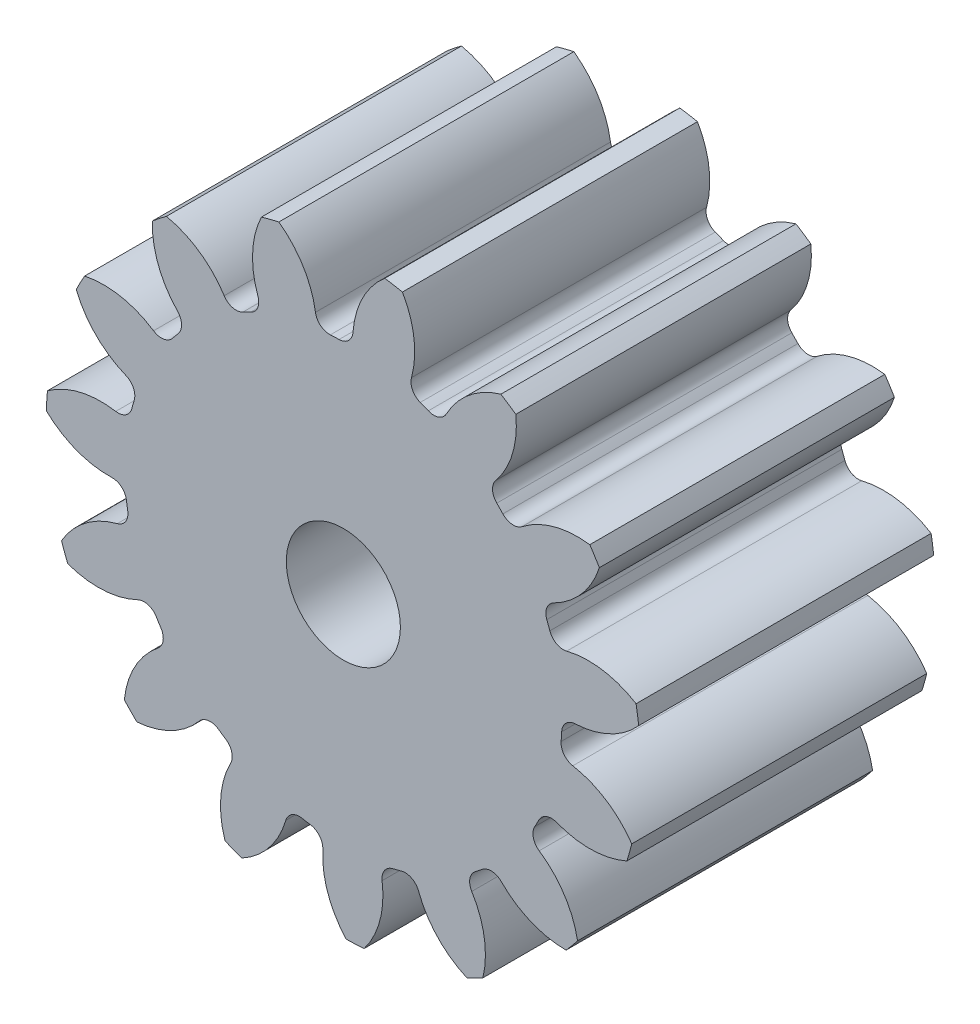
ISO-10303-21;
HEADER;
FILE_DESCRIPTION(('STEP AP214'),'2;1');
FILE_NAME('part.step','',(''),(''),'','','');
FILE_SCHEMA(('AUTOMOTIVE_DESIGN { 1 0 10303 214 1 1 1 1 }'));
ENDSEC;
DATA;
#1=APPLICATION_CONTEXT('core data for automotive mechanical design processes');
#2=APPLICATION_PROTOCOL_DEFINITION('international standard','automotive_design',2000,#1);
#3=PRODUCT_CONTEXT('',#1,'mechanical');
#4=PRODUCT('Part','Part','',(#3));
#5=PRODUCT_RELATED_PRODUCT_CATEGORY('part','',(#4));
#6=PRODUCT_DEFINITION_FORMATION('','',#4);
#7=PRODUCT_DEFINITION_CONTEXT('part definition',#1,'design');
#8=PRODUCT_DEFINITION('design','',#6,#7);
#9=PRODUCT_DEFINITION_SHAPE('','',#8);
#10=(LENGTH_UNIT() NAMED_UNIT(*) SI_UNIT(.MILLI.,.METRE.));
#11=(NAMED_UNIT(*) PLANE_ANGLE_UNIT() SI_UNIT($,.RADIAN.));
#12=(NAMED_UNIT(*) SI_UNIT($,.STERADIAN.) SOLID_ANGLE_UNIT());
#13=UNCERTAINTY_MEASURE_WITH_UNIT(LENGTH_MEASURE(1.E-05),#10,'distance_accuracy_value','');
#14=(GEOMETRIC_REPRESENTATION_CONTEXT(3) GLOBAL_UNCERTAINTY_ASSIGNED_CONTEXT((#13)) GLOBAL_UNIT_ASSIGNED_CONTEXT((#10,
#11,#12)) REPRESENTATION_CONTEXT('',''));
#15=CARTESIAN_POINT('',(0.,0.,0.));
#16=DIRECTION('',(0.,0.,1.));
#17=DIRECTION('',(1.,0.,0.));
#18=AXIS2_PLACEMENT_3D('',#15,#16,#17);
#19=CARTESIAN_POINT('',(0.,0.,95.25));
#20=DIRECTION('',(0.,0.,-1.));
#21=DIRECTION('',(-1.,0.,0.));
#22=AXIS2_PLACEMENT_3D('',#19,#20,#21);
#23=CYLINDRICAL_SURFACE('',#22,95.9555555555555);
#24=DIRECTION('',(0.,0.,-1.));
#25=VECTOR('',#24,1.);
#26=CARTESIAN_POINT('',(94.4995133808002,16.6526458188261,47.625));
#27=LINE('',#26,#25);
#28=CARTESIAN_POINT('',(94.4995133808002,16.6526458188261,95.25));
#29=VERTEX_POINT('',#28);
#30=CARTESIAN_POINT('',(94.4995133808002,16.6526458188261,0.));
#31=VERTEX_POINT('',#30);
#32=EDGE_CURVE('E636',#29,#31,#27,.T.);
#33=ORIENTED_EDGE('',*,*,#32,.F.);
#34=CARTESIAN_POINT('',(0.,0.,95.25));
#35=DIRECTION('',(0.,0.,1.));
#36=DIRECTION('',(1.,0.,0.));
#37=AXIS2_PLACEMENT_3D('',#34,#35,#36);
#38=CIRCLE('',#37,95.9555555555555);
#39=CARTESIAN_POINT('',(95.3319060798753,10.9222857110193,95.25));
#40=VERTEX_POINT('',#39);
#41=EDGE_CURVE('E1167',#40,#29,#38,.T.);
#42=ORIENTED_EDGE('',*,*,#41,.F.);
#43=DIRECTION('',(0.,0.,-1.));
#44=VECTOR('',#43,1.);
#45=CARTESIAN_POINT('',(95.3319060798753,10.9222857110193,47.625));
#46=LINE('',#45,#44);
#47=CARTESIAN_POINT('',(95.3319060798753,10.9222857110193,0.));
#48=VERTEX_POINT('',#47);
#49=EDGE_CURVE('E1161',#48,#40,#46,.F.);
#50=ORIENTED_EDGE('',*,*,#49,.F.);
#51=CARTESIAN_POINT('',(0.,0.,0.));
#52=DIRECTION('',(0.,0.,1.));
#53=DIRECTION('',(1.,0.,0.));
#54=AXIS2_PLACEMENT_3D('',#51,#52,#53);
#55=CIRCLE('',#54,95.9555555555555);
#56=EDGE_CURVE('E1172',#48,#31,#55,.T.);
#57=ORIENTED_EDGE('',*,*,#56,.T.);
#58=EDGE_LOOP('',(#33,#42,#50,#57));
#59=FACE_BOUND('',#58,.T.);
#60=ADVANCED_FACE('F33',(#59),#23,.T.);
#61=DIRECTION('',(0.,0.,-1.));
#62=VECTOR('',#61,1.);
#63=CARTESIAN_POINT('',(82.647535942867,48.7529839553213,47.625));
#64=LINE('',#63,#62);
#65=CARTESIAN_POINT('',(82.647535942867,48.7529839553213,0.));
#66=VERTEX_POINT('',#65);
#67=CARTESIAN_POINT('',(82.647535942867,48.7529839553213,95.25));
#68=VERTEX_POINT('',#67);
#69=EDGE_CURVE('E607',#66,#68,#64,.F.);
#70=ORIENTED_EDGE('',*,*,#69,.F.);
#71=CARTESIAN_POINT('',(79.5563599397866,53.649363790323,0.));
#72=VERTEX_POINT('',#71);
#73=EDGE_CURVE('E1175',#66,#72,#55,.T.);
#74=ORIENTED_EDGE('',*,*,#73,.T.);
#75=DIRECTION('',(0.,0.,-1.));
#76=VECTOR('',#75,1.);
#77=CARTESIAN_POINT('',(79.5563599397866,53.649363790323,47.625));
#78=LINE('',#77,#76);
#79=CARTESIAN_POINT('',(79.5563599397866,53.649363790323,95.25));
#80=VERTEX_POINT('',#79);
#81=EDGE_CURVE('E669',#80,#72,#78,.T.);
#82=ORIENTED_EDGE('',*,*,#81,.F.);
#83=EDGE_CURVE('E1170',#68,#80,#38,.T.);
#84=ORIENTED_EDGE('',*,*,#83,.F.);
#85=EDGE_LOOP('',(#70,#74,#82,#84));
#86=FACE_BOUND('',#85,.T.);
#87=ADVANCED_FACE('F1346',(#86),#23,.T.);
#88=CARTESIAN_POINT('',(0.,0.,95.25));
#89=DIRECTION('',(0.,0.,1.));
#90=DIRECTION('',(1.,0.,0.));
#91=AXIS2_PLACEMENT_3D('',#88,#89,#90);
#92=PLANE('',#91);
#93=CARTESIAN_POINT('',(0.,0.,95.2500000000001));
#94=DIRECTION('',(0.,0.,1.));
#95=DIRECTION('',(1.,0.,0.));
#96=AXIS2_PLACEMENT_3D('',#93,#94,#95);
#97=CIRCLE('',#96,18.415);
#98=CARTESIAN_POINT('',(18.415,0.,95.2499999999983));
#99=VERTEX_POINT('',#98);
#100=EDGE_CURVE('E624',#99,#99,#97,.T.);
#101=ORIENTED_EDGE('',*,*,#100,.F.);
#102=EDGE_LOOP('',(#101));
#103=FACE_BOUND('',#102,.T.);
#104=ORIENTED_EDGE('',*,*,#41,.T.);
#105=CARTESIAN_POINT('',(79.1291389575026,-8.27496865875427,95.25));
#106=DIRECTION('',(0.,0.,-1.));
#107=DIRECTION('',(0.913545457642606,0.406736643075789,0.));
#108=AXIS2_PLACEMENT_3D('',#105,#106,#107);
#109=CIRCLE('',#108,29.2853952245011);
#110=CARTESIAN_POINT('',(72.105950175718,20.1558103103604,95.25));
#111=VERTEX_POINT('',#110);
#112=EDGE_CURVE('E616',#111,#29,#109,.T.);
#113=ORIENTED_EDGE('',*,*,#112,.F.);
#114=CARTESIAN_POINT('',(71.0040839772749,24.616307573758,95.25));
#115=DIRECTION('',(0.,0.,1.));
#116=DIRECTION('',(-0.913545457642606,-0.406736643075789,0.));
#117=AXIS2_PLACEMENT_3D('',#114,#115,#116);
#118=CIRCLE('',#117,4.59457777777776);
#119=CARTESIAN_POINT('',(66.6629900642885,23.1112997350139,95.25));
#120=VERTEX_POINT('',#119);
#121=EDGE_CURVE('E614',#120,#111,#118,.T.);
#122=ORIENTED_EDGE('',*,*,#121,.F.);
#123=CARTESIAN_POINT('',(0.,0.,95.25));
#124=DIRECTION('',(0.,0.,-1.));
#125=DIRECTION('',(0.913545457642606,0.406736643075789,0.));
#126=AXIS2_PLACEMENT_3D('',#123,#124,#125);
#127=CIRCLE('',#126,70.5555555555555);
#128=CARTESIAN_POINT('',(65.6870634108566,25.754535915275,95.25));
#129=VERTEX_POINT('',#128);
#130=EDGE_CURVE('E599',#129,#120,#127,.T.);
#131=ORIENTED_EDGE('',*,*,#130,.F.);
#132=CARTESIAN_POINT('',(69.9646049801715,27.4316712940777,95.25));
#133=DIRECTION('',(0.,0.,1.));
#134=DIRECTION('',(-0.913545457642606,-0.406736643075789,0.));
#135=AXIS2_PLACEMENT_3D('',#132,#133,#134);
#136=CIRCLE('',#135,4.59457777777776);
#137=CARTESIAN_POINT('',(67.9034615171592,31.5379874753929,95.25));
#138=VERTEX_POINT('',#137);
#139=EDGE_CURVE('E591',#138,#129,#136,.T.);
#140=ORIENTED_EDGE('',*,*,#139,.F.);
#141=CARTESIAN_POINT('',(54.7659320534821,57.7112504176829,95.25));
#142=DIRECTION('',(0.,0.,-1.));
#143=DIRECTION('',(-0.913545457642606,-0.406736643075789,0.));
#144=AXIS2_PLACEMENT_3D('',#141,#142,#143);
#145=CIRCLE('',#144,29.2853952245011);
#146=EDGE_CURVE('E621',#68,#138,#145,.T.);
#147=ORIENTED_EDGE('',*,*,#146,.F.);
#148=ORIENTED_EDGE('',*,*,#83,.T.);
#149=CARTESIAN_POINT('',(75.6537984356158,24.6251603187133,95.25));
#150=DIRECTION('',(0.,0.,-1.));
#151=DIRECTION('',(0.669130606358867,0.743144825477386,0.));
#152=AXIS2_PLACEMENT_3D('',#149,#150,#151);
#153=CIRCLE('',#152,29.2853952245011);
#154=CARTESIAN_POINT('',(57.6739566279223,47.7413810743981,95.25));
#155=VERTEX_POINT('',#154);
#156=EDGE_CURVE('E645',#155,#80,#153,.T.);
#157=ORIENTED_EDGE('',*,*,#156,.F.);
#158=CARTESIAN_POINT('',(54.8531040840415,51.3680787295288,95.25));
#159=DIRECTION('',(0.,0.,1.));
#160=DIRECTION('',(-0.669130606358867,-0.743144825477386,0.));
#161=AXIS2_PLACEMENT_3D('',#158,#159,#160);
#162=CIRCLE('',#161,4.59457777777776);
#163=CARTESIAN_POINT('',(51.4994592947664,48.2275036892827,95.25));
#164=VERTEX_POINT('',#163);
#165=EDGE_CURVE('E643',#164,#155,#162,.T.);
#166=ORIENTED_EDGE('',*,*,#165,.F.);
#167=CARTESIAN_POINT('',(0.,0.,95.25));
#168=DIRECTION('',(0.,0.,-1.));
#169=DIRECTION('',(0.669130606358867,0.743144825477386,0.));
#170=AXIS2_PLACEMENT_3D('',#167,#168,#169);
#171=CIRCLE('',#170,70.5555555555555);
#172=CARTESIAN_POINT('',(49.5328049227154,50.2452749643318,95.25));
#173=VERTEX_POINT('',#172);
#174=EDGE_CURVE('E640',#173,#164,#171,.T.);
#175=ORIENTED_EDGE('',*,*,#174,.F.);
#176=CARTESIAN_POINT('',(52.7583811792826,53.517247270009,95.25));
#177=DIRECTION('',(0.,0.,1.));
#178=DIRECTION('',(-0.669130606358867,-0.743144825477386,0.));
#179=AXIS2_PLACEMENT_3D('',#176,#177,#178);
#180=CIRCLE('',#179,4.59457777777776);
#181=CARTESIAN_POINT('',(49.205243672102,56.4302111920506,95.25));
#182=VERTEX_POINT('',#181);
#183=EDGE_CURVE('E638',#182,#173,#180,.T.);
#184=ORIENTED_EDGE('',*,*,#183,.F.);
#185=CARTESIAN_POINT('',(26.5578881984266,74.9971620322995,95.25));
#186=DIRECTION('',(0.,0.,-1.));
#187=DIRECTION('',(-0.669130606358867,-0.743144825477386,0.));
#188=AXIS2_PLACEMENT_3D('',#185,#186,#187);
#189=CIRCLE('',#188,29.2853952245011);
#190=CARTESIAN_POINT('',(55.6726560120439,78.1538483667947,95.25));
#191=VERTEX_POINT('',#190);
#192=EDGE_CURVE('E648',#191,#182,#189,.T.);
#193=ORIENTED_EDGE('',*,*,#192,.F.);
#194=CARTESIAN_POINT('',(50.8571891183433,81.3696193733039,95.25));
#195=VERTEX_POINT('',#194);
#196=EDGE_CURVE('E1213',#191,#195,#38,.T.);
#197=ORIENTED_EDGE('',*,*,#196,.T.);
#198=CARTESIAN_POINT('',(59.0972288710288,53.2673753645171,95.25));
#199=DIRECTION('',(0.,0.,-1.));
#200=DIRECTION('',(0.309016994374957,0.95105651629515,0.));
#201=AXIS2_PLACEMENT_3D('',#198,#199,#200);
#202=CIRCLE('',#201,29.2853952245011);
#203=CARTESIAN_POINT('',(33.2696120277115,67.0720333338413,95.25));
#204=VERTEX_POINT('',#203);
#205=EDGE_CURVE('E680',#204,#195,#202,.T.);
#206=ORIENTED_EDGE('',*,*,#205,.F.);
#207=CARTESIAN_POINT('',(29.2175241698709,69.2378424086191,95.25));
#208=DIRECTION('',(0.,0.,1.));
#209=DIRECTION('',(-0.309016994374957,-0.95105651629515,0.));
#210=AXIS2_PLACEMENT_3D('',#207,#208,#209);
#211=CIRCLE('',#210,4.59457777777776);
#212=CARTESIAN_POINT('',(27.4312041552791,65.0047341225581,95.25));
#213=VERTEX_POINT('',#212);
#214=EDGE_CURVE('E678',#213,#204,#211,.T.);
#215=ORIENTED_EDGE('',*,*,#214,.F.);
#216=CARTESIAN_POINT('',(0.,0.,95.25));
#217=DIRECTION('',(0.,0.,-1.));
#218=DIRECTION('',(0.309016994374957,0.95105651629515,0.));
#219=AXIS2_PLACEMENT_3D('',#216,#217,#218);
#220=CIRCLE('',#219,70.5555555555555);
#221=CARTESIAN_POINT('',(24.8138744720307,66.0481495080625,95.25));
#222=VERTEX_POINT('',#221);
#223=EDGE_CURVE('E675',#222,#213,#220,.T.);
#224=ORIENTED_EDGE('',*,*,#223,.F.);
#225=CARTESIAN_POINT('',(26.4297539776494,70.3492050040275,95.25));
#226=DIRECTION('',(0.,0.,1.));
#227=DIRECTION('',(-0.309016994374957,-0.95105651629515,0.));
#228=AXIS2_PLACEMENT_3D('',#225,#226,#227);
#229=CIRCLE('',#228,4.59457777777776);
#230=CARTESIAN_POINT('',(21.9989921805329,71.565138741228,95.25));
#231=VERTEX_POINT('',#230);
#232=EDGE_CURVE('E673',#231,#222,#229,.T.);
#233=ORIENTED_EDGE('',*,*,#232,.F.);
#234=CARTESIAN_POINT('',(-6.24225579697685,79.3153830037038,95.25));
#235=DIRECTION('',(0.,0.,-1.));
#236=DIRECTION('',(-0.309016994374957,-0.95105651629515,0.));
#237=AXIS2_PLACEMENT_3D('',#234,#235,#236);
#238=CIRCLE('',#237,29.2853952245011);
#239=CARTESIAN_POINT('',(19.0714680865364,94.0412023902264,95.25));
#240=VERTEX_POINT('',#239);
#241=EDGE_CURVE('E683',#240,#231,#238,.T.);
#242=ORIENTED_EDGE('',*,*,#241,.F.);
#243=CARTESIAN_POINT('',(13.36434827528,95.0203285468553,95.25));
#244=VERTEX_POINT('',#243);
#245=EDGE_CURVE('E1328',#240,#244,#38,.T.);
#246=ORIENTED_EDGE('',*,*,#245,.T.);
#247=CARTESIAN_POINT('',(32.3222115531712,72.6991772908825,95.25));
#248=DIRECTION('',(0.,0.,-1.));
#249=DIRECTION('',(-0.104528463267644,0.994521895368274,0.));
#250=AXIS2_PLACEMENT_3D('',#247,#248,#249);
#251=CIRCLE('',#250,29.2853952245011);
#252=CARTESIAN_POINT('',(3.11264926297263,74.8053216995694,95.25));
#253=VERTEX_POINT('',#252);
#254=EDGE_CURVE('E718',#253,#244,#251,.T.);
#255=ORIENTED_EDGE('',*,*,#254,.F.);
#256=CARTESIAN_POINT('',(-1.47003110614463,75.1357541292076,95.25));
#257=DIRECTION('',(0.,0.,1.));
#258=DIRECTION('',(0.104528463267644,-0.994521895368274,0.));
#259=AXIS2_PLACEMENT_3D('',#256,#257,#258);
#260=CIRCLE('',#259,4.59457777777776);
#261=CARTESIAN_POINT('',(-1.38015538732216,70.5420554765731,95.25));
#262=VERTEX_POINT('',#261);
#263=EDGE_CURVE('E716',#262,#253,#260,.T.);
#264=ORIENTED_EDGE('',*,*,#263,.F.);
#265=CARTESIAN_POINT('',(0.,0.,95.25));
#266=DIRECTION('',(0.,0.,-1.));
#267=DIRECTION('',(-0.104528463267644,0.994521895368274,0.));
#268=AXIS2_PLACEMENT_3D('',#265,#266,#267);
#269=CIRCLE('',#268,70.5555555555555);
#270=CARTESIAN_POINT('',(-4.19560030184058,70.430698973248,95.25));
#271=VERTEX_POINT('',#270);
#272=EDGE_CURVE('E713',#271,#262,#269,.T.);
#273=ORIENTED_EDGE('',*,*,#272,.F.);
#274=CARTESIAN_POINT('',(-4.46881779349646,75.0171460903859,95.25));
#275=DIRECTION('',(0.,0.,1.));
#276=DIRECTION('',(0.104528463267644,-0.994521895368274,0.));
#277=AXIS2_PLACEMENT_3D('',#274,#275,#276);
#278=CIRCLE('',#277,4.59457777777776);
#279=CARTESIAN_POINT('',(-9.01108491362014,74.3258036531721,95.25));
#280=VERTEX_POINT('',#279);
#281=EDGE_CURVE('E711',#280,#271,#278,.T.);
#282=ORIENTED_EDGE('',*,*,#281,.F.);
#283=CARTESIAN_POINT('',(-37.9630570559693,69.9192536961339,95.25));
#284=DIRECTION('',(0.,0.,-1.));
#285=DIRECTION('',(0.104528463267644,-0.994521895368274,0.));
#286=AXIS2_PLACEMENT_3D('',#283,#284,#285);
#287=CIRCLE('',#286,29.2853952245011);
#288=CARTESIAN_POINT('',(-20.8273499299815,93.6679781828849,95.25));
#289=VERTEX_POINT('',#288);
#290=EDGE_CURVE('E721',#289,#280,#287,.T.);
#291=ORIENTED_EDGE('',*,*,#290,.F.);
#292=CARTESIAN_POINT('',(-26.4393097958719,92.2411596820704,95.25));
#293=VERTEX_POINT('',#292);
#294=EDGE_CURVE('E1324',#289,#293,#38,.T.);
#295=ORIENTED_EDGE('',*,*,#294,.T.);
#296=CARTESIAN_POINT('',(-0.0416097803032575,79.5606310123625,95.25));
#297=DIRECTION('',(0.,0.,-1.));
#298=DIRECTION('',(-0.499999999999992,0.866025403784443,0.));
#299=AXIS2_PLACEMENT_3D('',#296,#297,#298);
#300=CIRCLE('',#299,29.2853952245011);
#301=CARTESIAN_POINT('',(-27.582518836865,69.604090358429,95.25));
#302=VERTEX_POINT('',#301);
#303=EDGE_CURVE('E756',#302,#293,#300,.T.);
#304=ORIENTED_EDGE('',*,*,#303,.F.);
#305=CARTESIAN_POINT('',(-31.9034046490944,68.0420113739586,95.25));
#306=DIRECTION('',(0.,0.,1.));
#307=DIRECTION('',(0.499999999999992,-0.866025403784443,0.));
#308=AXIS2_PLACEMENT_3D('',#305,#306,#307);
#309=CIRCLE('',#308,4.59457777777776);
#310=CARTESIAN_POINT('',(-29.9528735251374,63.8820145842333,95.25));
#311=VERTEX_POINT('',#310);
#312=EDGE_CURVE('E754',#311,#302,#309,.T.);
#313=ORIENTED_EDGE('',*,*,#312,.F.);
#314=CARTESIAN_POINT('',(0.,0.,95.25));
#315=DIRECTION('',(0.,0.,-1.));
#316=DIRECTION('',(-0.499999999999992,0.866025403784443,0.));
#317=AXIS2_PLACEMENT_3D('',#314,#315,#316);
#318=CIRCLE('',#317,70.5555555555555);
#319=CARTESIAN_POINT('',(-32.4796176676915,62.6351407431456,95.25));
#320=VERTEX_POINT('',#319);
#321=EDGE_CURVE('E751',#320,#311,#318,.T.);
#322=ORIENTED_EDGE('',*,*,#321,.F.);
#323=CARTESIAN_POINT('',(-34.5946903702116,66.7139411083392,95.25));
#324=DIRECTION('',(0.,0.,1.));
#325=DIRECTION('',(0.499999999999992,-0.866025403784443,0.));
#326=AXIS2_PLACEMENT_3D('',#323,#324,#325);
#327=CIRCLE('',#326,4.59457777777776);
#328=CARTESIAN_POINT('',(-38.4630635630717,64.2348618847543,95.25));
#329=VERTEX_POINT('',#328);
#330=EDGE_CURVE('E749',#329,#320,#327,.T.);
#331=ORIENTED_EDGE('',*,*,#330,.F.);
#332=CARTESIAN_POINT('',(-63.1197008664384,48.4334502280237,95.25));
#333=DIRECTION('',(0.,0.,-1.));
#334=DIRECTION('',(0.499999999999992,-0.866025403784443,0.));
#335=AXIS2_PLACEMENT_3D('',#332,#333,#334);
#336=CIRCLE('',#335,29.2853952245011);
#337=CARTESIAN_POINT('',(-57.1249299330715,77.098709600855,95.25));
#338=VERTEX_POINT('',#337);
#339=EDGE_CURVE('E759',#338,#329,#336,.T.);
#340=ORIENTED_EDGE('',*,*,#339,.F.);
#341=CARTESIAN_POINT('',(-61.6713710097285,73.5126563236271,95.25));
#342=VERTEX_POINT('',#341);
#343=EDGE_CURVE('E1320',#338,#342,#38,.T.);
#344=ORIENTED_EDGE('',*,*,#343,.T.);
#345=CARTESIAN_POINT('',(-32.3982364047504,72.6653288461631,95.25));
#346=DIRECTION('',(0.,0.,-1.));
#347=DIRECTION('',(-0.809016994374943,0.58778525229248,0.));
#348=AXIS2_PLACEMENT_3D('',#345,#346,#347);
#349=CIRCLE('',#348,29.2853952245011);
#350=CARTESIAN_POINT('',(-53.5084188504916,52.3676794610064,95.25));
#351=VERTEX_POINT('',#350);
#352=EDGE_CURVE('E794',#351,#342,#349,.T.);
#353=ORIENTED_EDGE('',*,*,#352,.F.);
#354=CARTESIAN_POINT('',(-56.8203896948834,49.1831867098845,95.25));
#355=DIRECTION('',(0.,0.,1.));
#356=DIRECTION('',(0.809016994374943,-0.58778525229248,0.));
#357=AXIS2_PLACEMENT_3D('',#354,#355,#356);
#358=CIRCLE('',#357,4.59457777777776);
#359=CARTESIAN_POINT('',(-53.346467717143,46.1761930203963,95.25));
#360=VERTEX_POINT('',#359);
#361=EDGE_CURVE('E792',#360,#351,#358,.T.);
#362=ORIENTED_EDGE('',*,*,#361,.F.);
#363=CARTESIAN_POINT('',(0.,0.,95.25));
#364=DIRECTION('',(0.,0.,-1.));
#365=DIRECTION('',(-0.809016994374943,0.58778525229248,0.));
#366=AXIS2_PLACEMENT_3D('',#363,#364,#365);
#367=CIRCLE('',#366,70.5555555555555);
#368=CARTESIAN_POINT('',(-55.1476140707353,44.0093976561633,95.25));
#369=VERTEX_POINT('',#368);
#370=EDGE_CURVE('E789',#369,#360,#367,.T.);
#371=ORIENTED_EDGE('',*,*,#370,.F.);
#372=CARTESIAN_POINT('',(-58.7388266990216,46.8752896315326,95.25));
#373=DIRECTION('',(0.,0.,1.));
#374=DIRECTION('',(0.809016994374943,-0.58778525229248,0.));
#375=AXIS2_PLACEMENT_3D('',#372,#373,#374);
#376=CIRCLE('',#375,4.59457777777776);
#377=CARTESIAN_POINT('',(-61.2644290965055,43.0371289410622,95.25));
#378=VERTEX_POINT('',#377);
#379=EDGE_CURVE('E787',#378,#369,#376,.T.);
#380=ORIENTED_EDGE('',*,*,#379,.F.);
#381=CARTESIAN_POINT('',(-77.3623749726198,18.5730632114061,95.25));
#382=DIRECTION('',(0.,0.,-1.));
#383=DIRECTION('',(0.809016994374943,-0.58778525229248,0.));
#384=AXIS2_PLACEMENT_3D('',#381,#382,#383);
#385=CIRCLE('',#384,29.2853952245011);
#386=CARTESIAN_POINT('',(-83.5450905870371,47.1983737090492,95.25));
#387=VERTEX_POINT('',#386);
#388=EDGE_CURVE('E797',#387,#378,#385,.T.);
#389=ORIENTED_EDGE('',*,*,#388,.F.);
#390=CARTESIAN_POINT('',(-86.2398919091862,42.0731468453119,95.25));
#391=VERTEX_POINT('',#390);
#392=EDGE_CURVE('E1316',#387,#391,#38,.T.);
#393=ORIENTED_EDGE('',*,*,#392,.T.);
#394=CARTESIAN_POINT('',(-59.1529136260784,53.2055311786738,95.25));
#395=DIRECTION('',(0.,0.,-1.));
#396=DIRECTION('',(-0.978147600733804,0.207911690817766,0.));
#397=AXIS2_PLACEMENT_3D('',#394,#395,#396);
#398=CIRCLE('',#397,29.2853952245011);
#399=CARTESIAN_POINT('',(-70.1822271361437,26.0764210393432,95.25));
#400=VERTEX_POINT('',#399);
#401=EDGE_CURVE('E832',#400,#391,#398,.T.);
#402=ORIENTED_EDGE('',*,*,#401,.F.);
#403=CARTESIAN_POINT('',(-71.9126131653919,21.8201422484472,95.25));
#404=DIRECTION('',(0.,0.,1.));
#405=DIRECTION('',(0.978147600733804,-0.207911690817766,0.));
#406=AXIS2_PLACEMENT_3D('',#403,#404,#405);
#407=CIRCLE('',#406,4.59457777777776);
#408=CARTESIAN_POINT('',(-67.5159730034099,20.4860881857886,95.25));
#409=VERTEX_POINT('',#408);
#410=EDGE_CURVE('E830',#409,#400,#407,.T.);
#411=ORIENTED_EDGE('',*,*,#410,.F.);
#412=CARTESIAN_POINT('',(0.,0.,95.25));
#413=DIRECTION('',(0.,0.,-1.));
#414=DIRECTION('',(-0.978147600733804,0.207911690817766,0.));
#415=AXIS2_PLACEMENT_3D('',#412,#413,#414);
#416=CIRCLE('',#415,70.5555555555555);
#417=CARTESIAN_POINT('',(-68.2800870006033,17.7740299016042,95.25));
#418=VERTEX_POINT('',#417);
#419=EDGE_CURVE('E827',#418,#409,#416,.T.);
#420=ORIENTED_EDGE('',*,*,#419,.F.);
#421=CARTESIAN_POINT('',(-72.7264862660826,18.9314747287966,95.25));
#422=DIRECTION('',(0.,0.,1.));
#423=DIRECTION('',(0.978147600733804,-0.207911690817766,0.));
#424=AXIS2_PLACEMENT_3D('',#421,#422,#423);
#425=CIRCLE('',#424,4.59457777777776);
#426=CARTESIAN_POINT('',(-73.4726182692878,14.3978854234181,95.25));
#427=VERTEX_POINT('',#426);
#428=EDGE_CURVE('E825',#427,#418,#425,.T.);
#429=ORIENTED_EDGE('',*,*,#428,.F.);
#430=CARTESIAN_POINT('',(-78.2283916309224,-14.4987751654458,95.25));
#431=DIRECTION('',(0.,0.,-1.));
#432=DIRECTION('',(0.978147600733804,-0.207911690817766,0.));
#433=AXIS2_PLACEMENT_3D('',#430,#431,#432);
#434=CIRCLE('',#433,29.2853952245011);
#435=CARTESIAN_POINT('',(-95.5195460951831,9.1370102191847,95.25));
#436=VERTEX_POINT('',#435);
#437=EDGE_CURVE('E835',#436,#427,#434,.T.);
#438=ORIENTED_EDGE('',*,*,#437,.F.);
#439=CARTESIAN_POINT('',(-95.8967520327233,3.35880805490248,95.25));
#440=VERTEX_POINT('',#439);
#441=EDGE_CURVE('E1312',#436,#440,#38,.T.);
#442=ORIENTED_EDGE('',*,*,#441,.T.);
#443=CARTESIAN_POINT('',(-75.6795146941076,24.5460138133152,95.25));
#444=DIRECTION('',(0.,0.,-1.));
#445=DIRECTION('',(-0.978147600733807,-0.207911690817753,0.));
#446=AXIS2_PLACEMENT_3D('',#443,#444,#445);
#447=CIRCLE('',#446,29.2853952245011);
#448=CARTESIAN_POINT('',(-74.7208907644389,-4.72368747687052,95.25));
#449=VERTEX_POINT('',#448);
#450=EDGE_CURVE('E870',#449,#440,#447,.T.);
#451=ORIENTED_EDGE('',*,*,#450,.F.);
#452=CARTESIAN_POINT('',(-74.5704925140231,-9.31580303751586,95.25));
#453=DIRECTION('',(0.,0.,1.));
#454=DIRECTION('',(0.978147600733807,0.207911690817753,0.));
#455=AXIS2_PLACEMENT_3D('',#452,#453,#454);
#456=CIRCLE('',#455,4.59457777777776);
#457=CARTESIAN_POINT('',(-70.011353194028,-8.74624740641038,95.25));
#458=VERTEX_POINT('',#457);
#459=EDGE_CURVE('E868',#458,#449,#456,.T.);
#460=ORIENTED_EDGE('',*,*,#459,.F.);
#461=CARTESIAN_POINT('',(0.,0.,95.25));
#462=DIRECTION('',(0.,0.,-1.));
#463=DIRECTION('',(-0.978147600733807,-0.207911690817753,0.));
#464=AXIS2_PLACEMENT_3D('',#461,#462,#463);
#465=CIRCLE('',#464,70.5555555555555);
#466=CARTESIAN_POINT('',(-69.6063125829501,-11.5346290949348,95.25));
#467=VERTEX_POINT('',#466);
#468=EDGE_CURVE('E865',#467,#458,#465,.T.);
#469=ORIENTED_EDGE('',*,*,#468,.F.);
#470=CARTESIAN_POINT('',(-74.1390756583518,-12.2857641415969,95.25));
#471=DIRECTION('',(0.,0.,1.));
#472=DIRECTION('',(0.978147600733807,0.207911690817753,0.));
#473=AXIS2_PLACEMENT_3D('',#470,#471,#472);
#474=CIRCLE('',#473,4.59457777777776);
#475=CARTESIAN_POINT('',(-72.9767242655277,-16.7308832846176,95.25));
#476=VERTEX_POINT('',#475);
#477=EDGE_CURVE('E863',#476,#467,#474,.T.);
#478=ORIENTED_EDGE('',*,*,#477,.F.);
#479=CARTESIAN_POINT('',(-65.5680086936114,-45.0636435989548,95.25));
#480=DIRECTION('',(0.,0.,-1.));
#481=DIRECTION('',(0.978147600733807,0.207911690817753,0.));
#482=AXIS2_PLACEMENT_3D('',#479,#480,#481);
#483=CIRCLE('',#482,29.2853952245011);
#484=CARTESIAN_POINT('',(-90.977804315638,-30.5042253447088,95.25));
#485=VERTEX_POINT('',#484);
#486=EDGE_CURVE('E873',#485,#476,#483,.T.);
#487=ORIENTED_EDGE('',*,*,#486,.F.);
#488=CARTESIAN_POINT('',(-88.9721925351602,-35.9362991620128,95.25));
#489=VERTEX_POINT('',#488);
#490=EDGE_CURVE('E1308',#485,#489,#38,.T.);
#491=ORIENTED_EDGE('',*,*,#490,.T.);
#492=CARTESIAN_POINT('',(-79.1204401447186,-8.35773233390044,95.25));
#493=DIRECTION('',(0.,0.,-1.));
#494=DIRECTION('',(-0.80901699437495,-0.587785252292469,0.));
#495=AXIS2_PLACEMENT_3D('',#492,#493,#494);
#496=CIRCLE('',#495,29.2853952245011);
#497=CARTESIAN_POINT('',(-66.3396335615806,-34.7070275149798,95.25));
#498=VERTEX_POINT('',#497);
#499=EDGE_CURVE('E908',#498,#489,#496,.T.);
#500=ORIENTED_EDGE('',*,*,#499,.F.);
#501=CARTESIAN_POINT('',(-64.3344562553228,-38.8409613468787,95.25));
#502=DIRECTION('',(0.,0.,1.));
#503=DIRECTION('',(0.80901699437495,0.587785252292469,0.));
#504=AXIS2_PLACEMENT_3D('',#501,#502,#503);
#505=CIRCLE('',#504,4.59457777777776);
#506=CARTESIAN_POINT('',(-60.4011343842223,-36.4662773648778,95.25));
#507=VERTEX_POINT('',#506);
#508=EDGE_CURVE('E906',#507,#498,#505,.T.);
#509=ORIENTED_EDGE('',*,*,#508,.F.);
#510=CARTESIAN_POINT('',(0.,0.,95.25));
#511=DIRECTION('',(0.,0.,-1.));
#512=DIRECTION('',(-0.80901699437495,-0.587785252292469,0.));
#513=AXIS2_PLACEMENT_3D('',#510,#511,#512);
#514=CIRCLE('',#513,70.5555555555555);
#515=CARTESIAN_POINT('',(-58.8969743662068,-38.8488459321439,95.25));
#516=VERTEX_POINT('',#515);
#517=EDGE_CURVE('E903',#516,#507,#514,.T.);
#518=ORIENTED_EDGE('',*,*,#517,.F.);
#519=CARTESIAN_POINT('',(-62.7323453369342,-41.3786827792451,95.25));
#520=DIRECTION('',(0.,0.,1.));
#521=DIRECTION('',(0.80901699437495,0.587785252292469,0.));
#522=AXIS2_PLACEMENT_3D('',#519,#520,#521);
#523=CIRCLE('',#522,4.59457777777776);
#524=CARTESIAN_POINT('',(-59.862491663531,-44.9667302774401,95.25));
#525=VERTEX_POINT('',#524);
#526=EDGE_CURVE('E901',#525,#516,#523,.T.);
#527=ORIENTED_EDGE('',*,*,#526,.F.);
#528=CARTESIAN_POINT('',(-41.570321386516,-67.8365986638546,95.25));
#529=DIRECTION('',(0.,0.,-1.));
#530=DIRECTION('',(0.80901699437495,0.587785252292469,0.));
#531=AXIS2_PLACEMENT_3D('',#528,#529,#530);
#532=CIRCLE('',#531,29.2853952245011);
#533=CARTESIAN_POINT('',(-70.7051736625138,-64.8710032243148,95.25));
#534=VERTEX_POINT('',#533);
#535=EDGE_CURVE('E911',#534,#525,#532,.T.);
#536=ORIENTED_EDGE('',*,*,#535,.F.);
#537=CARTESIAN_POINT('',(-66.6635326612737,-69.0176937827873,95.25));
#538=VERTEX_POINT('',#537);
#539=EDGE_CURVE('E1304',#534,#538,#38,.T.);
#540=ORIENTED_EDGE('',*,*,#539,.T.);
#541=CARTESIAN_POINT('',(-68.8807227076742,-39.8163506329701,95.25));
#542=DIRECTION('',(0.,0.,-1.));
#543=DIRECTION('',(-0.500000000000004,-0.866025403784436,0.));
#544=AXIS2_PLACEMENT_3D('',#541,#542,#543);
#545=CIRCLE('',#544,29.2853952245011);
#546=CARTESIAN_POINT('',(-46.4876510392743,-58.6892071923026,95.25));
#547=VERTEX_POINT('',#546);
#548=EDGE_CURVE('E946',#547,#538,#545,.T.);
#549=ORIENTED_EDGE('',*,*,#548,.F.);
#550=CARTESIAN_POINT('',(-42.9744080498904,-61.6501645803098,95.25));
#551=DIRECTION('',(0.,0.,1.));
#552=DIRECTION('',(0.500000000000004,0.866025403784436,0.));
#553=AXIS2_PLACEMENT_3D('',#550,#551,#552);
#554=CIRCLE('',#553,4.59457777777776);
#555=CARTESIAN_POINT('',(-40.3470107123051,-57.8809566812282,95.25));
#556=VERTEX_POINT('',#555);
#557=EDGE_CURVE('E944',#556,#547,#554,.T.);
#558=ORIENTED_EDGE('',*,*,#557,.F.);
#559=CARTESIAN_POINT('',(0.,0.,95.25));
#560=DIRECTION('',(0.,0.,-1.));
#561=DIRECTION('',(-0.500000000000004,-0.866025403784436,0.));
#562=AXIS2_PLACEMENT_3D('',#559,#560,#561);
#563=CIRCLE('',#562,70.5555555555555);
#564=CARTESIAN_POINT('',(-38.0038142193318,-59.4457443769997,95.25));
#565=VERTEX_POINT('',#564);
#566=EDGE_CURVE('E941',#565,#556,#563,.T.);
#567=ORIENTED_EDGE('',*,*,#566,.F.);
#568=CARTESIAN_POINT('',(-40.4786226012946,-63.3168512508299,95.25));
#569=DIRECTION('',(0.,0.,1.));
#570=DIRECTION('',(0.500000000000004,0.866025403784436,0.));
#571=AXIS2_PLACEMENT_3D('',#568,#569,#570);
#572=CIRCLE('',#571,4.59457777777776);
#573=CARTESIAN_POINT('',(-36.3974904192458,-65.4274210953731,95.25));
#574=VERTEX_POINT('',#573);
#575=EDGE_CURVE('E939',#574,#565,#572,.T.);
#576=ORIENTED_EDGE('',*,*,#575,.F.);
#577=CARTESIAN_POINT('',(-10.3847478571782,-78.8799895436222,95.25));
#578=DIRECTION('',(0.,0.,-1.));
#579=DIRECTION('',(0.500000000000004,0.866025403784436,0.));
#580=AXIS2_PLACEMENT_3D('',#577,#578,#579);
#581=CIRCLE('',#580,29.2853952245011);
#582=CARTESIAN_POINT('',(-38.2069761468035,-88.0209953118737,95.25));
#583=VERTEX_POINT('',#582);
#584=EDGE_CURVE('E949',#583,#574,#581,.T.);
#585=ORIENTED_EDGE('',*,*,#584,.F.);
#586=CARTESIAN_POINT('',(-32.8281423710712,-90.1653021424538,95.25));
#587=VERTEX_POINT('',#586);
#588=EDGE_CURVE('E1300',#583,#587,#38,.T.);
#589=ORIENTED_EDGE('',*,*,#588,.T.);
#590=CARTESIAN_POINT('',(-46.730902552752,-64.3903601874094,95.25));
#591=DIRECTION('',(0.,0.,-1.));
#592=DIRECTION('',(-0.104528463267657,-0.994521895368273,0.));
#593=AXIS2_PLACEMENT_3D('',#590,#591,#592);
#594=CIRCLE('',#593,29.2853952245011);
#595=CARTESIAN_POINT('',(-18.597531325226,-72.5234897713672,95.25));
#596=VERTEX_POINT('',#595);
#597=EDGE_CURVE('E984',#596,#587,#594,.T.);
#598=ORIENTED_EDGE('',*,*,#597,.F.);
#599=CARTESIAN_POINT('',(-14.1836942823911,-73.7994942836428,95.25));
#600=DIRECTION('',(0.,0.,1.));
#601=DIRECTION('',(0.104528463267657,0.994521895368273,0.));
#602=AXIS2_PLACEMENT_3D('',#599,#600,#601);
#603=CIRCLE('',#602,4.59457777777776);
#604=CARTESIAN_POINT('',(-13.3165223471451,-69.2874927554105,95.25));
#605=VERTEX_POINT('',#604);
#606=EDGE_CURVE('E982',#605,#596,#603,.T.);
#607=ORIENTED_EDGE('',*,*,#606,.F.);
#608=CARTESIAN_POINT('',(0.,0.,95.25));
#609=DIRECTION('',(0.,0.,-1.));
#610=DIRECTION('',(-0.104528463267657,-0.994521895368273,0.));
#611=AXIS2_PLACEMENT_3D('',#608,#609,#610);
#612=CIRCLE('',#611,70.5555555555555);
#613=CARTESIAN_POINT('',(-10.5394493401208,-69.7639335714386,95.25));
#614=VERTEX_POINT('',#613);
#615=EDGE_CURVE('E979',#614,#605,#612,.T.);
#616=ORIENTED_EDGE('',*,*,#615,.F.);
#617=CARTESIAN_POINT('',(-11.2257782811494,-74.3069609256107,95.25));
#618=DIRECTION('',(0.,0.,1.));
#619=DIRECTION('',(0.104528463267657,0.994521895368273,0.));
#620=AXIS2_PLACEMENT_3D('',#617,#618,#619);
#621=CIRCLE('',#620,4.59457777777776);
#622=CARTESIAN_POINT('',(-6.6390324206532,-74.5751164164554,95.25));
#623=VERTEX_POINT('',#622);
#624=EDGE_CURVE('E977',#623,#614,#621,.T.);
#625=ORIENTED_EDGE('',*,*,#624,.F.);
#626=CARTESIAN_POINT('',(22.5964429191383,-76.2843136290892,95.25));
#627=DIRECTION('',(0.,0.,-1.));
#628=DIRECTION('',(0.104528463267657,0.994521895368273,0.));
#629=AXIS2_PLACEMENT_3D('',#626,#627,#628);
#630=CIRCLE('',#629,29.2853952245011);
#631=CARTESIAN_POINT('',(0.897554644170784,-95.9513576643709,95.25));
#632=VERTEX_POINT('',#631);
#633=EDGE_CURVE('E987',#632,#623,#630,.T.);
#634=ORIENTED_EDGE('',*,*,#633,.F.);
#635=CARTESIAN_POINT('',(6.68353196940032,-95.7225106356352,95.25));
#636=VERTEX_POINT('',#635);
#637=EDGE_CURVE('E1296',#632,#636,#38,.T.);
#638=ORIENTED_EDGE('',*,*,#637,.T.);
#639=CARTESIAN_POINT('',(-16.5008848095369,-77.8306914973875,95.25));
#640=DIRECTION('',(0.,0.,-1.));
#641=DIRECTION('',(0.309016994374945,-0.951056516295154,0.));
#642=AXIS2_PLACEMENT_3D('',#639,#640,#641);
#643=CIRCLE('',#642,29.2853952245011);
#644=CARTESIAN_POINT('',(12.5082705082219,-73.8178021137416,95.25));
#645=VERTEX_POINT('',#644);
#646=EDGE_CURVE('E1022',#645,#636,#643,.T.);
#647=ORIENTED_EDGE('',*,*,#646,.F.);
#648=CARTESIAN_POINT('',(17.0595090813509,-73.1882209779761,95.25));
#649=DIRECTION('',(0.,0.,1.));
#650=DIRECTION('',(-0.309016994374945,0.951056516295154,0.));
#651=AXIS2_PLACEMENT_3D('',#648,#649,#650);
#652=CIRCLE('',#651,4.59457777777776);
#653=CARTESIAN_POINT('',(16.016513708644,-68.7135918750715,95.25));
#654=VERTEX_POINT('',#653);
#655=EDGE_CURVE('E1020',#654,#645,#652,.T.);
#656=ORIENTED_EDGE('',*,*,#655,.F.);
#657=CARTESIAN_POINT('',(0.,0.,95.25));
#658=DIRECTION('',(0.,0.,-1.));
#659=DIRECTION('',(0.309016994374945,-0.951056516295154,0.));
#660=AXIS2_PLACEMENT_3D('',#657,#658,#659);
#661=CIRCLE('',#660,70.5555555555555);
#662=CARTESIAN_POINT('',(18.7472820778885,-68.0193048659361,95.25));
#663=VERTEX_POINT('',#662);
#664=EDGE_CURVE('E1017',#663,#654,#661,.T.);
#665=ORIENTED_EDGE('',*,*,#664,.F.);
#666=CARTESIAN_POINT('',(19.9681050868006,-72.4487219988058,95.25));
#667=DIRECTION('',(0.,0.,1.));
#668=DIRECTION('',(-0.309016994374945,0.951056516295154,0.));
#669=AXIS2_PLACEMENT_3D('',#666,#667,#668);
#670=CIRCLE('',#669,4.59457777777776);
#671=CARTESIAN_POINT('',(24.2673745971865,-70.8280966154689,95.25));
#672=VERTEX_POINT('',#671);
#673=EDGE_CURVE('E1015',#672,#663,#670,.T.);
#674=ORIENTED_EDGE('',*,*,#673,.F.);
#675=CARTESIAN_POINT('',(51.6705034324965,-60.4983868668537,95.25));
#676=DIRECTION('',(0.,0.,-1.));
#677=DIRECTION('',(-0.309016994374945,0.951056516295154,0.));
#678=AXIS2_PLACEMENT_3D('',#675,#676,#677);
#679=CIRCLE('',#678,29.2853952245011);
#680=CARTESIAN_POINT('',(39.84689008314,-87.2908585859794,95.25));
#681=VERTEX_POINT('',#680);
#682=EDGE_CURVE('E1025',#681,#672,#679,.T.);
#683=ORIENTED_EDGE('',*,*,#682,.F.);
#684=CARTESIAN_POINT('',(45.0395629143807,-84.7284274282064,95.25));
#685=VERTEX_POINT('',#684);
#686=EDGE_CURVE('E1292',#681,#685,#38,.T.);
#687=ORIENTED_EDGE('',*,*,#686,.T.);
#688=CARTESIAN_POINT('',(16.5822858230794,-77.8133891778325,95.25));
#689=DIRECTION('',(0.,0.,-1.));
#690=DIRECTION('',(0.669130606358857,-0.743144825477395,0.));
#691=AXIS2_PLACEMENT_3D('',#688,#689,#690);
#692=CIRCLE('',#691,29.2853952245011);
#693=CARTESIAN_POINT('',(41.451278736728,-62.3483458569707,95.25));
#694=VERTEX_POINT('',#693);
#695=EDGE_CURVE('E1060',#694,#685,#692,.T.);
#696=ORIENTED_EDGE('',*,*,#695,.F.);
#697=CARTESIAN_POINT('',(45.3529683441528,-59.9220393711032,95.25));
#698=DIRECTION('',(0.,0.,1.));
#699=DIRECTION('',(-0.669130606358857,0.743144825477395,0.));
#700=AXIS2_PLACEMENT_3D('',#697,#698,#699);
#701=CIRCLE('',#700,4.59457777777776);
#702=CARTESIAN_POINT('',(42.5801490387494,-56.2584867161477,95.25));
#703=VERTEX_POINT('',#702);
#704=EDGE_CURVE('E1058',#703,#694,#701,.T.);
#705=ORIENTED_EDGE('',*,*,#704,.F.);
#706=CARTESIAN_POINT('',(0.,0.,95.25));
#707=DIRECTION('',(0.,0.,-1.));
#708=DIRECTION('',(0.669130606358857,-0.743144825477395,0.));
#709=AXIS2_PLACEMENT_3D('',#706,#707,#708);
#710=CIRCLE('',#709,70.5555555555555);
#711=CARTESIAN_POINT('',(44.7924381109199,-54.5135204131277,95.25));
#712=VERTEX_POINT('',#711);
#713=EDGE_CURVE('E1055',#712,#703,#710,.T.);
#714=ORIENTED_EDGE('',*,*,#713,.F.);
#715=CARTESIAN_POINT('',(47.709321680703,-58.0634408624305,95.25));
#716=DIRECTION('',(0.,0.,1.));
#717=DIRECTION('',(-0.669130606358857,0.743144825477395,0.));
#718=AXIS2_PLACEMENT_3D('',#715,#716,#717);
#719=CIRCLE('',#718,4.59457777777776);
#720=CARTESIAN_POINT('',(50.9777320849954,-54.8342554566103,95.25));
#721=VERTEX_POINT('',#720);
#722=EDGE_CURVE('E1053',#721,#712,#719,.T.);
#723=ORIENTED_EDGE('',*,*,#722,.F.);
#724=CARTESIAN_POINT('',(71.8102644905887,-34.2517394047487,95.25));
#725=DIRECTION('',(0.,0.,-1.));
#726=DIRECTION('',(-0.669130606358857,0.743144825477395,0.));
#727=AXIS2_PLACEMENT_3D('',#724,#725,#726);
#728=CIRCLE('',#727,29.2853952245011);
#729=CARTESIAN_POINT('',(71.9063362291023,-63.5369770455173,95.25));
#730=VERTEX_POINT('',#729);
#731=EDGE_CURVE('E1063',#730,#721,#728,.T.);
#732=ORIENTED_EDGE('',*,*,#731,.F.);
#733=CARTESIAN_POINT('',(75.6078442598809,-59.0840293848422,95.25));
#734=VERTEX_POINT('',#733);
#735=EDGE_CURVE('E1291',#730,#734,#38,.T.);
#736=ORIENTED_EDGE('',*,*,#735,.T.);
#737=CARTESIAN_POINT('',(46.798228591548,-64.341444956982,95.25));
#738=DIRECTION('',(0.,0.,-1.));
#739=DIRECTION('',(0.913545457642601,-0.406736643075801,0.));
#740=AXIS2_PLACEMENT_3D('',#737,#738,#739);
#741=CIRCLE('',#740,29.2853952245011);
#742=CARTESIAN_POINT('',(63.2269842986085,-40.0982941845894,95.25));
#743=VERTEX_POINT('',#742);
#744=EDGE_CURVE('E1098',#743,#734,#741,.T.);
#745=ORIENTED_EDGE('',*,*,#744,.F.);
#746=CARTESIAN_POINT('',(65.8044873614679,-36.2947927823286,95.25));
#747=DIRECTION('',(0.,0.,1.));
#748=DIRECTION('',(-0.913545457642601,0.406736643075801,0.));
#749=AXIS2_PLACEMENT_3D('',#746,#747,#748);
#750=CIRCLE('',#749,4.59457777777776);
#751=CARTESIAN_POINT('',(61.7812897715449,-34.0757781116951,95.25));
#752=VERTEX_POINT('',#751);
#753=EDGE_CURVE('E1096',#752,#743,#750,.T.);
#754=ORIENTED_EDGE('',*,*,#753,.F.);
#755=CARTESIAN_POINT('',(0.,0.,95.25));
#756=DIRECTION('',(0.,0.,-1.));
#757=DIRECTION('',(0.913545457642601,-0.406736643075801,0.));
#758=AXIS2_PLACEMENT_3D('',#755,#756,#757);
#759=CIRCLE('',#758,70.5555555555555);
#760=CARTESIAN_POINT('',(63.0925746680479,-31.5818530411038,95.25));
#761=VERTEX_POINT('',#760);
#762=EDGE_CURVE('E1093',#761,#752,#759,.T.);
#763=ORIENTED_EDGE('',*,*,#762,.F.);
#764=CARTESIAN_POINT('',(67.2011631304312,-33.6384633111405,95.25));
#765=DIRECTION('',(0.,0.,1.));
#766=DIRECTION('',(-0.913545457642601,0.406736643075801,0.));
#767=AXIS2_PLACEMENT_3D('',#764,#765,#766);
#768=CIRCLE('',#767,4.59457777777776);
#769=CARTESIAN_POINT('',(68.8735765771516,-29.3590733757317,95.25));
#770=VERTEX_POINT('',#769);
#771=EDGE_CURVE('E1091',#770,#761,#768,.T.);
#772=ORIENTED_EDGE('',*,*,#771,.F.);
#773=CARTESIAN_POINT('',(79.5333784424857,-2.08265503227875,95.25));
#774=DIRECTION('',(0.,0.,-1.));
#775=DIRECTION('',(-0.913545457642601,0.406736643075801,0.));
#776=AXIS2_PLACEMENT_3D('',#773,#774,#775);
#777=CIRCLE('',#776,29.2853952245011);
#778=CARTESIAN_POINT('',(91.5325235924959,-28.7969749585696,95.25));
#779=VERTEX_POINT('',#778);
#780=EDGE_CURVE('E1101',#779,#770,#777,.T.);
#781=ORIENTED_EDGE('',*,*,#780,.F.);
#782=CARTESIAN_POINT('',(93.1028424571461,-23.2234658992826,95.25));
#783=VERTEX_POINT('',#782);
#784=EDGE_CURVE('E1171',#779,#783,#38,.T.);
#785=ORIENTED_EDGE('',*,*,#784,.T.);
#786=CARTESIAN_POINT('',(68.922332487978,-39.7442803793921,95.25));
#787=DIRECTION('',(0.,0.,-1.));
#788=DIRECTION('',(1.,0.,0.));
#789=AXIS2_PLACEMENT_3D('',#786,#787,#788);
#790=CIRCLE('',#789,29.2853952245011);
#791=CARTESIAN_POINT('',(74.0701698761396,-10.9148831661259,95.25));
#792=VERTEX_POINT('',#791);
#793=EDGE_CURVE('E1136',#792,#783,#790,.T.);
#794=ORIENTED_EDGE('',*,*,#793,.F.);
#795=CARTESIAN_POINT('',(74.8778126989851,-6.3918467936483,95.25));
#796=DIRECTION('',(0.,0.,1.));
#797=DIRECTION('',(-1.,0.,0.));
#798=AXIS2_PLACEMENT_3D('',#795,#796,#797);
#799=CIRCLE('',#798,4.59457777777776);
#800=CARTESIAN_POINT('',(70.2998842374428,-6.00105790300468,95.25));
#801=VERTEX_POINT('',#800);
#802=EDGE_CURVE('E1134',#801,#792,#799,.T.);
#803=ORIENTED_EDGE('',*,*,#802,.F.);
#804=CARTESIAN_POINT('',(0.,0.,95.25));
#805=DIRECTION('',(0.,0.,-1.));
#806=DIRECTION('',(1.,0.,0.));
#807=AXIS2_PLACEMENT_3D('',#804,#805,#806);
#808=CIRCLE('',#807,70.5555555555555);
#809=CARTESIAN_POINT('',(70.4834318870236,-3.18939636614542,95.25));
#810=VERTEX_POINT('',#809);
#811=EDGE_CURVE('E1131',#810,#801,#808,.T.);
#812=ORIENTED_EDGE('',*,*,#811,.F.);
#813=CARTESIAN_POINT('',(75.0733129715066,-3.39708985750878,95.25));
#814=DIRECTION('',(0.,0.,1.));
#815=DIRECTION('',(-1.,0.,0.));
#816=AXIS2_PLACEMENT_3D('',#813,#814,#815);
#817=CIRCLE('',#816,4.59457777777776);
#818=CARTESIAN_POINT('',(74.8605539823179,1.19255921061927,95.25));
#819=VERTEX_POINT('',#818);
#820=EDGE_CURVE('E1129',#819,#810,#817,.T.);
#821=ORIENTED_EDGE('',*,*,#820,.F.);
#822=CARTESIAN_POINT('',(73.5044487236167,30.4465393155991,95.25));
#823=DIRECTION('',(0.,0.,-1.));
#824=DIRECTION('',(-1.,0.,0.));
#825=AXIS2_PLACEMENT_3D('',#822,#823,#824);
#826=CIRCLE('',#825,29.2853952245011);
#827=EDGE_CURVE('E1139',#40,#819,#826,.T.);
#828=ORIENTED_EDGE('',*,*,#827,.F.);
#829=EDGE_LOOP('',(#104,#113,#122,#131,#140,#147,#148,#157,#166,#175,#184,#193,#197,#206,#215,
#224,#233,#242,#246,#255,#264,#273,#282,#291,#295,#304,#313,#322,#331,#340,#344,#353,#362,#371,
#380,#389,#393,#402,#411,#420,#429,#438,#442,#451,#460,#469,#478,#487,#491,#500,#509,#518,#527,
#536,#540,#549,#558,#567,#576,#585,#589,#598,#607,#616,#625,#634,#638,#647,#656,#665,#674,#683,
#687,#696,#705,#714,#723,#732,#736,#745,#754,#763,#772,#781,#785,#794,#803,#812,#821,#828));
#830=FACE_BOUND('',#829,.T.);
#831=ADVANCED_FACE('F612',(#103,#830),#92,.T.);
#832=CARTESIAN_POINT('',(0.,0.,0.));
#833=DIRECTION('',(0.,0.,1.));
#834=DIRECTION('',(1.,0.,0.));
#835=AXIS2_PLACEMENT_3D('',#832,#833,#834);
#836=PLANE('',#835);
#837=CARTESIAN_POINT('',(0.,0.,0.));
#838=DIRECTION('',(0.,0.,1.));
#839=DIRECTION('',(1.,0.,0.));
#840=AXIS2_PLACEMENT_3D('',#837,#838,#839);
#841=CIRCLE('',#840,18.415);
#842=CARTESIAN_POINT('',(18.415,0.,-1.77635683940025E-12));
#843=VERTEX_POINT('',#842);
#844=EDGE_CURVE('E36',#843,#843,#841,.T.);
#845=ORIENTED_EDGE('',*,*,#844,.T.);
#846=EDGE_LOOP('',(#845));
#847=FACE_BOUND('',#846,.T.);
#848=CARTESIAN_POINT('',(79.1291389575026,-8.27496865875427,0.));
#849=DIRECTION('',(0.,0.,-1.));
#850=DIRECTION('',(0.913545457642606,0.406736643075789,0.));
#851=AXIS2_PLACEMENT_3D('',#848,#849,#850);
#852=CIRCLE('',#851,29.2853952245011);
#853=CARTESIAN_POINT('',(72.105950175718,20.1558103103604,0.));
#854=VERTEX_POINT('',#853);
#855=EDGE_CURVE('E600',#854,#31,#852,.T.);
#856=ORIENTED_EDGE('',*,*,#855,.T.);
#857=ORIENTED_EDGE('',*,*,#56,.F.);
#858=CARTESIAN_POINT('',(73.5044487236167,30.4465393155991,0.));
#859=DIRECTION('',(0.,0.,1.));
#860=DIRECTION('',(1.,0.,0.));
#861=AXIS2_PLACEMENT_3D('',#858,#859,#860);
#862=CIRCLE('',#861,29.2853952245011);
#863=CARTESIAN_POINT('',(74.8605539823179,1.19255921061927,0.));
#864=VERTEX_POINT('',#863);
#865=EDGE_CURVE('E1169',#864,#48,#862,.T.);
#866=ORIENTED_EDGE('',*,*,#865,.F.);
#867=CARTESIAN_POINT('',(75.0733129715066,-3.39708985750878,0.));
#868=DIRECTION('',(0.,0.,1.));
#869=DIRECTION('',(-1.,0.,0.));
#870=AXIS2_PLACEMENT_3D('',#867,#868,#869);
#871=CIRCLE('',#870,4.59457777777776);
#872=CARTESIAN_POINT('',(70.4834318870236,-3.18939636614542,0.));
#873=VERTEX_POINT('',#872);
#874=EDGE_CURVE('E1128',#864,#873,#871,.T.);
#875=ORIENTED_EDGE('',*,*,#874,.T.);
#876=CARTESIAN_POINT('',(0.,0.,0.));
#877=DIRECTION('',(0.,0.,-1.));
#878=DIRECTION('',(1.,0.,0.));
#879=AXIS2_PLACEMENT_3D('',#876,#877,#878);
#880=CIRCLE('',#879,70.5555555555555);
#881=CARTESIAN_POINT('',(70.2998842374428,-6.00105790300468,0.));
#882=VERTEX_POINT('',#881);
#883=EDGE_CURVE('E1144',#873,#882,#880,.T.);
#884=ORIENTED_EDGE('',*,*,#883,.T.);
#885=CARTESIAN_POINT('',(74.8778126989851,-6.3918467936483,0.));
#886=DIRECTION('',(0.,0.,1.));
#887=DIRECTION('',(-1.,0.,0.));
#888=AXIS2_PLACEMENT_3D('',#885,#886,#887);
#889=CIRCLE('',#888,4.59457777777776);
#890=CARTESIAN_POINT('',(74.0701698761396,-10.9148831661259,0.));
#891=VERTEX_POINT('',#890);
#892=EDGE_CURVE('E1147',#882,#891,#889,.T.);
#893=ORIENTED_EDGE('',*,*,#892,.T.);
#894=CARTESIAN_POINT('',(68.922332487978,-39.7442803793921,0.));
#895=DIRECTION('',(0.,0.,-1.));
#896=DIRECTION('',(1.,0.,0.));
#897=AXIS2_PLACEMENT_3D('',#894,#895,#896);
#898=CIRCLE('',#897,29.2853952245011);
#899=CARTESIAN_POINT('',(93.1028424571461,-23.2234658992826,0.));
#900=VERTEX_POINT('',#899);
#901=EDGE_CURVE('E1132',#891,#900,#898,.T.);
#902=ORIENTED_EDGE('',*,*,#901,.T.);
#903=CARTESIAN_POINT('',(91.5325235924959,-28.7969749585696,0.));
#904=VERTEX_POINT('',#903);
#905=EDGE_CURVE('E1166',#904,#900,#55,.T.);
#906=ORIENTED_EDGE('',*,*,#905,.F.);
#907=CARTESIAN_POINT('',(79.5333784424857,-2.08265503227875,0.));
#908=DIRECTION('',(0.,0.,1.));
#909=DIRECTION('',(1.,0.,0.));
#910=AXIS2_PLACEMENT_3D('',#907,#908,#909);
#911=CIRCLE('',#910,29.2853952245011);
#912=CARTESIAN_POINT('',(68.8735765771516,-29.3590733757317,0.));
#913=VERTEX_POINT('',#912);
#914=EDGE_CURVE('E1177',#913,#904,#911,.T.);
#915=ORIENTED_EDGE('',*,*,#914,.F.);
#916=CARTESIAN_POINT('',(67.2011631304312,-33.6384633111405,0.));
#917=DIRECTION('',(0.,0.,1.));
#918=DIRECTION('',(-0.913545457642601,0.406736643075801,0.));
#919=AXIS2_PLACEMENT_3D('',#916,#917,#918);
#920=CIRCLE('',#919,4.59457777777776);
#921=CARTESIAN_POINT('',(63.0925746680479,-31.5818530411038,0.));
#922=VERTEX_POINT('',#921);
#923=EDGE_CURVE('E1090',#913,#922,#920,.T.);
#924=ORIENTED_EDGE('',*,*,#923,.T.);
#925=CARTESIAN_POINT('',(0.,0.,0.));
#926=DIRECTION('',(0.,0.,-1.));
#927=DIRECTION('',(0.913545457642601,-0.406736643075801,0.));
#928=AXIS2_PLACEMENT_3D('',#925,#926,#927);
#929=CIRCLE('',#928,70.5555555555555);
#930=CARTESIAN_POINT('',(61.7812897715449,-34.0757781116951,0.));
#931=VERTEX_POINT('',#930);
#932=EDGE_CURVE('E1106',#922,#931,#929,.T.);
#933=ORIENTED_EDGE('',*,*,#932,.T.);
#934=CARTESIAN_POINT('',(65.8044873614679,-36.2947927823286,0.));
#935=DIRECTION('',(0.,0.,1.));
#936=DIRECTION('',(-0.913545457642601,0.406736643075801,0.));
#937=AXIS2_PLACEMENT_3D('',#934,#935,#936);
#938=CIRCLE('',#937,4.59457777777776);
#939=CARTESIAN_POINT('',(63.2269842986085,-40.0982941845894,0.));
#940=VERTEX_POINT('',#939);
#941=EDGE_CURVE('E1109',#931,#940,#938,.T.);
#942=ORIENTED_EDGE('',*,*,#941,.T.);
#943=CARTESIAN_POINT('',(46.798228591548,-64.341444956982,0.));
#944=DIRECTION('',(0.,0.,-1.));
#945=DIRECTION('',(0.913545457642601,-0.406736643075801,0.));
#946=AXIS2_PLACEMENT_3D('',#943,#944,#945);
#947=CIRCLE('',#946,29.2853952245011);
#948=CARTESIAN_POINT('',(75.6078442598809,-59.0840293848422,0.));
#949=VERTEX_POINT('',#948);
#950=EDGE_CURVE('E1094',#940,#949,#947,.T.);
#951=ORIENTED_EDGE('',*,*,#950,.T.);
#952=CARTESIAN_POINT('',(71.9063362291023,-63.5369770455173,0.));
#953=VERTEX_POINT('',#952);
#954=EDGE_CURVE('E1262',#953,#949,#55,.T.);
#955=ORIENTED_EDGE('',*,*,#954,.F.);
#956=CARTESIAN_POINT('',(71.8102644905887,-34.2517394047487,0.));
#957=DIRECTION('',(0.,0.,1.));
#958=DIRECTION('',(1.,0.,0.));
#959=AXIS2_PLACEMENT_3D('',#956,#957,#958);
#960=CIRCLE('',#959,29.2853952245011);
#961=CARTESIAN_POINT('',(50.9777320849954,-54.8342554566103,0.));
#962=VERTEX_POINT('',#961);
#963=EDGE_CURVE('E1179',#962,#953,#960,.T.);
#964=ORIENTED_EDGE('',*,*,#963,.F.);
#965=CARTESIAN_POINT('',(47.709321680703,-58.0634408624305,0.));
#966=DIRECTION('',(0.,0.,1.));
#967=DIRECTION('',(-0.669130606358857,0.743144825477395,0.));
#968=AXIS2_PLACEMENT_3D('',#965,#966,#967);
#969=CIRCLE('',#968,4.59457777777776);
#970=CARTESIAN_POINT('',(44.7924381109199,-54.5135204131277,0.));
#971=VERTEX_POINT('',#970);
#972=EDGE_CURVE('E1052',#962,#971,#969,.T.);
#973=ORIENTED_EDGE('',*,*,#972,.T.);
#974=CARTESIAN_POINT('',(0.,0.,0.));
#975=DIRECTION('',(0.,0.,-1.));
#976=DIRECTION('',(0.669130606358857,-0.743144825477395,0.));
#977=AXIS2_PLACEMENT_3D('',#974,#975,#976);
#978=CIRCLE('',#977,70.5555555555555);
#979=CARTESIAN_POINT('',(42.5801490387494,-56.2584867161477,0.));
#980=VERTEX_POINT('',#979);
#981=EDGE_CURVE('E1068',#971,#980,#978,.T.);
#982=ORIENTED_EDGE('',*,*,#981,.T.);
#983=CARTESIAN_POINT('',(45.3529683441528,-59.9220393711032,0.));
#984=DIRECTION('',(0.,0.,1.));
#985=DIRECTION('',(-0.669130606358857,0.743144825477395,0.));
#986=AXIS2_PLACEMENT_3D('',#983,#984,#985);
#987=CIRCLE('',#986,4.59457777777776);
#988=CARTESIAN_POINT('',(41.451278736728,-62.3483458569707,0.));
#989=VERTEX_POINT('',#988);
#990=EDGE_CURVE('E1071',#980,#989,#987,.T.);
#991=ORIENTED_EDGE('',*,*,#990,.T.);
#992=CARTESIAN_POINT('',(16.5822858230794,-77.8133891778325,0.));
#993=DIRECTION('',(0.,0.,-1.));
#994=DIRECTION('',(0.669130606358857,-0.743144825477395,0.));
#995=AXIS2_PLACEMENT_3D('',#992,#993,#994);
#996=CIRCLE('',#995,29.2853952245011);
#997=CARTESIAN_POINT('',(45.0395629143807,-84.7284274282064,0.));
#998=VERTEX_POINT('',#997);
#999=EDGE_CURVE('E1056',#989,#998,#996,.T.);
#1000=ORIENTED_EDGE('',*,*,#999,.T.);
#1001=CARTESIAN_POINT('',(39.84689008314,-87.2908585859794,0.));
#1002=VERTEX_POINT('',#1001);
#1003=EDGE_CURVE('E1257',#1002,#998,#55,.T.);
#1004=ORIENTED_EDGE('',*,*,#1003,.F.);
#1005=CARTESIAN_POINT('',(51.6705034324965,-60.4983868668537,0.));
#1006=DIRECTION('',(0.,0.,1.));
#1007=DIRECTION('',(1.,0.,0.));
#1008=AXIS2_PLACEMENT_3D('',#1005,#1006,#1007);
#1009=CIRCLE('',#1008,29.2853952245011);
#1010=CARTESIAN_POINT('',(24.2673745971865,-70.8280966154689,0.));
#1011=VERTEX_POINT('',#1010);
#1012=EDGE_CURVE('E1181',#1011,#1002,#1009,.T.);
#1013=ORIENTED_EDGE('',*,*,#1012,.F.);
#1014=CARTESIAN_POINT('',(19.9681050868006,-72.4487219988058,0.));
#1015=DIRECTION('',(0.,0.,1.));
#1016=DIRECTION('',(-0.309016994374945,0.951056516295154,0.));
#1017=AXIS2_PLACEMENT_3D('',#1014,#1015,#1016);
#1018=CIRCLE('',#1017,4.59457777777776);
#1019=CARTESIAN_POINT('',(18.7472820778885,-68.0193048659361,0.));
#1020=VERTEX_POINT('',#1019);
#1021=EDGE_CURVE('E1014',#1011,#1020,#1018,.T.);
#1022=ORIENTED_EDGE('',*,*,#1021,.T.);
#1023=CARTESIAN_POINT('',(0.,0.,0.));
#1024=DIRECTION('',(0.,0.,-1.));
#1025=DIRECTION('',(0.309016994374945,-0.951056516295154,0.));
#1026=AXIS2_PLACEMENT_3D('',#1023,#1024,#1025);
#1027=CIRCLE('',#1026,70.5555555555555);
#1028=CARTESIAN_POINT('',(16.016513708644,-68.7135918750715,0.));
#1029=VERTEX_POINT('',#1028);
#1030=EDGE_CURVE('E1030',#1020,#1029,#1027,.T.);
#1031=ORIENTED_EDGE('',*,*,#1030,.T.);
#1032=CARTESIAN_POINT('',(17.0595090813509,-73.1882209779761,0.));
#1033=DIRECTION('',(0.,0.,1.));
#1034=DIRECTION('',(-0.309016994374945,0.951056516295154,0.));
#1035=AXIS2_PLACEMENT_3D('',#1032,#1033,#1034);
#1036=CIRCLE('',#1035,4.59457777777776);
#1037=CARTESIAN_POINT('',(12.5082705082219,-73.8178021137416,0.));
#1038=VERTEX_POINT('',#1037);
#1039=EDGE_CURVE('E1033',#1029,#1038,#1036,.T.);
#1040=ORIENTED_EDGE('',*,*,#1039,.T.);
#1041=CARTESIAN_POINT('',(-16.5008848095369,-77.8306914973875,0.));
#1042=DIRECTION('',(0.,0.,-1.));
#1043=DIRECTION('',(0.309016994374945,-0.951056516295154,0.));
#1044=AXIS2_PLACEMENT_3D('',#1041,#1042,#1043);
#1045=CIRCLE('',#1044,29.2853952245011);
#1046=CARTESIAN_POINT('',(6.68353196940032,-95.7225106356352,0.));
#1047=VERTEX_POINT('',#1046);
#1048=EDGE_CURVE('E1018',#1038,#1047,#1045,.T.);
#1049=ORIENTED_EDGE('',*,*,#1048,.T.);
#1050=CARTESIAN_POINT('',(0.897554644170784,-95.9513576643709,0.));
#1051=VERTEX_POINT('',#1050);
#1052=EDGE_CURVE('E1252',#1051,#1047,#55,.T.);
#1053=ORIENTED_EDGE('',*,*,#1052,.F.);
#1054=CARTESIAN_POINT('',(22.5964429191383,-76.2843136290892,0.));
#1055=DIRECTION('',(0.,0.,1.));
#1056=DIRECTION('',(1.,0.,0.));
#1057=AXIS2_PLACEMENT_3D('',#1054,#1055,#1056);
#1058=CIRCLE('',#1057,29.2853952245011);
#1059=CARTESIAN_POINT('',(-6.6390324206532,-74.5751164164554,0.));
#1060=VERTEX_POINT('',#1059);
#1061=EDGE_CURVE('E1183',#1060,#1051,#1058,.T.);
#1062=ORIENTED_EDGE('',*,*,#1061,.F.);
#1063=CARTESIAN_POINT('',(-11.2257782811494,-74.3069609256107,0.));
#1064=DIRECTION('',(0.,0.,1.));
#1065=DIRECTION('',(0.104528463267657,0.994521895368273,0.));
#1066=AXIS2_PLACEMENT_3D('',#1063,#1064,#1065);
#1067=CIRCLE('',#1066,4.59457777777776);
#1068=CARTESIAN_POINT('',(-10.5394493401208,-69.7639335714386,0.));
#1069=VERTEX_POINT('',#1068);
#1070=EDGE_CURVE('E976',#1060,#1069,#1067,.T.);
#1071=ORIENTED_EDGE('',*,*,#1070,.T.);
#1072=CARTESIAN_POINT('',(0.,0.,0.));
#1073=DIRECTION('',(0.,0.,-1.));
#1074=DIRECTION('',(-0.104528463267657,-0.994521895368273,0.));
#1075=AXIS2_PLACEMENT_3D('',#1072,#1073,#1074);
#1076=CIRCLE('',#1075,70.5555555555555);
#1077=CARTESIAN_POINT('',(-13.3165223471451,-69.2874927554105,0.));
#1078=VERTEX_POINT('',#1077);
#1079=EDGE_CURVE('E992',#1069,#1078,#1076,.T.);
#1080=ORIENTED_EDGE('',*,*,#1079,.T.);
#1081=CARTESIAN_POINT('',(-14.1836942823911,-73.7994942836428,0.));
#1082=DIRECTION('',(0.,0.,1.));
#1083=DIRECTION('',(0.104528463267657,0.994521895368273,0.));
#1084=AXIS2_PLACEMENT_3D('',#1081,#1082,#1083);
#1085=CIRCLE('',#1084,4.59457777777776);
#1086=CARTESIAN_POINT('',(-18.597531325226,-72.5234897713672,0.));
#1087=VERTEX_POINT('',#1086);
#1088=EDGE_CURVE('E995',#1078,#1087,#1085,.T.);
#1089=ORIENTED_EDGE('',*,*,#1088,.T.);
#1090=CARTESIAN_POINT('',(-46.730902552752,-64.3903601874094,0.));
#1091=DIRECTION('',(0.,0.,-1.));
#1092=DIRECTION('',(-0.104528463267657,-0.994521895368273,0.));
#1093=AXIS2_PLACEMENT_3D('',#1090,#1091,#1092);
#1094=CIRCLE('',#1093,29.2853952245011);
#1095=CARTESIAN_POINT('',(-32.8281423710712,-90.1653021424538,0.));
#1096=VERTEX_POINT('',#1095);
#1097=EDGE_CURVE('E980',#1087,#1096,#1094,.T.);
#1098=ORIENTED_EDGE('',*,*,#1097,.T.);
#1099=CARTESIAN_POINT('',(-38.2069761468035,-88.0209953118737,0.));
#1100=VERTEX_POINT('',#1099);
#1101=EDGE_CURVE('E1247',#1100,#1096,#55,.T.);
#1102=ORIENTED_EDGE('',*,*,#1101,.F.);
#1103=CARTESIAN_POINT('',(-10.3847478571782,-78.8799895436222,0.));
#1104=DIRECTION('',(0.,0.,1.));
#1105=DIRECTION('',(1.,0.,0.));
#1106=AXIS2_PLACEMENT_3D('',#1103,#1104,#1105);
#1107=CIRCLE('',#1106,29.2853952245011);
#1108=CARTESIAN_POINT('',(-36.3974904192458,-65.4274210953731,0.));
#1109=VERTEX_POINT('',#1108);
#1110=EDGE_CURVE('E1185',#1109,#1100,#1107,.T.);
#1111=ORIENTED_EDGE('',*,*,#1110,.F.);
#1112=CARTESIAN_POINT('',(-40.4786226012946,-63.3168512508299,0.));
#1113=DIRECTION('',(0.,0.,1.));
#1114=DIRECTION('',(0.500000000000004,0.866025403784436,0.));
#1115=AXIS2_PLACEMENT_3D('',#1112,#1113,#1114);
#1116=CIRCLE('',#1115,4.59457777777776);
#1117=CARTESIAN_POINT('',(-38.0038142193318,-59.4457443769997,0.));
#1118=VERTEX_POINT('',#1117);
#1119=EDGE_CURVE('E938',#1109,#1118,#1116,.T.);
#1120=ORIENTED_EDGE('',*,*,#1119,.T.);
#1121=CARTESIAN_POINT('',(0.,0.,0.));
#1122=DIRECTION('',(0.,0.,-1.));
#1123=DIRECTION('',(-0.500000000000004,-0.866025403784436,0.));
#1124=AXIS2_PLACEMENT_3D('',#1121,#1122,#1123);
#1125=CIRCLE('',#1124,70.5555555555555);
#1126=CARTESIAN_POINT('',(-40.3470107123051,-57.8809566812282,0.));
#1127=VERTEX_POINT('',#1126);
#1128=EDGE_CURVE('E954',#1118,#1127,#1125,.T.);
#1129=ORIENTED_EDGE('',*,*,#1128,.T.);
#1130=CARTESIAN_POINT('',(-42.9744080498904,-61.6501645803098,0.));
#1131=DIRECTION('',(0.,0.,1.));
#1132=DIRECTION('',(0.500000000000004,0.866025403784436,0.));
#1133=AXIS2_PLACEMENT_3D('',#1130,#1131,#1132);
#1134=CIRCLE('',#1133,4.59457777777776);
#1135=CARTESIAN_POINT('',(-46.4876510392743,-58.6892071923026,0.));
#1136=VERTEX_POINT('',#1135);
#1137=EDGE_CURVE('E957',#1127,#1136,#1134,.T.);
#1138=ORIENTED_EDGE('',*,*,#1137,.T.);
#1139=CARTESIAN_POINT('',(-68.8807227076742,-39.8163506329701,0.));
#1140=DIRECTION('',(0.,0.,-1.));
#1141=DIRECTION('',(-0.500000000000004,-0.866025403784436,0.));
#1142=AXIS2_PLACEMENT_3D('',#1139,#1140,#1141);
#1143=CIRCLE('',#1142,29.2853952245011);
#1144=CARTESIAN_POINT('',(-66.6635326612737,-69.0176937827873,0.));
#1145=VERTEX_POINT('',#1144);
#1146=EDGE_CURVE('E942',#1136,#1145,#1143,.T.);
#1147=ORIENTED_EDGE('',*,*,#1146,.T.);
#1148=CARTESIAN_POINT('',(-70.7051736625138,-64.8710032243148,0.));
#1149=VERTEX_POINT('',#1148);
#1150=EDGE_CURVE('E1242',#1149,#1145,#55,.T.);
#1151=ORIENTED_EDGE('',*,*,#1150,.F.);
#1152=CARTESIAN_POINT('',(-41.570321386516,-67.8365986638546,0.));
#1153=DIRECTION('',(0.,0.,1.));
#1154=DIRECTION('',(1.,0.,0.));
#1155=AXIS2_PLACEMENT_3D('',#1152,#1153,#1154);
#1156=CIRCLE('',#1155,29.2853952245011);
#1157=CARTESIAN_POINT('',(-59.862491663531,-44.9667302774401,0.));
#1158=VERTEX_POINT('',#1157);
#1159=EDGE_CURVE('E1187',#1158,#1149,#1156,.T.);
#1160=ORIENTED_EDGE('',*,*,#1159,.F.);
#1161=CARTESIAN_POINT('',(-62.7323453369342,-41.3786827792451,0.));
#1162=DIRECTION('',(0.,0.,1.));
#1163=DIRECTION('',(0.80901699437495,0.587785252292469,0.));
#1164=AXIS2_PLACEMENT_3D('',#1161,#1162,#1163);
#1165=CIRCLE('',#1164,4.59457777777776);
#1166=CARTESIAN_POINT('',(-58.8969743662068,-38.8488459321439,0.));
#1167=VERTEX_POINT('',#1166);
#1168=EDGE_CURVE('E900',#1158,#1167,#1165,.T.);
#1169=ORIENTED_EDGE('',*,*,#1168,.T.);
#1170=CARTESIAN_POINT('',(0.,0.,0.));
#1171=DIRECTION('',(0.,0.,-1.));
#1172=DIRECTION('',(-0.80901699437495,-0.587785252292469,0.));
#1173=AXIS2_PLACEMENT_3D('',#1170,#1171,#1172);
#1174=CIRCLE('',#1173,70.5555555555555);
#1175=CARTESIAN_POINT('',(-60.4011343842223,-36.4662773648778,0.));
#1176=VERTEX_POINT('',#1175);
#1177=EDGE_CURVE('E916',#1167,#1176,#1174,.T.);
#1178=ORIENTED_EDGE('',*,*,#1177,.T.);
#1179=CARTESIAN_POINT('',(-64.3344562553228,-38.8409613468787,0.));
#1180=DIRECTION('',(0.,0.,1.));
#1181=DIRECTION('',(0.80901699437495,0.587785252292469,0.));
#1182=AXIS2_PLACEMENT_3D('',#1179,#1180,#1181);
#1183=CIRCLE('',#1182,4.59457777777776);
#1184=CARTESIAN_POINT('',(-66.3396335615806,-34.7070275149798,0.));
#1185=VERTEX_POINT('',#1184);
#1186=EDGE_CURVE('E919',#1176,#1185,#1183,.T.);
#1187=ORIENTED_EDGE('',*,*,#1186,.T.);
#1188=CARTESIAN_POINT('',(-79.1204401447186,-8.35773233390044,0.));
#1189=DIRECTION('',(0.,0.,-1.));
#1190=DIRECTION('',(-0.80901699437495,-0.587785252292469,0.));
#1191=AXIS2_PLACEMENT_3D('',#1188,#1189,#1190);
#1192=CIRCLE('',#1191,29.2853952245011);
#1193=CARTESIAN_POINT('',(-88.9721925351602,-35.9362991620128,0.));
#1194=VERTEX_POINT('',#1193);
#1195=EDGE_CURVE('E904',#1185,#1194,#1192,.T.);
#1196=ORIENTED_EDGE('',*,*,#1195,.T.);
#1197=CARTESIAN_POINT('',(-90.977804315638,-30.5042253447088,0.));
#1198=VERTEX_POINT('',#1197);
#1199=EDGE_CURVE('E1237',#1198,#1194,#55,.T.);
#1200=ORIENTED_EDGE('',*,*,#1199,.F.);
#1201=CARTESIAN_POINT('',(-65.5680086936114,-45.0636435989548,0.));
#1202=DIRECTION('',(0.,0.,1.));
#1203=DIRECTION('',(1.,0.,0.));
#1204=AXIS2_PLACEMENT_3D('',#1201,#1202,#1203);
#1205=CIRCLE('',#1204,29.2853952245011);
#1206=CARTESIAN_POINT('',(-72.9767242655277,-16.7308832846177,0.));
#1207=VERTEX_POINT('',#1206);
#1208=EDGE_CURVE('E1189',#1207,#1198,#1205,.T.);
#1209=ORIENTED_EDGE('',*,*,#1208,.F.);
#1210=CARTESIAN_POINT('',(-74.1390756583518,-12.2857641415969,0.));
#1211=DIRECTION('',(0.,0.,1.));
#1212=DIRECTION('',(0.978147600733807,0.207911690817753,0.));
#1213=AXIS2_PLACEMENT_3D('',#1210,#1211,#1212);
#1214=CIRCLE('',#1213,4.59457777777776);
#1215=CARTESIAN_POINT('',(-69.6063125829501,-11.5346290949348,0.));
#1216=VERTEX_POINT('',#1215);
#1217=EDGE_CURVE('E862',#1207,#1216,#1214,.T.);
#1218=ORIENTED_EDGE('',*,*,#1217,.T.);
#1219=CARTESIAN_POINT('',(0.,0.,0.));
#1220=DIRECTION('',(0.,0.,-1.));
#1221=DIRECTION('',(-0.978147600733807,-0.207911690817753,0.));
#1222=AXIS2_PLACEMENT_3D('',#1219,#1220,#1221);
#1223=CIRCLE('',#1222,70.5555555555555);
#1224=CARTESIAN_POINT('',(-70.011353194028,-8.74624740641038,0.));
#1225=VERTEX_POINT('',#1224);
#1226=EDGE_CURVE('E878',#1216,#1225,#1223,.T.);
#1227=ORIENTED_EDGE('',*,*,#1226,.T.);
#1228=CARTESIAN_POINT('',(-74.5704925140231,-9.31580303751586,0.));
#1229=DIRECTION('',(0.,0.,1.));
#1230=DIRECTION('',(0.978147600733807,0.207911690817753,0.));
#1231=AXIS2_PLACEMENT_3D('',#1228,#1229,#1230);
#1232=CIRCLE('',#1231,4.59457777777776);
#1233=CARTESIAN_POINT('',(-74.7208907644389,-4.72368747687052,0.));
#1234=VERTEX_POINT('',#1233);
#1235=EDGE_CURVE('E881',#1225,#1234,#1232,.T.);
#1236=ORIENTED_EDGE('',*,*,#1235,.T.);
#1237=CARTESIAN_POINT('',(-75.6795146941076,24.5460138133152,0.));
#1238=DIRECTION('',(0.,0.,-1.));
#1239=DIRECTION('',(-0.978147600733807,-0.207911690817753,0.));
#1240=AXIS2_PLACEMENT_3D('',#1237,#1238,#1239);
#1241=CIRCLE('',#1240,29.2853952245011);
#1242=CARTESIAN_POINT('',(-95.8967520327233,3.35880805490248,0.));
#1243=VERTEX_POINT('',#1242);
#1244=EDGE_CURVE('E866',#1234,#1243,#1241,.T.);
#1245=ORIENTED_EDGE('',*,*,#1244,.T.);
#1246=CARTESIAN_POINT('',(-95.5195460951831,9.1370102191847,0.));
#1247=VERTEX_POINT('',#1246);
#1248=EDGE_CURVE('E1232',#1247,#1243,#55,.T.);
#1249=ORIENTED_EDGE('',*,*,#1248,.F.);
#1250=CARTESIAN_POINT('',(-78.2283916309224,-14.4987751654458,0.));
#1251=DIRECTION('',(0.,0.,1.));
#1252=DIRECTION('',(1.,0.,0.));
#1253=AXIS2_PLACEMENT_3D('',#1250,#1251,#1252);
#1254=CIRCLE('',#1253,29.2853952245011);
#1255=CARTESIAN_POINT('',(-73.4726182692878,14.3978854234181,0.));
#1256=VERTEX_POINT('',#1255);
#1257=EDGE_CURVE('E1191',#1256,#1247,#1254,.T.);
#1258=ORIENTED_EDGE('',*,*,#1257,.F.);
#1259=CARTESIAN_POINT('',(-72.7264862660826,18.9314747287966,0.));
#1260=DIRECTION('',(0.,0.,1.));
#1261=DIRECTION('',(0.978147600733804,-0.207911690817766,0.));
#1262=AXIS2_PLACEMENT_3D('',#1259,#1260,#1261);
#1263=CIRCLE('',#1262,4.59457777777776);
#1264=CARTESIAN_POINT('',(-68.2800870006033,17.7740299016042,0.));
#1265=VERTEX_POINT('',#1264);
#1266=EDGE_CURVE('E824',#1256,#1265,#1263,.T.);
#1267=ORIENTED_EDGE('',*,*,#1266,.T.);
#1268=CARTESIAN_POINT('',(0.,0.,0.));
#1269=DIRECTION('',(0.,0.,-1.));
#1270=DIRECTION('',(-0.978147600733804,0.207911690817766,0.));
#1271=AXIS2_PLACEMENT_3D('',#1268,#1269,#1270);
#1272=CIRCLE('',#1271,70.5555555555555);
#1273=CARTESIAN_POINT('',(-67.5159730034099,20.4860881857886,0.));
#1274=VERTEX_POINT('',#1273);
#1275=EDGE_CURVE('E840',#1265,#1274,#1272,.T.);
#1276=ORIENTED_EDGE('',*,*,#1275,.T.);
#1277=CARTESIAN_POINT('',(-71.9126131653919,21.8201422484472,0.));
#1278=DIRECTION('',(0.,0.,1.));
#1279=DIRECTION('',(0.978147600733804,-0.207911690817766,0.));
#1280=AXIS2_PLACEMENT_3D('',#1277,#1278,#1279);
#1281=CIRCLE('',#1280,4.59457777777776);
#1282=CARTESIAN_POINT('',(-70.1822271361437,26.0764210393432,0.));
#1283=VERTEX_POINT('',#1282);
#1284=EDGE_CURVE('E843',#1274,#1283,#1281,.T.);
#1285=ORIENTED_EDGE('',*,*,#1284,.T.);
#1286=CARTESIAN_POINT('',(-59.1529136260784,53.2055311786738,0.));
#1287=DIRECTION('',(0.,0.,-1.));
#1288=DIRECTION('',(-0.978147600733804,0.207911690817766,0.));
#1289=AXIS2_PLACEMENT_3D('',#1286,#1287,#1288);
#1290=CIRCLE('',#1289,29.2853952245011);
#1291=CARTESIAN_POINT('',(-86.2398919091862,42.0731468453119,0.));
#1292=VERTEX_POINT('',#1291);
#1293=EDGE_CURVE('E828',#1283,#1292,#1290,.T.);
#1294=ORIENTED_EDGE('',*,*,#1293,.T.);
#1295=CARTESIAN_POINT('',(-83.5450905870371,47.1983737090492,0.));
#1296=VERTEX_POINT('',#1295);
#1297=EDGE_CURVE('E1227',#1296,#1292,#55,.T.);
#1298=ORIENTED_EDGE('',*,*,#1297,.F.);
#1299=CARTESIAN_POINT('',(-77.3623749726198,18.5730632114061,0.));
#1300=DIRECTION('',(0.,0.,1.));
#1301=DIRECTION('',(1.,0.,0.));
#1302=AXIS2_PLACEMENT_3D('',#1299,#1300,#1301);
#1303=CIRCLE('',#1302,29.2853952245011);
#1304=CARTESIAN_POINT('',(-61.2644290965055,43.0371289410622,0.));
#1305=VERTEX_POINT('',#1304);
#1306=EDGE_CURVE('E1193',#1305,#1296,#1303,.T.);
#1307=ORIENTED_EDGE('',*,*,#1306,.F.);
#1308=CARTESIAN_POINT('',(-58.7388266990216,46.8752896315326,0.));
#1309=DIRECTION('',(0.,0.,1.));
#1310=DIRECTION('',(0.809016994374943,-0.58778525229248,0.));
#1311=AXIS2_PLACEMENT_3D('',#1308,#1309,#1310);
#1312=CIRCLE('',#1311,4.59457777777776);
#1313=CARTESIAN_POINT('',(-55.1476140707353,44.0093976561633,0.));
#1314=VERTEX_POINT('',#1313);
#1315=EDGE_CURVE('E786',#1305,#1314,#1312,.T.);
#1316=ORIENTED_EDGE('',*,*,#1315,.T.);
#1317=CARTESIAN_POINT('',(0.,0.,0.));
#1318=DIRECTION('',(0.,0.,-1.));
#1319=DIRECTION('',(-0.809016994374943,0.58778525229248,0.));
#1320=AXIS2_PLACEMENT_3D('',#1317,#1318,#1319);
#1321=CIRCLE('',#1320,70.5555555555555);
#1322=CARTESIAN_POINT('',(-53.346467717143,46.1761930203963,0.));
#1323=VERTEX_POINT('',#1322);
#1324=EDGE_CURVE('E802',#1314,#1323,#1321,.T.);
#1325=ORIENTED_EDGE('',*,*,#1324,.T.);
#1326=CARTESIAN_POINT('',(-56.8203896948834,49.1831867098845,0.));
#1327=DIRECTION('',(0.,0.,1.));
#1328=DIRECTION('',(0.809016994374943,-0.58778525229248,0.));
#1329=AXIS2_PLACEMENT_3D('',#1326,#1327,#1328);
#1330=CIRCLE('',#1329,4.59457777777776);
#1331=CARTESIAN_POINT('',(-53.5084188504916,52.3676794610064,0.));
#1332=VERTEX_POINT('',#1331);
#1333=EDGE_CURVE('E805',#1323,#1332,#1330,.T.);
#1334=ORIENTED_EDGE('',*,*,#1333,.T.);
#1335=CARTESIAN_POINT('',(-32.3982364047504,72.6653288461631,0.));
#1336=DIRECTION('',(0.,0.,-1.));
#1337=DIRECTION('',(-0.809016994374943,0.58778525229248,0.));
#1338=AXIS2_PLACEMENT_3D('',#1335,#1336,#1337);
#1339=CIRCLE('',#1338,29.2853952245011);
#1340=CARTESIAN_POINT('',(-61.6713710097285,73.5126563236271,0.));
#1341=VERTEX_POINT('',#1340);
#1342=EDGE_CURVE('E790',#1332,#1341,#1339,.T.);
#1343=ORIENTED_EDGE('',*,*,#1342,.T.);
#1344=CARTESIAN_POINT('',(-57.1249299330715,77.098709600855,0.));
#1345=VERTEX_POINT('',#1344);
#1346=EDGE_CURVE('E1222',#1345,#1341,#55,.T.);
#1347=ORIENTED_EDGE('',*,*,#1346,.F.);
#1348=CARTESIAN_POINT('',(-63.1197008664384,48.4334502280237,0.));
#1349=DIRECTION('',(0.,0.,1.));
#1350=DIRECTION('',(1.,0.,0.));
#1351=AXIS2_PLACEMENT_3D('',#1348,#1349,#1350);
#1352=CIRCLE('',#1351,29.2853952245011);
#1353=CARTESIAN_POINT('',(-38.4630635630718,64.2348618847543,0.));
#1354=VERTEX_POINT('',#1353);
#1355=EDGE_CURVE('E1195',#1354,#1345,#1352,.T.);
#1356=ORIENTED_EDGE('',*,*,#1355,.F.);
#1357=CARTESIAN_POINT('',(-34.5946903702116,66.7139411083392,0.));
#1358=DIRECTION('',(0.,0.,1.));
#1359=DIRECTION('',(0.499999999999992,-0.866025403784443,0.));
#1360=AXIS2_PLACEMENT_3D('',#1357,#1358,#1359);
#1361=CIRCLE('',#1360,4.59457777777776);
#1362=CARTESIAN_POINT('',(-32.4796176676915,62.6351407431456,0.));
#1363=VERTEX_POINT('',#1362);
#1364=EDGE_CURVE('E748',#1354,#1363,#1361,.T.);
#1365=ORIENTED_EDGE('',*,*,#1364,.T.);
#1366=CARTESIAN_POINT('',(0.,0.,0.));
#1367=DIRECTION('',(0.,0.,-1.));
#1368=DIRECTION('',(-0.499999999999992,0.866025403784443,0.));
#1369=AXIS2_PLACEMENT_3D('',#1366,#1367,#1368);
#1370=CIRCLE('',#1369,70.5555555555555);
#1371=CARTESIAN_POINT('',(-29.9528735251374,63.8820145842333,0.));
#1372=VERTEX_POINT('',#1371);
#1373=EDGE_CURVE('E764',#1363,#1372,#1370,.T.);
#1374=ORIENTED_EDGE('',*,*,#1373,.T.);
#1375=CARTESIAN_POINT('',(-31.9034046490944,68.0420113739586,0.));
#1376=DIRECTION('',(0.,0.,1.));
#1377=DIRECTION('',(0.499999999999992,-0.866025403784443,0.));
#1378=AXIS2_PLACEMENT_3D('',#1375,#1376,#1377);
#1379=CIRCLE('',#1378,4.59457777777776);
#1380=CARTESIAN_POINT('',(-27.582518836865,69.604090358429,0.));
#1381=VERTEX_POINT('',#1380);
#1382=EDGE_CURVE('E767',#1372,#1381,#1379,.T.);
#1383=ORIENTED_EDGE('',*,*,#1382,.T.);
#1384=CARTESIAN_POINT('',(-0.0416097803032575,79.5606310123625,0.));
#1385=DIRECTION('',(0.,0.,-1.));
#1386=DIRECTION('',(-0.499999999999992,0.866025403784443,0.));
#1387=AXIS2_PLACEMENT_3D('',#1384,#1385,#1386);
#1388=CIRCLE('',#1387,29.2853952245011);
#1389=CARTESIAN_POINT('',(-26.4393097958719,92.2411596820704,0.));
#1390=VERTEX_POINT('',#1389);
#1391=EDGE_CURVE('E752',#1381,#1390,#1388,.T.);
#1392=ORIENTED_EDGE('',*,*,#1391,.T.);
#1393=CARTESIAN_POINT('',(-20.8273499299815,93.6679781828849,0.));
#1394=VERTEX_POINT('',#1393);
#1395=EDGE_CURVE('E1217',#1394,#1390,#55,.T.);
#1396=ORIENTED_EDGE('',*,*,#1395,.F.);
#1397=CARTESIAN_POINT('',(-37.9630570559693,69.9192536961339,0.));
#1398=DIRECTION('',(0.,0.,1.));
#1399=DIRECTION('',(1.,0.,0.));
#1400=AXIS2_PLACEMENT_3D('',#1397,#1398,#1399);
#1401=CIRCLE('',#1400,29.2853952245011);
#1402=CARTESIAN_POINT('',(-9.01108491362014,74.3258036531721,0.));
#1403=VERTEX_POINT('',#1402);
#1404=EDGE_CURVE('E1197',#1403,#1394,#1401,.T.);
#1405=ORIENTED_EDGE('',*,*,#1404,.F.);
#1406=CARTESIAN_POINT('',(-4.46881779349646,75.0171460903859,0.));
#1407=DIRECTION('',(0.,0.,1.));
#1408=DIRECTION('',(0.104528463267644,-0.994521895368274,0.));
#1409=AXIS2_PLACEMENT_3D('',#1406,#1407,#1408);
#1410=CIRCLE('',#1409,4.59457777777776);
#1411=CARTESIAN_POINT('',(-4.19560030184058,70.430698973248,0.));
#1412=VERTEX_POINT('',#1411);
#1413=EDGE_CURVE('E710',#1403,#1412,#1410,.T.);
#1414=ORIENTED_EDGE('',*,*,#1413,.T.);
#1415=CARTESIAN_POINT('',(0.,0.,0.));
#1416=DIRECTION('',(0.,0.,-1.));
#1417=DIRECTION('',(-0.104528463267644,0.994521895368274,0.));
#1418=AXIS2_PLACEMENT_3D('',#1415,#1416,#1417);
#1419=CIRCLE('',#1418,70.5555555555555);
#1420=CARTESIAN_POINT('',(-1.38015538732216,70.5420554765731,0.));
#1421=VERTEX_POINT('',#1420);
#1422=EDGE_CURVE('E726',#1412,#1421,#1419,.T.);
#1423=ORIENTED_EDGE('',*,*,#1422,.T.);
#1424=CARTESIAN_POINT('',(-1.47003110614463,75.1357541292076,0.));
#1425=DIRECTION('',(0.,0.,1.));
#1426=DIRECTION('',(0.104528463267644,-0.994521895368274,0.));
#1427=AXIS2_PLACEMENT_3D('',#1424,#1425,#1426);
#1428=CIRCLE('',#1427,4.59457777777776);
#1429=CARTESIAN_POINT('',(3.11264926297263,74.8053216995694,0.));
#1430=VERTEX_POINT('',#1429);
#1431=EDGE_CURVE('E729',#1421,#1430,#1428,.T.);
#1432=ORIENTED_EDGE('',*,*,#1431,.T.);
#1433=CARTESIAN_POINT('',(32.3222115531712,72.6991772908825,0.));
#1434=DIRECTION('',(0.,0.,-1.));
#1435=DIRECTION('',(-0.104528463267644,0.994521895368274,0.));
#1436=AXIS2_PLACEMENT_3D('',#1433,#1434,#1435);
#1437=CIRCLE('',#1436,29.2853952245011);
#1438=CARTESIAN_POINT('',(13.36434827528,95.0203285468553,0.));
#1439=VERTEX_POINT('',#1438);
#1440=EDGE_CURVE('E714',#1430,#1439,#1437,.T.);
#1441=ORIENTED_EDGE('',*,*,#1440,.T.);
#1442=CARTESIAN_POINT('',(19.0714680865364,94.0412023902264,0.));
#1443=VERTEX_POINT('',#1442);
#1444=EDGE_CURVE('E1216',#1443,#1439,#55,.T.);
#1445=ORIENTED_EDGE('',*,*,#1444,.F.);
#1446=CARTESIAN_POINT('',(-6.24225579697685,79.3153830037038,0.));
#1447=DIRECTION('',(0.,0.,1.));
#1448=DIRECTION('',(1.,0.,0.));
#1449=AXIS2_PLACEMENT_3D('',#1446,#1447,#1448);
#1450=CIRCLE('',#1449,29.2853952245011);
#1451=CARTESIAN_POINT('',(21.9989921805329,71.565138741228,0.));
#1452=VERTEX_POINT('',#1451);
#1453=EDGE_CURVE('E1199',#1452,#1443,#1450,.T.);
#1454=ORIENTED_EDGE('',*,*,#1453,.F.);
#1455=CARTESIAN_POINT('',(26.4297539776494,70.3492050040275,0.));
#1456=DIRECTION('',(0.,0.,1.));
#1457=DIRECTION('',(-0.309016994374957,-0.95105651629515,0.));
#1458=AXIS2_PLACEMENT_3D('',#1455,#1456,#1457);
#1459=CIRCLE('',#1458,4.59457777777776);
#1460=CARTESIAN_POINT('',(24.8138744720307,66.0481495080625,0.));
#1461=VERTEX_POINT('',#1460);
#1462=EDGE_CURVE('E672',#1452,#1461,#1459,.T.);
#1463=ORIENTED_EDGE('',*,*,#1462,.T.);
#1464=CARTESIAN_POINT('',(0.,0.,0.));
#1465=DIRECTION('',(0.,0.,-1.));
#1466=DIRECTION('',(0.309016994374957,0.95105651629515,0.));
#1467=AXIS2_PLACEMENT_3D('',#1464,#1465,#1466);
#1468=CIRCLE('',#1467,70.5555555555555);
#1469=CARTESIAN_POINT('',(27.4312041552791,65.0047341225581,0.));
#1470=VERTEX_POINT('',#1469);
#1471=EDGE_CURVE('E688',#1461,#1470,#1468,.T.);
#1472=ORIENTED_EDGE('',*,*,#1471,.T.);
#1473=CARTESIAN_POINT('',(29.2175241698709,69.2378424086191,0.));
#1474=DIRECTION('',(0.,0.,1.));
#1475=DIRECTION('',(-0.309016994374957,-0.95105651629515,0.));
#1476=AXIS2_PLACEMENT_3D('',#1473,#1474,#1475);
#1477=CIRCLE('',#1476,4.59457777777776);
#1478=CARTESIAN_POINT('',(33.2696120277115,67.0720333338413,0.));
#1479=VERTEX_POINT('',#1478);
#1480=EDGE_CURVE('E691',#1470,#1479,#1477,.T.);
#1481=ORIENTED_EDGE('',*,*,#1480,.T.);
#1482=CARTESIAN_POINT('',(59.0972288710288,53.2673753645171,0.));
#1483=DIRECTION('',(0.,0.,-1.));
#1484=DIRECTION('',(0.309016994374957,0.95105651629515,0.));
#1485=AXIS2_PLACEMENT_3D('',#1482,#1483,#1484);
#1486=CIRCLE('',#1485,29.2853952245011);
#1487=CARTESIAN_POINT('',(50.8571891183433,81.3696193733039,0.));
#1488=VERTEX_POINT('',#1487);
#1489=EDGE_CURVE('E676',#1479,#1488,#1486,.T.);
#1490=ORIENTED_EDGE('',*,*,#1489,.T.);
#1491=CARTESIAN_POINT('',(55.6726560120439,78.1538483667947,0.));
#1492=VERTEX_POINT('',#1491);
#1493=EDGE_CURVE('E1212',#1492,#1488,#55,.T.);
#1494=ORIENTED_EDGE('',*,*,#1493,.F.);
#1495=CARTESIAN_POINT('',(26.5578881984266,74.9971620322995,0.));
#1496=DIRECTION('',(0.,0.,1.));
#1497=DIRECTION('',(1.,0.,0.));
#1498=AXIS2_PLACEMENT_3D('',#1495,#1496,#1497);
#1499=CIRCLE('',#1498,29.2853952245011);
#1500=CARTESIAN_POINT('',(49.205243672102,56.4302111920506,0.));
#1501=VERTEX_POINT('',#1500);
#1502=EDGE_CURVE('E41',#1501,#1492,#1499,.T.);
#1503=ORIENTED_EDGE('',*,*,#1502,.F.);
#1504=CARTESIAN_POINT('',(52.7583811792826,53.517247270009,0.));
#1505=DIRECTION('',(0.,0.,1.));
#1506=DIRECTION('',(-0.669130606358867,-0.743144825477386,0.));
#1507=AXIS2_PLACEMENT_3D('',#1504,#1505,#1506);
#1508=CIRCLE('',#1507,4.59457777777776);
#1509=CARTESIAN_POINT('',(49.5328049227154,50.2452749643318,0.));
#1510=VERTEX_POINT('',#1509);
#1511=EDGE_CURVE('E56',#1501,#1510,#1508,.T.);
#1512=ORIENTED_EDGE('',*,*,#1511,.T.);
#1513=CARTESIAN_POINT('',(0.,0.,0.));
#1514=DIRECTION('',(0.,0.,-1.));
#1515=DIRECTION('',(0.669130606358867,0.743144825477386,0.));
#1516=AXIS2_PLACEMENT_3D('',#1513,#1514,#1515);
#1517=CIRCLE('',#1516,70.5555555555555);
#1518=CARTESIAN_POINT('',(51.4994592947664,48.2275036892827,0.));
#1519=VERTEX_POINT('',#1518);
#1520=EDGE_CURVE('E652',#1510,#1519,#1517,.T.);
#1521=ORIENTED_EDGE('',*,*,#1520,.T.);
#1522=CARTESIAN_POINT('',(54.8531040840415,51.3680787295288,0.));
#1523=DIRECTION('',(0.,0.,1.));
#1524=DIRECTION('',(-0.669130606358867,-0.743144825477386,0.));
#1525=AXIS2_PLACEMENT_3D('',#1522,#1523,#1524);
#1526=CIRCLE('',#1525,4.59457777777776);
#1527=CARTESIAN_POINT('',(57.6739566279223,47.7413810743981,0.));
#1528=VERTEX_POINT('',#1527);
#1529=EDGE_CURVE('E655',#1519,#1528,#1526,.T.);
#1530=ORIENTED_EDGE('',*,*,#1529,.T.);
#1531=CARTESIAN_POINT('',(75.6537984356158,24.6251603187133,0.));
#1532=DIRECTION('',(0.,0.,-1.));
#1533=DIRECTION('',(0.669130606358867,0.743144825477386,0.));
#1534=AXIS2_PLACEMENT_3D('',#1531,#1532,#1533);
#1535=CIRCLE('',#1534,29.2853952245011);
#1536=EDGE_CURVE('E641',#1528,#72,#1535,.T.);
#1537=ORIENTED_EDGE('',*,*,#1536,.T.);
#1538=ORIENTED_EDGE('',*,*,#73,.F.);
#1539=CARTESIAN_POINT('',(54.7659320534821,57.7112504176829,0.));
#1540=DIRECTION('',(0.,0.,1.));
#1541=DIRECTION('',(1.,0.,0.));
#1542=AXIS2_PLACEMENT_3D('',#1539,#1540,#1541);
#1543=CIRCLE('',#1542,29.2853952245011);
#1544=CARTESIAN_POINT('',(67.9034615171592,31.5379874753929,0.));
#1545=VERTEX_POINT('',#1544);
#1546=EDGE_CURVE('E11',#1545,#66,#1543,.T.);
#1547=ORIENTED_EDGE('',*,*,#1546,.F.);
#1548=CARTESIAN_POINT('',(69.9646049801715,27.4316712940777,0.));
#1549=DIRECTION('',(0.,0.,1.));
#1550=DIRECTION('',(-0.913545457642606,-0.406736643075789,0.));
#1551=AXIS2_PLACEMENT_3D('',#1548,#1549,#1550);
#1552=CIRCLE('',#1551,4.59457777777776);
#1553=CARTESIAN_POINT('',(65.6870634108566,25.754535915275,0.));
#1554=VERTEX_POINT('',#1553);
#1555=EDGE_CURVE('E48',#1545,#1554,#1552,.T.);
#1556=ORIENTED_EDGE('',*,*,#1555,.T.);
#1557=CARTESIAN_POINT('',(0.,0.,0.));
#1558=DIRECTION('',(0.,0.,-1.));
#1559=DIRECTION('',(0.913545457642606,0.406736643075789,0.));
#1560=AXIS2_PLACEMENT_3D('',#1557,#1558,#1559);
#1561=CIRCLE('',#1560,70.5555555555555);
#1562=CARTESIAN_POINT('',(66.6629900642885,23.1112997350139,0.));
#1563=VERTEX_POINT('',#1562);
#1564=EDGE_CURVE('E606',#1554,#1563,#1561,.T.);
#1565=ORIENTED_EDGE('',*,*,#1564,.T.);
#1566=CARTESIAN_POINT('',(71.0040839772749,24.616307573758,0.));
#1567=DIRECTION('',(0.,0.,1.));
#1568=DIRECTION('',(-0.913545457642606,-0.406736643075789,0.));
#1569=AXIS2_PLACEMENT_3D('',#1566,#1567,#1568);
#1570=CIRCLE('',#1569,4.59457777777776);
#1571=EDGE_CURVE('E626',#1563,#854,#1570,.T.);
#1572=ORIENTED_EDGE('',*,*,#1571,.T.);
#1573=EDGE_LOOP('',(#856,#857,#866,#875,#884,#893,#902,#906,#915,#924,#933,#942,#951,#955,#964,
#973,#982,#991,#1000,#1004,#1013,#1022,#1031,#1040,#1049,#1053,#1062,#1071,#1080,#1089,#1098,
#1102,#1111,#1120,#1129,#1138,#1147,#1151,#1160,#1169,#1178,#1187,#1196,#1200,#1209,#1218,#1227,
#1236,#1245,#1249,#1258,#1267,#1276,#1285,#1294,#1298,#1307,#1316,#1325,#1334,#1343,#1347,#1356,
#1365,#1374,#1383,#1392,#1396,#1405,#1414,#1423,#1432,#1441,#1445,#1454,#1463,#1472,#1481,#1490,
#1494,#1503,#1512,#1521,#1530,#1537,#1538,#1547,#1556,#1565,#1572));
#1574=FACE_BOUND('',#1573,.T.);
#1575=ADVANCED_FACE('F1214',(#847,#1574),#836,.F.);
#1576=DIRECTION('',(0.,0.,-1.));
#1577=VECTOR('',#1576,1.);
#1578=CARTESIAN_POINT('',(55.6726560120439,78.1538483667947,47.625));
#1579=LINE('',#1578,#1577);
#1580=EDGE_CURVE('E667',#1492,#191,#1579,.F.);
#1581=ORIENTED_EDGE('',*,*,#1580,.F.);
#1582=ORIENTED_EDGE('',*,*,#1493,.T.);
#1583=DIRECTION('',(0.,0.,-1.));
#1584=VECTOR('',#1583,1.);
#1585=CARTESIAN_POINT('',(50.8571891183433,81.3696193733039,47.625));
#1586=LINE('',#1585,#1584);
#1587=EDGE_CURVE('E707',#195,#1488,#1586,.T.);
#1588=ORIENTED_EDGE('',*,*,#1587,.F.);
#1589=ORIENTED_EDGE('',*,*,#196,.F.);
#1590=EDGE_LOOP('',(#1581,#1582,#1588,#1589));
#1591=FACE_BOUND('',#1590,.T.);
#1592=ADVANCED_FACE('F1210',(#1591),#23,.T.);
#1593=DIRECTION('',(0.,0.,-1.));
#1594=VECTOR('',#1593,1.);
#1595=CARTESIAN_POINT('',(19.0714680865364,94.0412023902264,47.625));
#1596=LINE('',#1595,#1594);
#1597=EDGE_CURVE('E705',#1443,#240,#1596,.F.);
#1598=ORIENTED_EDGE('',*,*,#1597,.F.);
#1599=ORIENTED_EDGE('',*,*,#1444,.T.);
#1600=DIRECTION('',(0.,0.,-1.));
#1601=VECTOR('',#1600,1.);
#1602=CARTESIAN_POINT('',(13.36434827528,95.0203285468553,47.625));
#1603=LINE('',#1602,#1601);
#1604=EDGE_CURVE('E745',#244,#1439,#1603,.T.);
#1605=ORIENTED_EDGE('',*,*,#1604,.F.);
#1606=ORIENTED_EDGE('',*,*,#245,.F.);
#1607=EDGE_LOOP('',(#1598,#1599,#1605,#1606));
#1608=FACE_BOUND('',#1607,.T.);
#1609=ADVANCED_FACE('F1444',(#1608),#23,.T.);
#1610=DIRECTION('',(0.,0.,-1.));
#1611=VECTOR('',#1610,1.);
#1612=CARTESIAN_POINT('',(-20.8273499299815,93.6679781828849,47.625));
#1613=LINE('',#1612,#1611);
#1614=EDGE_CURVE('E743',#1394,#289,#1613,.F.);
#1615=ORIENTED_EDGE('',*,*,#1614,.F.);
#1616=ORIENTED_EDGE('',*,*,#1395,.T.);
#1617=DIRECTION('',(0.,0.,-1.));
#1618=VECTOR('',#1617,1.);
#1619=CARTESIAN_POINT('',(-26.4393097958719,92.2411596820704,47.625));
#1620=LINE('',#1619,#1618);
#1621=EDGE_CURVE('E783',#293,#1390,#1620,.T.);
#1622=ORIENTED_EDGE('',*,*,#1621,.F.);
#1623=ORIENTED_EDGE('',*,*,#294,.F.);
#1624=EDGE_LOOP('',(#1615,#1616,#1622,#1623));
#1625=FACE_BOUND('',#1624,.T.);
#1626=ADVANCED_FACE('F1532',(#1625),#23,.T.);
#1627=DIRECTION('',(0.,0.,-1.));
#1628=VECTOR('',#1627,1.);
#1629=CARTESIAN_POINT('',(-57.1249299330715,77.098709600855,47.625));
#1630=LINE('',#1629,#1628);
#1631=EDGE_CURVE('E781',#1345,#338,#1630,.F.);
#1632=ORIENTED_EDGE('',*,*,#1631,.F.);
#1633=ORIENTED_EDGE('',*,*,#1346,.T.);
#1634=DIRECTION('',(0.,0.,-1.));
#1635=VECTOR('',#1634,1.);
#1636=CARTESIAN_POINT('',(-61.6713710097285,73.5126563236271,47.625));
#1637=LINE('',#1636,#1635);
#1638=EDGE_CURVE('E821',#342,#1341,#1637,.T.);
#1639=ORIENTED_EDGE('',*,*,#1638,.F.);
#1640=ORIENTED_EDGE('',*,*,#343,.F.);
#1641=EDGE_LOOP('',(#1632,#1633,#1639,#1640));
#1642=FACE_BOUND('',#1641,.T.);
#1643=ADVANCED_FACE('F1539',(#1642),#23,.T.);
#1644=DIRECTION('',(0.,0.,-1.));
#1645=VECTOR('',#1644,1.);
#1646=CARTESIAN_POINT('',(-83.5450905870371,47.1983737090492,47.625));
#1647=LINE('',#1646,#1645);
#1648=EDGE_CURVE('E819',#1296,#387,#1647,.F.);
#1649=ORIENTED_EDGE('',*,*,#1648,.F.);
#1650=ORIENTED_EDGE('',*,*,#1297,.T.);
#1651=DIRECTION('',(0.,0.,-1.));
#1652=VECTOR('',#1651,1.);
#1653=CARTESIAN_POINT('',(-86.2398919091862,42.0731468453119,47.625));
#1654=LINE('',#1653,#1652);
#1655=EDGE_CURVE('E859',#391,#1292,#1654,.T.);
#1656=ORIENTED_EDGE('',*,*,#1655,.F.);
#1657=ORIENTED_EDGE('',*,*,#392,.F.);
#1658=EDGE_LOOP('',(#1649,#1650,#1656,#1657));
#1659=FACE_BOUND('',#1658,.T.);
#1660=ADVANCED_FACE('F1546',(#1659),#23,.T.);
#1661=DIRECTION('',(0.,0.,-1.));
#1662=VECTOR('',#1661,1.);
#1663=CARTESIAN_POINT('',(-95.5195460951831,9.1370102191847,47.625));
#1664=LINE('',#1663,#1662);
#1665=EDGE_CURVE('E857',#1247,#436,#1664,.F.);
#1666=ORIENTED_EDGE('',*,*,#1665,.F.);
#1667=ORIENTED_EDGE('',*,*,#1248,.T.);
#1668=DIRECTION('',(0.,0.,-1.));
#1669=VECTOR('',#1668,1.);
#1670=CARTESIAN_POINT('',(-95.8967520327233,3.35880805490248,47.625));
#1671=LINE('',#1670,#1669);
#1672=EDGE_CURVE('E897',#440,#1243,#1671,.T.);
#1673=ORIENTED_EDGE('',*,*,#1672,.F.);
#1674=ORIENTED_EDGE('',*,*,#441,.F.);
#1675=EDGE_LOOP('',(#1666,#1667,#1673,#1674));
#1676=FACE_BOUND('',#1675,.T.);
#1677=ADVANCED_FACE('F1553',(#1676),#23,.T.);
#1678=DIRECTION('',(0.,0.,-1.));
#1679=VECTOR('',#1678,1.);
#1680=CARTESIAN_POINT('',(-90.977804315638,-30.5042253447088,47.625));
#1681=LINE('',#1680,#1679);
#1682=EDGE_CURVE('E895',#1198,#485,#1681,.F.);
#1683=ORIENTED_EDGE('',*,*,#1682,.F.);
#1684=ORIENTED_EDGE('',*,*,#1199,.T.);
#1685=DIRECTION('',(0.,0.,-1.));
#1686=VECTOR('',#1685,1.);
#1687=CARTESIAN_POINT('',(-88.9721925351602,-35.9362991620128,47.625));
#1688=LINE('',#1687,#1686);
#1689=EDGE_CURVE('E935',#489,#1194,#1688,.T.);
#1690=ORIENTED_EDGE('',*,*,#1689,.F.);
#1691=ORIENTED_EDGE('',*,*,#490,.F.);
#1692=EDGE_LOOP('',(#1683,#1684,#1690,#1691));
#1693=FACE_BOUND('',#1692,.T.);
#1694=ADVANCED_FACE('F1560',(#1693),#23,.T.);
#1695=DIRECTION('',(0.,0.,-1.));
#1696=VECTOR('',#1695,1.);
#1697=CARTESIAN_POINT('',(-70.7051736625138,-64.8710032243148,47.625));
#1698=LINE('',#1697,#1696);
#1699=EDGE_CURVE('E933',#1149,#534,#1698,.F.);
#1700=ORIENTED_EDGE('',*,*,#1699,.F.);
#1701=ORIENTED_EDGE('',*,*,#1150,.T.);
#1702=DIRECTION('',(0.,0.,-1.));
#1703=VECTOR('',#1702,1.);
#1704=CARTESIAN_POINT('',(-66.6635326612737,-69.0176937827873,47.625));
#1705=LINE('',#1704,#1703);
#1706=EDGE_CURVE('E973',#538,#1145,#1705,.T.);
#1707=ORIENTED_EDGE('',*,*,#1706,.F.);
#1708=ORIENTED_EDGE('',*,*,#539,.F.);
#1709=EDGE_LOOP('',(#1700,#1701,#1707,#1708));
#1710=FACE_BOUND('',#1709,.T.);
#1711=ADVANCED_FACE('F1567',(#1710),#23,.T.);
#1712=DIRECTION('',(0.,0.,-1.));
#1713=VECTOR('',#1712,1.);
#1714=CARTESIAN_POINT('',(-38.2069761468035,-88.0209953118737,47.625));
#1715=LINE('',#1714,#1713);
#1716=EDGE_CURVE('E971',#1100,#583,#1715,.F.);
#1717=ORIENTED_EDGE('',*,*,#1716,.F.);
#1718=ORIENTED_EDGE('',*,*,#1101,.T.);
#1719=DIRECTION('',(0.,0.,-1.));
#1720=VECTOR('',#1719,1.);
#1721=CARTESIAN_POINT('',(-32.8281423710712,-90.1653021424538,47.625));
#1722=LINE('',#1721,#1720);
#1723=EDGE_CURVE('E1011',#587,#1096,#1722,.T.);
#1724=ORIENTED_EDGE('',*,*,#1723,.F.);
#1725=ORIENTED_EDGE('',*,*,#588,.F.);
#1726=EDGE_LOOP('',(#1717,#1718,#1724,#1725));
#1727=FACE_BOUND('',#1726,.T.);
#1728=ADVANCED_FACE('F1574',(#1727),#23,.T.);
#1729=DIRECTION('',(0.,0.,-1.));
#1730=VECTOR('',#1729,1.);
#1731=CARTESIAN_POINT('',(0.897554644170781,-95.9513576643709,47.625));
#1732=LINE('',#1731,#1730);
#1733=EDGE_CURVE('E1009',#1051,#632,#1732,.F.);
#1734=ORIENTED_EDGE('',*,*,#1733,.F.);
#1735=ORIENTED_EDGE('',*,*,#1052,.T.);
#1736=DIRECTION('',(0.,0.,-1.));
#1737=VECTOR('',#1736,1.);
#1738=CARTESIAN_POINT('',(6.68353196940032,-95.7225106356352,47.625));
#1739=LINE('',#1738,#1737);
#1740=EDGE_CURVE('E1049',#636,#1047,#1739,.T.);
#1741=ORIENTED_EDGE('',*,*,#1740,.F.);
#1742=ORIENTED_EDGE('',*,*,#637,.F.);
#1743=EDGE_LOOP('',(#1734,#1735,#1741,#1742));
#1744=FACE_BOUND('',#1743,.T.);
#1745=ADVANCED_FACE('F1386',(#1744),#23,.T.);
#1746=DIRECTION('',(0.,0.,-1.));
#1747=VECTOR('',#1746,1.);
#1748=CARTESIAN_POINT('',(39.84689008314,-87.2908585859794,47.625));
#1749=LINE('',#1748,#1747);
#1750=EDGE_CURVE('E1047',#1002,#681,#1749,.F.);
#1751=ORIENTED_EDGE('',*,*,#1750,.F.);
#1752=ORIENTED_EDGE('',*,*,#1003,.T.);
#1753=DIRECTION('',(0.,0.,-1.));
#1754=VECTOR('',#1753,1.);
#1755=CARTESIAN_POINT('',(45.0395629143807,-84.7284274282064,47.625));
#1756=LINE('',#1755,#1754);
#1757=EDGE_CURVE('E1087',#685,#998,#1756,.T.);
#1758=ORIENTED_EDGE('',*,*,#1757,.F.);
#1759=ORIENTED_EDGE('',*,*,#686,.F.);
#1760=EDGE_LOOP('',(#1751,#1752,#1758,#1759));
#1761=FACE_BOUND('',#1760,.T.);
#1762=ADVANCED_FACE('F1382',(#1761),#23,.T.);
#1763=DIRECTION('',(0.,0.,-1.));
#1764=VECTOR('',#1763,1.);
#1765=CARTESIAN_POINT('',(71.9063362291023,-63.5369770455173,47.625));
#1766=LINE('',#1765,#1764);
#1767=EDGE_CURVE('E1085',#953,#730,#1766,.F.);
#1768=ORIENTED_EDGE('',*,*,#1767,.F.);
#1769=ORIENTED_EDGE('',*,*,#954,.T.);
#1770=DIRECTION('',(0.,0.,-1.));
#1771=VECTOR('',#1770,1.);
#1772=CARTESIAN_POINT('',(75.6078442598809,-59.0840293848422,47.625));
#1773=LINE('',#1772,#1771);
#1774=EDGE_CURVE('E1125',#734,#949,#1773,.T.);
#1775=ORIENTED_EDGE('',*,*,#1774,.F.);
#1776=ORIENTED_EDGE('',*,*,#735,.F.);
#1777=EDGE_LOOP('',(#1768,#1769,#1775,#1776));
#1778=FACE_BOUND('',#1777,.T.);
#1779=ADVANCED_FACE('F1375',(#1778),#23,.T.);
#1780=DIRECTION('',(0.,0.,-1.));
#1781=VECTOR('',#1780,1.);
#1782=CARTESIAN_POINT('',(91.5325235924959,-28.7969749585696,47.625));
#1783=LINE('',#1782,#1781);
#1784=EDGE_CURVE('E1123',#904,#779,#1783,.F.);
#1785=ORIENTED_EDGE('',*,*,#1784,.F.);
#1786=ORIENTED_EDGE('',*,*,#905,.T.);
#1787=DIRECTION('',(0.,0.,-1.));
#1788=VECTOR('',#1787,1.);
#1789=CARTESIAN_POINT('',(93.1028424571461,-23.2234658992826,47.625));
#1790=LINE('',#1789,#1788);
#1791=EDGE_CURVE('E1163',#783,#900,#1790,.T.);
#1792=ORIENTED_EDGE('',*,*,#1791,.F.);
#1793=ORIENTED_EDGE('',*,*,#784,.F.);
#1794=EDGE_LOOP('',(#1785,#1786,#1792,#1793));
#1795=FACE_BOUND('',#1794,.T.);
#1796=ADVANCED_FACE('F1275',(#1795),#23,.T.);
#1797=CARTESIAN_POINT('',(68.922332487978,-39.7442803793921,95.25));
#1798=DIRECTION('',(0.,0.,-1.));
#1799=DIRECTION('',(-1.,0.,0.));
#1800=AXIS2_PLACEMENT_3D('',#1797,#1798,#1799);
#1801=CYLINDRICAL_SURFACE('',#1800,29.2853952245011);
#1802=ORIENTED_EDGE('',*,*,#1791,.T.);
#1803=ORIENTED_EDGE('',*,*,#901,.F.);
#1804=DIRECTION('',(0.,0.,-1.));
#1805=VECTOR('',#1804,1.);
#1806=CARTESIAN_POINT('',(74.0701698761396,-10.9148831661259,95.25));
#1807=LINE('',#1806,#1805);
#1808=EDGE_CURVE('E1154',#792,#891,#1807,.T.);
#1809=ORIENTED_EDGE('',*,*,#1808,.F.);
#1810=ORIENTED_EDGE('',*,*,#793,.T.);
#1811=EDGE_LOOP('',(#1802,#1803,#1809,#1810));
#1812=FACE_BOUND('',#1811,.T.);
#1813=ADVANCED_FACE('F1280',(#1812),#1801,.T.);
#1814=CARTESIAN_POINT('',(73.5044487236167,30.4465393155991,95.25));
#1815=DIRECTION('',(0.,0.,-1.));
#1816=DIRECTION('',(-1.,0.,0.));
#1817=AXIS2_PLACEMENT_3D('',#1814,#1815,#1816);
#1818=CYLINDRICAL_SURFACE('',#1817,29.2853952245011);
#1819=ORIENTED_EDGE('',*,*,#49,.T.);
#1820=ORIENTED_EDGE('',*,*,#827,.T.);
#1821=DIRECTION('',(0.,0.,-1.));
#1822=VECTOR('',#1821,1.);
#1823=CARTESIAN_POINT('',(74.8605539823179,1.19255921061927,95.25));
#1824=LINE('',#1823,#1822);
#1825=EDGE_CURVE('E1141',#819,#864,#1824,.T.);
#1826=ORIENTED_EDGE('',*,*,#1825,.T.);
#1827=ORIENTED_EDGE('',*,*,#865,.T.);
#1828=EDGE_LOOP('',(#1819,#1820,#1826,#1827));
#1829=FACE_BOUND('',#1828,.T.);
#1830=ADVANCED_FACE('F1380',(#1829),#1818,.T.);
#1831=CARTESIAN_POINT('',(75.0733129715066,-3.39708985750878,95.25));
#1832=DIRECTION('',(0.,0.,-1.));
#1833=DIRECTION('',(-1.,0.,0.));
#1834=AXIS2_PLACEMENT_3D('',#1831,#1832,#1833);
#1835=CYLINDRICAL_SURFACE('',#1834,4.59457777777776);
#1836=ORIENTED_EDGE('',*,*,#874,.F.);
#1837=ORIENTED_EDGE('',*,*,#1825,.F.);
#1838=ORIENTED_EDGE('',*,*,#820,.T.);
#1839=DIRECTION('',(0.,0.,-1.));
#1840=VECTOR('',#1839,1.);
#1841=CARTESIAN_POINT('',(70.4834318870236,-3.18939636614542,95.25));
#1842=LINE('',#1841,#1840);
#1843=EDGE_CURVE('E1158',#810,#873,#1842,.T.);
#1844=ORIENTED_EDGE('',*,*,#1843,.T.);
#1845=EDGE_LOOP('',(#1836,#1837,#1838,#1844));
#1846=FACE_BOUND('',#1845,.T.);
#1847=ADVANCED_FACE('F1425',(#1846),#1835,.F.);
#1848=CARTESIAN_POINT('',(0.,0.,95.25));
#1849=DIRECTION('',(0.,0.,-1.));
#1850=DIRECTION('',(-1.,0.,0.));
#1851=AXIS2_PLACEMENT_3D('',#1848,#1849,#1850);
#1852=CYLINDRICAL_SURFACE('',#1851,70.5555555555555);
#1853=ORIENTED_EDGE('',*,*,#883,.F.);
#1854=ORIENTED_EDGE('',*,*,#1843,.F.);
#1855=ORIENTED_EDGE('',*,*,#811,.T.);
#1856=DIRECTION('',(0.,0.,-1.));
#1857=VECTOR('',#1856,1.);
#1858=CARTESIAN_POINT('',(70.2998842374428,-6.00105790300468,95.25));
#1859=LINE('',#1858,#1857);
#1860=EDGE_CURVE('E1156',#801,#882,#1859,.T.);
#1861=ORIENTED_EDGE('',*,*,#1860,.T.);
#1862=EDGE_LOOP('',(#1853,#1854,#1855,#1861));
#1863=FACE_BOUND('',#1862,.T.);
#1864=ADVANCED_FACE('F1430',(#1863),#1852,.T.);
#1865=CARTESIAN_POINT('',(74.8778126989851,-6.3918467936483,95.25));
#1866=DIRECTION('',(0.,0.,-1.));
#1867=DIRECTION('',(-1.,0.,0.));
#1868=AXIS2_PLACEMENT_3D('',#1865,#1866,#1867);
#1869=CYLINDRICAL_SURFACE('',#1868,4.59457777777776);
#1870=ORIENTED_EDGE('',*,*,#892,.F.);
#1871=ORIENTED_EDGE('',*,*,#1860,.F.);
#1872=ORIENTED_EDGE('',*,*,#802,.T.);
#1873=ORIENTED_EDGE('',*,*,#1808,.T.);
#1874=EDGE_LOOP('',(#1870,#1871,#1872,#1873));
#1875=FACE_BOUND('',#1874,.T.);
#1876=ADVANCED_FACE('F1286',(#1875),#1869,.F.);
#1877=CARTESIAN_POINT('',(46.798228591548,-64.341444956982,95.25));
#1878=DIRECTION('',(0.,0.,-1.));
#1879=DIRECTION('',(-1.,0.,0.));
#1880=AXIS2_PLACEMENT_3D('',#1877,#1878,#1879);
#1881=CYLINDRICAL_SURFACE('',#1880,29.2853952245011);
#1882=ORIENTED_EDGE('',*,*,#1774,.T.);
#1883=ORIENTED_EDGE('',*,*,#950,.F.);
#1884=DIRECTION('',(0.,0.,-1.));
#1885=VECTOR('',#1884,1.);
#1886=CARTESIAN_POINT('',(63.2269842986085,-40.0982941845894,95.25));
#1887=LINE('',#1886,#1885);
#1888=EDGE_CURVE('E1116',#743,#940,#1887,.T.);
#1889=ORIENTED_EDGE('',*,*,#1888,.F.);
#1890=ORIENTED_EDGE('',*,*,#744,.T.);
#1891=EDGE_LOOP('',(#1882,#1883,#1889,#1890));
#1892=FACE_BOUND('',#1891,.T.);
#1893=ADVANCED_FACE('F1393',(#1892),#1881,.T.);
#1894=CARTESIAN_POINT('',(79.5333784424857,-2.08265503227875,95.25));
#1895=DIRECTION('',(0.,0.,-1.));
#1896=DIRECTION('',(-1.,0.,0.));
#1897=AXIS2_PLACEMENT_3D('',#1894,#1895,#1896);
#1898=CYLINDRICAL_SURFACE('',#1897,29.2853952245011);
#1899=ORIENTED_EDGE('',*,*,#1784,.T.);
#1900=ORIENTED_EDGE('',*,*,#780,.T.);
#1901=DIRECTION('',(0.,0.,-1.));
#1902=VECTOR('',#1901,1.);
#1903=CARTESIAN_POINT('',(68.8735765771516,-29.3590733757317,95.25));
#1904=LINE('',#1903,#1902);
#1905=EDGE_CURVE('E1103',#770,#913,#1904,.T.);
#1906=ORIENTED_EDGE('',*,*,#1905,.T.);
#1907=ORIENTED_EDGE('',*,*,#914,.T.);
#1908=EDGE_LOOP('',(#1899,#1900,#1906,#1907));
#1909=FACE_BOUND('',#1908,.T.);
#1910=ADVANCED_FACE('F1406',(#1909),#1898,.T.);
#1911=CARTESIAN_POINT('',(67.2011631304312,-33.6384633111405,95.25));
#1912=DIRECTION('',(0.,0.,-1.));
#1913=DIRECTION('',(-1.,0.,0.));
#1914=AXIS2_PLACEMENT_3D('',#1911,#1912,#1913);
#1915=CYLINDRICAL_SURFACE('',#1914,4.59457777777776);
#1916=ORIENTED_EDGE('',*,*,#923,.F.);
#1917=ORIENTED_EDGE('',*,*,#1905,.F.);
#1918=ORIENTED_EDGE('',*,*,#771,.T.);
#1919=DIRECTION('',(0.,0.,-1.));
#1920=VECTOR('',#1919,1.);
#1921=CARTESIAN_POINT('',(63.0925746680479,-31.5818530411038,95.25));
#1922=LINE('',#1921,#1920);
#1923=EDGE_CURVE('E1120',#761,#922,#1922,.T.);
#1924=ORIENTED_EDGE('',*,*,#1923,.T.);
#1925=EDGE_LOOP('',(#1916,#1917,#1918,#1924));
#1926=FACE_BOUND('',#1925,.T.);
#1927=ADVANCED_FACE('F1403',(#1926),#1915,.F.);
#1928=CARTESIAN_POINT('',(0.,0.,95.25));
#1929=DIRECTION('',(0.,0.,-1.));
#1930=DIRECTION('',(-1.,0.,0.));
#1931=AXIS2_PLACEMENT_3D('',#1928,#1929,#1930);
#1932=CYLINDRICAL_SURFACE('',#1931,70.5555555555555);
#1933=ORIENTED_EDGE('',*,*,#932,.F.);
#1934=ORIENTED_EDGE('',*,*,#1923,.F.);
#1935=ORIENTED_EDGE('',*,*,#762,.T.);
#1936=DIRECTION('',(0.,0.,-1.));
#1937=VECTOR('',#1936,1.);
#1938=CARTESIAN_POINT('',(61.7812897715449,-34.0757781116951,95.25));
#1939=LINE('',#1938,#1937);
#1940=EDGE_CURVE('E1118',#752,#931,#1939,.T.);
#1941=ORIENTED_EDGE('',*,*,#1940,.T.);
#1942=EDGE_LOOP('',(#1933,#1934,#1935,#1941));
#1943=FACE_BOUND('',#1942,.T.);
#1944=ADVANCED_FACE('F1400',(#1943),#1932,.T.);
#1945=CARTESIAN_POINT('',(65.8044873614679,-36.2947927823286,95.25));
#1946=DIRECTION('',(0.,0.,-1.));
#1947=DIRECTION('',(-1.,0.,0.));
#1948=AXIS2_PLACEMENT_3D('',#1945,#1946,#1947);
#1949=CYLINDRICAL_SURFACE('',#1948,4.59457777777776);
#1950=ORIENTED_EDGE('',*,*,#941,.F.);
#1951=ORIENTED_EDGE('',*,*,#1940,.F.);
#1952=ORIENTED_EDGE('',*,*,#753,.T.);
#1953=ORIENTED_EDGE('',*,*,#1888,.T.);
#1954=EDGE_LOOP('',(#1950,#1951,#1952,#1953));
#1955=FACE_BOUND('',#1954,.T.);
#1956=ADVANCED_FACE('F1398',(#1955),#1949,.F.);
#1957=CARTESIAN_POINT('',(16.5822858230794,-77.8133891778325,95.25));
#1958=DIRECTION('',(0.,0.,-1.));
#1959=DIRECTION('',(-1.,0.,0.));
#1960=AXIS2_PLACEMENT_3D('',#1957,#1958,#1959);
#1961=CYLINDRICAL_SURFACE('',#1960,29.2853952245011);
#1962=ORIENTED_EDGE('',*,*,#1757,.T.);
#1963=ORIENTED_EDGE('',*,*,#999,.F.);
#1964=DIRECTION('',(0.,0.,-1.));
#1965=VECTOR('',#1964,1.);
#1966=CARTESIAN_POINT('',(41.451278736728,-62.3483458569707,95.25));
#1967=LINE('',#1966,#1965);
#1968=EDGE_CURVE('E1078',#694,#989,#1967,.T.);
#1969=ORIENTED_EDGE('',*,*,#1968,.F.);
#1970=ORIENTED_EDGE('',*,*,#695,.T.);
#1971=EDGE_LOOP('',(#1962,#1963,#1969,#1970));
#1972=FACE_BOUND('',#1971,.T.);
#1973=ADVANCED_FACE('F1421',(#1972),#1961,.T.);
#1974=CARTESIAN_POINT('',(71.8102644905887,-34.2517394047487,95.25));
#1975=DIRECTION('',(0.,0.,-1.));
#1976=DIRECTION('',(-1.,0.,0.));
#1977=AXIS2_PLACEMENT_3D('',#1974,#1975,#1976);
#1978=CYLINDRICAL_SURFACE('',#1977,29.2853952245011);
#1979=ORIENTED_EDGE('',*,*,#1767,.T.);
#1980=ORIENTED_EDGE('',*,*,#731,.T.);
#1981=DIRECTION('',(0.,0.,-1.));
#1982=VECTOR('',#1981,1.);
#1983=CARTESIAN_POINT('',(50.9777320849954,-54.8342554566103,95.25));
#1984=LINE('',#1983,#1982);
#1985=EDGE_CURVE('E1065',#721,#962,#1984,.T.);
#1986=ORIENTED_EDGE('',*,*,#1985,.T.);
#1987=ORIENTED_EDGE('',*,*,#963,.T.);
#1988=EDGE_LOOP('',(#1979,#1980,#1986,#1987));
#1989=FACE_BOUND('',#1988,.T.);
#1990=ADVANCED_FACE('F1664',(#1989),#1978,.T.);
#1991=CARTESIAN_POINT('',(47.709321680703,-58.0634408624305,95.25));
#1992=DIRECTION('',(0.,0.,-1.));
#1993=DIRECTION('',(-1.,0.,0.));
#1994=AXIS2_PLACEMENT_3D('',#1991,#1992,#1993);
#1995=CYLINDRICAL_SURFACE('',#1994,4.59457777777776);
#1996=ORIENTED_EDGE('',*,*,#972,.F.);
#1997=ORIENTED_EDGE('',*,*,#1985,.F.);
#1998=ORIENTED_EDGE('',*,*,#722,.T.);
#1999=DIRECTION('',(0.,0.,-1.));
#2000=VECTOR('',#1999,1.);
#2001=CARTESIAN_POINT('',(44.7924381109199,-54.5135204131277,95.25));
#2002=LINE('',#2001,#2000);
#2003=EDGE_CURVE('E1082',#712,#971,#2002,.T.);
#2004=ORIENTED_EDGE('',*,*,#2003,.T.);
#2005=EDGE_LOOP('',(#1996,#1997,#1998,#2004));
#2006=FACE_BOUND('',#2005,.T.);
#2007=ADVANCED_FACE('F1416',(#2006),#1995,.F.);
#2008=CARTESIAN_POINT('',(0.,0.,95.25));
#2009=DIRECTION('',(0.,0.,-1.));
#2010=DIRECTION('',(-1.,0.,0.));
#2011=AXIS2_PLACEMENT_3D('',#2008,#2009,#2010);
#2012=CYLINDRICAL_SURFACE('',#2011,70.5555555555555);
#2013=ORIENTED_EDGE('',*,*,#981,.F.);
#2014=ORIENTED_EDGE('',*,*,#2003,.F.);
#2015=ORIENTED_EDGE('',*,*,#713,.T.);
#2016=DIRECTION('',(0.,0.,-1.));
#2017=VECTOR('',#2016,1.);
#2018=CARTESIAN_POINT('',(42.5801490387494,-56.2584867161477,95.25));
#2019=LINE('',#2018,#2017);
#2020=EDGE_CURVE('E1080',#703,#980,#2019,.T.);
#2021=ORIENTED_EDGE('',*,*,#2020,.T.);
#2022=EDGE_LOOP('',(#2013,#2014,#2015,#2021));
#2023=FACE_BOUND('',#2022,.T.);
#2024=ADVANCED_FACE('F1682',(#2023),#2012,.T.);
#2025=CARTESIAN_POINT('',(45.3529683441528,-59.9220393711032,95.25));
#2026=DIRECTION('',(0.,0.,-1.));
#2027=DIRECTION('',(-1.,0.,0.));
#2028=AXIS2_PLACEMENT_3D('',#2025,#2026,#2027);
#2029=CYLINDRICAL_SURFACE('',#2028,4.59457777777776);
#2030=ORIENTED_EDGE('',*,*,#990,.F.);
#2031=ORIENTED_EDGE('',*,*,#2020,.F.);
#2032=ORIENTED_EDGE('',*,*,#704,.T.);
#2033=ORIENTED_EDGE('',*,*,#1968,.T.);
#2034=EDGE_LOOP('',(#2030,#2031,#2032,#2033));
#2035=FACE_BOUND('',#2034,.T.);
#2036=ADVANCED_FACE('F1691',(#2035),#2029,.F.);
#2037=CARTESIAN_POINT('',(-16.5008848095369,-77.8306914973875,95.25));
#2038=DIRECTION('',(0.,0.,-1.));
#2039=DIRECTION('',(-1.,0.,0.));
#2040=AXIS2_PLACEMENT_3D('',#2037,#2038,#2039);
#2041=CYLINDRICAL_SURFACE('',#2040,29.2853952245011);
#2042=ORIENTED_EDGE('',*,*,#1740,.T.);
#2043=ORIENTED_EDGE('',*,*,#1048,.F.);
#2044=DIRECTION('',(0.,0.,-1.));
#2045=VECTOR('',#2044,1.);
#2046=CARTESIAN_POINT('',(12.5082705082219,-73.8178021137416,95.25));
#2047=LINE('',#2046,#2045);
#2048=EDGE_CURVE('E1040',#645,#1038,#2047,.T.);
#2049=ORIENTED_EDGE('',*,*,#2048,.F.);
#2050=ORIENTED_EDGE('',*,*,#646,.T.);
#2051=EDGE_LOOP('',(#2042,#2043,#2049,#2050));
#2052=FACE_BOUND('',#2051,.T.);
#2053=ADVANCED_FACE('F1700',(#2052),#2041,.T.);
#2054=CARTESIAN_POINT('',(51.6705034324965,-60.4983868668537,95.25));
#2055=DIRECTION('',(0.,0.,-1.));
#2056=DIRECTION('',(-1.,0.,0.));
#2057=AXIS2_PLACEMENT_3D('',#2054,#2055,#2056);
#2058=CYLINDRICAL_SURFACE('',#2057,29.2853952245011);
#2059=ORIENTED_EDGE('',*,*,#1750,.T.);
#2060=ORIENTED_EDGE('',*,*,#682,.T.);
#2061=DIRECTION('',(0.,0.,-1.));
#2062=VECTOR('',#2061,1.);
#2063=CARTESIAN_POINT('',(24.2673745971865,-70.8280966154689,95.25));
#2064=LINE('',#2063,#2062);
#2065=EDGE_CURVE('E1027',#672,#1011,#2064,.T.);
#2066=ORIENTED_EDGE('',*,*,#2065,.T.);
#2067=ORIENTED_EDGE('',*,*,#1012,.T.);
#2068=EDGE_LOOP('',(#2059,#2060,#2066,#2067));
#2069=FACE_BOUND('',#2068,.T.);
#2070=ADVANCED_FACE('F1710',(#2069),#2058,.T.);
#2071=CARTESIAN_POINT('',(19.9681050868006,-72.4487219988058,95.25));
#2072=DIRECTION('',(0.,0.,-1.));
#2073=DIRECTION('',(-1.,0.,0.));
#2074=AXIS2_PLACEMENT_3D('',#2071,#2072,#2073);
#2075=CYLINDRICAL_SURFACE('',#2074,4.59457777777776);
#2076=ORIENTED_EDGE('',*,*,#1021,.F.);
#2077=ORIENTED_EDGE('',*,*,#2065,.F.);
#2078=ORIENTED_EDGE('',*,*,#673,.T.);
#2079=DIRECTION('',(0.,0.,-1.));
#2080=VECTOR('',#2079,1.);
#2081=CARTESIAN_POINT('',(18.7472820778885,-68.0193048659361,95.25));
#2082=LINE('',#2081,#2080);
#2083=EDGE_CURVE('E1044',#663,#1020,#2082,.T.);
#2084=ORIENTED_EDGE('',*,*,#2083,.T.);
#2085=EDGE_LOOP('',(#2076,#2077,#2078,#2084));
#2086=FACE_BOUND('',#2085,.T.);
#2087=ADVANCED_FACE('F1720',(#2086),#2075,.F.);
#2088=CARTESIAN_POINT('',(0.,0.,95.25));
#2089=DIRECTION('',(0.,0.,-1.));
#2090=DIRECTION('',(-1.,0.,0.));
#2091=AXIS2_PLACEMENT_3D('',#2088,#2089,#2090);
#2092=CYLINDRICAL_SURFACE('',#2091,70.5555555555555);
#2093=ORIENTED_EDGE('',*,*,#1030,.F.);
#2094=ORIENTED_EDGE('',*,*,#2083,.F.);
#2095=ORIENTED_EDGE('',*,*,#664,.T.);
#2096=DIRECTION('',(0.,0.,-1.));
#2097=VECTOR('',#2096,1.);
#2098=CARTESIAN_POINT('',(16.016513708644,-68.7135918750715,95.25));
#2099=LINE('',#2098,#2097);
#2100=EDGE_CURVE('E1042',#654,#1029,#2099,.T.);
#2101=ORIENTED_EDGE('',*,*,#2100,.T.);
#2102=EDGE_LOOP('',(#2093,#2094,#2095,#2101));
#2103=FACE_BOUND('',#2102,.T.);
#2104=ADVANCED_FACE('F1730',(#2103),#2092,.T.);
#2105=CARTESIAN_POINT('',(17.0595090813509,-73.1882209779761,95.25));
#2106=DIRECTION('',(0.,0.,-1.));
#2107=DIRECTION('',(-1.,0.,0.));
#2108=AXIS2_PLACEMENT_3D('',#2105,#2106,#2107);
#2109=CYLINDRICAL_SURFACE('',#2108,4.59457777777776);
#2110=ORIENTED_EDGE('',*,*,#1039,.F.);
#2111=ORIENTED_EDGE('',*,*,#2100,.F.);
#2112=ORIENTED_EDGE('',*,*,#655,.T.);
#2113=ORIENTED_EDGE('',*,*,#2048,.T.);
#2114=EDGE_LOOP('',(#2110,#2111,#2112,#2113));
#2115=FACE_BOUND('',#2114,.T.);
#2116=ADVANCED_FACE('F1740',(#2115),#2109,.F.);
#2117=CARTESIAN_POINT('',(-46.730902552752,-64.3903601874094,95.25));
#2118=DIRECTION('',(0.,0.,-1.));
#2119=DIRECTION('',(-1.,0.,0.));
#2120=AXIS2_PLACEMENT_3D('',#2117,#2118,#2119);
#2121=CYLINDRICAL_SURFACE('',#2120,29.2853952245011);
#2122=ORIENTED_EDGE('',*,*,#1723,.T.);
#2123=ORIENTED_EDGE('',*,*,#1097,.F.);
#2124=DIRECTION('',(0.,0.,-1.));
#2125=VECTOR('',#2124,1.);
#2126=CARTESIAN_POINT('',(-18.597531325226,-72.5234897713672,95.25));
#2127=LINE('',#2126,#2125);
#2128=EDGE_CURVE('E1002',#596,#1087,#2127,.T.);
#2129=ORIENTED_EDGE('',*,*,#2128,.F.);
#2130=ORIENTED_EDGE('',*,*,#597,.T.);
#2131=EDGE_LOOP('',(#2122,#2123,#2129,#2130));
#2132=FACE_BOUND('',#2131,.T.);
#2133=ADVANCED_FACE('F1750',(#2132),#2121,.T.);
#2134=CARTESIAN_POINT('',(22.5964429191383,-76.2843136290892,95.25));
#2135=DIRECTION('',(0.,0.,-1.));
#2136=DIRECTION('',(-1.,0.,0.));
#2137=AXIS2_PLACEMENT_3D('',#2134,#2135,#2136);
#2138=CYLINDRICAL_SURFACE('',#2137,29.2853952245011);
#2139=ORIENTED_EDGE('',*,*,#1733,.T.);
#2140=ORIENTED_EDGE('',*,*,#633,.T.);
#2141=DIRECTION('',(0.,0.,-1.));
#2142=VECTOR('',#2141,1.);
#2143=CARTESIAN_POINT('',(-6.6390324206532,-74.5751164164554,95.25));
#2144=LINE('',#2143,#2142);
#2145=EDGE_CURVE('E989',#623,#1060,#2144,.T.);
#2146=ORIENTED_EDGE('',*,*,#2145,.T.);
#2147=ORIENTED_EDGE('',*,*,#1061,.T.);
#2148=EDGE_LOOP('',(#2139,#2140,#2146,#2147));
#2149=FACE_BOUND('',#2148,.T.);
#2150=ADVANCED_FACE('F1760',(#2149),#2138,.T.);
#2151=CARTESIAN_POINT('',(-11.2257782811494,-74.3069609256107,95.25));
#2152=DIRECTION('',(0.,0.,-1.));
#2153=DIRECTION('',(-1.,0.,0.));
#2154=AXIS2_PLACEMENT_3D('',#2151,#2152,#2153);
#2155=CYLINDRICAL_SURFACE('',#2154,4.59457777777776);
#2156=ORIENTED_EDGE('',*,*,#1070,.F.);
#2157=ORIENTED_EDGE('',*,*,#2145,.F.);
#2158=ORIENTED_EDGE('',*,*,#624,.T.);
#2159=DIRECTION('',(0.,0.,-1.));
#2160=VECTOR('',#2159,1.);
#2161=CARTESIAN_POINT('',(-10.5394493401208,-69.7639335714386,95.25));
#2162=LINE('',#2161,#2160);
#2163=EDGE_CURVE('E1006',#614,#1069,#2162,.T.);
#2164=ORIENTED_EDGE('',*,*,#2163,.T.);
#2165=EDGE_LOOP('',(#2156,#2157,#2158,#2164));
#2166=FACE_BOUND('',#2165,.T.);
#2167=ADVANCED_FACE('F1770',(#2166),#2155,.F.);
#2168=CARTESIAN_POINT('',(0.,0.,95.25));
#2169=DIRECTION('',(0.,0.,-1.));
#2170=DIRECTION('',(-1.,0.,0.));
#2171=AXIS2_PLACEMENT_3D('',#2168,#2169,#2170);
#2172=CYLINDRICAL_SURFACE('',#2171,70.5555555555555);
#2173=ORIENTED_EDGE('',*,*,#1079,.F.);
#2174=ORIENTED_EDGE('',*,*,#2163,.F.);
#2175=ORIENTED_EDGE('',*,*,#615,.T.);
#2176=DIRECTION('',(0.,0.,-1.));
#2177=VECTOR('',#2176,1.);
#2178=CARTESIAN_POINT('',(-13.3165223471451,-69.2874927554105,95.25));
#2179=LINE('',#2178,#2177);
#2180=EDGE_CURVE('E1004',#605,#1078,#2179,.T.);
#2181=ORIENTED_EDGE('',*,*,#2180,.T.);
#2182=EDGE_LOOP('',(#2173,#2174,#2175,#2181));
#2183=FACE_BOUND('',#2182,.T.);
#2184=ADVANCED_FACE('F1780',(#2183),#2172,.T.);
#2185=CARTESIAN_POINT('',(-14.1836942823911,-73.7994942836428,95.25));
#2186=DIRECTION('',(0.,0.,-1.));
#2187=DIRECTION('',(-1.,0.,0.));
#2188=AXIS2_PLACEMENT_3D('',#2185,#2186,#2187);
#2189=CYLINDRICAL_SURFACE('',#2188,4.59457777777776);
#2190=ORIENTED_EDGE('',*,*,#1088,.F.);
#2191=ORIENTED_EDGE('',*,*,#2180,.F.);
#2192=ORIENTED_EDGE('',*,*,#606,.T.);
#2193=ORIENTED_EDGE('',*,*,#2128,.T.);
#2194=EDGE_LOOP('',(#2190,#2191,#2192,#2193));
#2195=FACE_BOUND('',#2194,.T.);
#2196=ADVANCED_FACE('F1790',(#2195),#2189,.F.);
#2197=CARTESIAN_POINT('',(-68.8807227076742,-39.8163506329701,95.25));
#2198=DIRECTION('',(0.,0.,-1.));
#2199=DIRECTION('',(-1.,0.,0.));
#2200=AXIS2_PLACEMENT_3D('',#2197,#2198,#2199);
#2201=CYLINDRICAL_SURFACE('',#2200,29.2853952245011);
#2202=ORIENTED_EDGE('',*,*,#1706,.T.);
#2203=ORIENTED_EDGE('',*,*,#1146,.F.);
#2204=DIRECTION('',(0.,0.,-1.));
#2205=VECTOR('',#2204,1.);
#2206=CARTESIAN_POINT('',(-46.4876510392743,-58.6892071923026,95.25));
#2207=LINE('',#2206,#2205);
#2208=EDGE_CURVE('E964',#547,#1136,#2207,.T.);
#2209=ORIENTED_EDGE('',*,*,#2208,.F.);
#2210=ORIENTED_EDGE('',*,*,#548,.T.);
#2211=EDGE_LOOP('',(#2202,#2203,#2209,#2210));
#2212=FACE_BOUND('',#2211,.T.);
#2213=ADVANCED_FACE('F1800',(#2212),#2201,.T.);
#2214=CARTESIAN_POINT('',(-10.3847478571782,-78.8799895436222,95.25));
#2215=DIRECTION('',(0.,0.,-1.));
#2216=DIRECTION('',(-1.,0.,0.));
#2217=AXIS2_PLACEMENT_3D('',#2214,#2215,#2216);
#2218=CYLINDRICAL_SURFACE('',#2217,29.2853952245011);
#2219=ORIENTED_EDGE('',*,*,#1716,.T.);
#2220=ORIENTED_EDGE('',*,*,#584,.T.);
#2221=DIRECTION('',(0.,0.,-1.));
#2222=VECTOR('',#2221,1.);
#2223=CARTESIAN_POINT('',(-36.3974904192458,-65.4274210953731,95.25));
#2224=LINE('',#2223,#2222);
#2225=EDGE_CURVE('E951',#574,#1109,#2224,.T.);
#2226=ORIENTED_EDGE('',*,*,#2225,.T.);
#2227=ORIENTED_EDGE('',*,*,#1110,.T.);
#2228=EDGE_LOOP('',(#2219,#2220,#2226,#2227));
#2229=FACE_BOUND('',#2228,.T.);
#2230=ADVANCED_FACE('F1810',(#2229),#2218,.T.);
#2231=CARTESIAN_POINT('',(-40.4786226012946,-63.3168512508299,95.25));
#2232=DIRECTION('',(0.,0.,-1.));
#2233=DIRECTION('',(-1.,0.,0.));
#2234=AXIS2_PLACEMENT_3D('',#2231,#2232,#2233);
#2235=CYLINDRICAL_SURFACE('',#2234,4.59457777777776);
#2236=ORIENTED_EDGE('',*,*,#1119,.F.);
#2237=ORIENTED_EDGE('',*,*,#2225,.F.);
#2238=ORIENTED_EDGE('',*,*,#575,.T.);
#2239=DIRECTION('',(0.,0.,-1.));
#2240=VECTOR('',#2239,1.);
#2241=CARTESIAN_POINT('',(-38.0038142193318,-59.4457443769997,95.25));
#2242=LINE('',#2241,#2240);
#2243=EDGE_CURVE('E968',#565,#1118,#2242,.T.);
#2244=ORIENTED_EDGE('',*,*,#2243,.T.);
#2245=EDGE_LOOP('',(#2236,#2237,#2238,#2244));
#2246=FACE_BOUND('',#2245,.T.);
#2247=ADVANCED_FACE('F1820',(#2246),#2235,.F.);
#2248=CARTESIAN_POINT('',(0.,0.,95.25));
#2249=DIRECTION('',(0.,0.,-1.));
#2250=DIRECTION('',(-1.,0.,0.));
#2251=AXIS2_PLACEMENT_3D('',#2248,#2249,#2250);
#2252=CYLINDRICAL_SURFACE('',#2251,70.5555555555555);
#2253=ORIENTED_EDGE('',*,*,#1128,.F.);
#2254=ORIENTED_EDGE('',*,*,#2243,.F.);
#2255=ORIENTED_EDGE('',*,*,#566,.T.);
#2256=DIRECTION('',(0.,0.,-1.));
#2257=VECTOR('',#2256,1.);
#2258=CARTESIAN_POINT('',(-40.3470107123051,-57.8809566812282,95.25));
#2259=LINE('',#2258,#2257);
#2260=EDGE_CURVE('E966',#556,#1127,#2259,.T.);
#2261=ORIENTED_EDGE('',*,*,#2260,.T.);
#2262=EDGE_LOOP('',(#2253,#2254,#2255,#2261));
#2263=FACE_BOUND('',#2262,.T.);
#2264=ADVANCED_FACE('F1830',(#2263),#2252,.T.);
#2265=CARTESIAN_POINT('',(-42.9744080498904,-61.6501645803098,95.25));
#2266=DIRECTION('',(0.,0.,-1.));
#2267=DIRECTION('',(-1.,0.,0.));
#2268=AXIS2_PLACEMENT_3D('',#2265,#2266,#2267);
#2269=CYLINDRICAL_SURFACE('',#2268,4.59457777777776);
#2270=ORIENTED_EDGE('',*,*,#1137,.F.);
#2271=ORIENTED_EDGE('',*,*,#2260,.F.);
#2272=ORIENTED_EDGE('',*,*,#557,.T.);
#2273=ORIENTED_EDGE('',*,*,#2208,.T.);
#2274=EDGE_LOOP('',(#2270,#2271,#2272,#2273));
#2275=FACE_BOUND('',#2274,.T.);
#2276=ADVANCED_FACE('F1840',(#2275),#2269,.F.);
#2277=CARTESIAN_POINT('',(-79.1204401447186,-8.35773233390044,95.25));
#2278=DIRECTION('',(0.,0.,-1.));
#2279=DIRECTION('',(-1.,0.,0.));
#2280=AXIS2_PLACEMENT_3D('',#2277,#2278,#2279);
#2281=CYLINDRICAL_SURFACE('',#2280,29.2853952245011);
#2282=ORIENTED_EDGE('',*,*,#1689,.T.);
#2283=ORIENTED_EDGE('',*,*,#1195,.F.);
#2284=DIRECTION('',(0.,0.,-1.));
#2285=VECTOR('',#2284,1.);
#2286=CARTESIAN_POINT('',(-66.3396335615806,-34.7070275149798,95.25));
#2287=LINE('',#2286,#2285);
#2288=EDGE_CURVE('E926',#498,#1185,#2287,.T.);
#2289=ORIENTED_EDGE('',*,*,#2288,.F.);
#2290=ORIENTED_EDGE('',*,*,#499,.T.);
#2291=EDGE_LOOP('',(#2282,#2283,#2289,#2290));
#2292=FACE_BOUND('',#2291,.T.);
#2293=ADVANCED_FACE('F1850',(#2292),#2281,.T.);
#2294=CARTESIAN_POINT('',(-41.570321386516,-67.8365986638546,95.25));
#2295=DIRECTION('',(0.,0.,-1.));
#2296=DIRECTION('',(-1.,0.,0.));
#2297=AXIS2_PLACEMENT_3D('',#2294,#2295,#2296);
#2298=CYLINDRICAL_SURFACE('',#2297,29.2853952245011);
#2299=ORIENTED_EDGE('',*,*,#1699,.T.);
#2300=ORIENTED_EDGE('',*,*,#535,.T.);
#2301=DIRECTION('',(0.,0.,-1.));
#2302=VECTOR('',#2301,1.);
#2303=CARTESIAN_POINT('',(-59.862491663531,-44.9667302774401,95.25));
#2304=LINE('',#2303,#2302);
#2305=EDGE_CURVE('E913',#525,#1158,#2304,.T.);
#2306=ORIENTED_EDGE('',*,*,#2305,.T.);
#2307=ORIENTED_EDGE('',*,*,#1159,.T.);
#2308=EDGE_LOOP('',(#2299,#2300,#2306,#2307));
#2309=FACE_BOUND('',#2308,.T.);
#2310=ADVANCED_FACE('F1860',(#2309),#2298,.T.);
#2311=CARTESIAN_POINT('',(-62.7323453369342,-41.3786827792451,95.25));
#2312=DIRECTION('',(0.,0.,-1.));
#2313=DIRECTION('',(-1.,0.,0.));
#2314=AXIS2_PLACEMENT_3D('',#2311,#2312,#2313);
#2315=CYLINDRICAL_SURFACE('',#2314,4.59457777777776);
#2316=ORIENTED_EDGE('',*,*,#1168,.F.);
#2317=ORIENTED_EDGE('',*,*,#2305,.F.);
#2318=ORIENTED_EDGE('',*,*,#526,.T.);
#2319=DIRECTION('',(0.,0.,-1.));
#2320=VECTOR('',#2319,1.);
#2321=CARTESIAN_POINT('',(-58.8969743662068,-38.8488459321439,95.25));
#2322=LINE('',#2321,#2320);
#2323=EDGE_CURVE('E930',#516,#1167,#2322,.T.);
#2324=ORIENTED_EDGE('',*,*,#2323,.T.);
#2325=EDGE_LOOP('',(#2316,#2317,#2318,#2324));
#2326=FACE_BOUND('',#2325,.T.);
#2327=ADVANCED_FACE('F1870',(#2326),#2315,.F.);
#2328=CARTESIAN_POINT('',(0.,0.,95.25));
#2329=DIRECTION('',(0.,0.,-1.));
#2330=DIRECTION('',(-1.,0.,0.));
#2331=AXIS2_PLACEMENT_3D('',#2328,#2329,#2330);
#2332=CYLINDRICAL_SURFACE('',#2331,70.5555555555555);
#2333=ORIENTED_EDGE('',*,*,#1177,.F.);
#2334=ORIENTED_EDGE('',*,*,#2323,.F.);
#2335=ORIENTED_EDGE('',*,*,#517,.T.);
#2336=DIRECTION('',(0.,0.,-1.));
#2337=VECTOR('',#2336,1.);
#2338=CARTESIAN_POINT('',(-60.4011343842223,-36.4662773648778,95.25));
#2339=LINE('',#2338,#2337);
#2340=EDGE_CURVE('E928',#507,#1176,#2339,.T.);
#2341=ORIENTED_EDGE('',*,*,#2340,.T.);
#2342=EDGE_LOOP('',(#2333,#2334,#2335,#2341));
#2343=FACE_BOUND('',#2342,.T.);
#2344=ADVANCED_FACE('F1880',(#2343),#2332,.T.);
#2345=CARTESIAN_POINT('',(-64.3344562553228,-38.8409613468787,95.25));
#2346=DIRECTION('',(0.,0.,-1.));
#2347=DIRECTION('',(-1.,0.,0.));
#2348=AXIS2_PLACEMENT_3D('',#2345,#2346,#2347);
#2349=CYLINDRICAL_SURFACE('',#2348,4.59457777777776);
#2350=ORIENTED_EDGE('',*,*,#1186,.F.);
#2351=ORIENTED_EDGE('',*,*,#2340,.F.);
#2352=ORIENTED_EDGE('',*,*,#508,.T.);
#2353=ORIENTED_EDGE('',*,*,#2288,.T.);
#2354=EDGE_LOOP('',(#2350,#2351,#2352,#2353));
#2355=FACE_BOUND('',#2354,.T.);
#2356=ADVANCED_FACE('F1890',(#2355),#2349,.F.);
#2357=CARTESIAN_POINT('',(-75.6795146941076,24.5460138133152,95.25));
#2358=DIRECTION('',(0.,0.,-1.));
#2359=DIRECTION('',(-1.,0.,0.));
#2360=AXIS2_PLACEMENT_3D('',#2357,#2358,#2359);
#2361=CYLINDRICAL_SURFACE('',#2360,29.2853952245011);
#2362=ORIENTED_EDGE('',*,*,#1672,.T.);
#2363=ORIENTED_EDGE('',*,*,#1244,.F.);
#2364=DIRECTION('',(0.,0.,-1.));
#2365=VECTOR('',#2364,1.);
#2366=CARTESIAN_POINT('',(-74.7208907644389,-4.72368747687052,95.25));
#2367=LINE('',#2366,#2365);
#2368=EDGE_CURVE('E888',#449,#1234,#2367,.T.);
#2369=ORIENTED_EDGE('',*,*,#2368,.F.);
#2370=ORIENTED_EDGE('',*,*,#450,.T.);
#2371=EDGE_LOOP('',(#2362,#2363,#2369,#2370));
#2372=FACE_BOUND('',#2371,.T.);
#2373=ADVANCED_FACE('F1900',(#2372),#2361,.T.);
#2374=CARTESIAN_POINT('',(-65.5680086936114,-45.0636435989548,95.25));
#2375=DIRECTION('',(0.,0.,-1.));
#2376=DIRECTION('',(-1.,0.,0.));
#2377=AXIS2_PLACEMENT_3D('',#2374,#2375,#2376);
#2378=CYLINDRICAL_SURFACE('',#2377,29.2853952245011);
#2379=ORIENTED_EDGE('',*,*,#1682,.T.);
#2380=ORIENTED_EDGE('',*,*,#486,.T.);
#2381=DIRECTION('',(0.,0.,-1.));
#2382=VECTOR('',#2381,1.);
#2383=CARTESIAN_POINT('',(-72.9767242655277,-16.7308832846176,95.25));
#2384=LINE('',#2383,#2382);
#2385=EDGE_CURVE('E875',#476,#1207,#2384,.T.);
#2386=ORIENTED_EDGE('',*,*,#2385,.T.);
#2387=ORIENTED_EDGE('',*,*,#1208,.T.);
#2388=EDGE_LOOP('',(#2379,#2380,#2386,#2387));
#2389=FACE_BOUND('',#2388,.T.);
#2390=ADVANCED_FACE('F1910',(#2389),#2378,.T.);
#2391=CARTESIAN_POINT('',(-74.1390756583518,-12.2857641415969,95.25));
#2392=DIRECTION('',(0.,0.,-1.));
#2393=DIRECTION('',(-1.,0.,0.));
#2394=AXIS2_PLACEMENT_3D('',#2391,#2392,#2393);
#2395=CYLINDRICAL_SURFACE('',#2394,4.59457777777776);
#2396=ORIENTED_EDGE('',*,*,#1217,.F.);
#2397=ORIENTED_EDGE('',*,*,#2385,.F.);
#2398=ORIENTED_EDGE('',*,*,#477,.T.);
#2399=DIRECTION('',(0.,0.,-1.));
#2400=VECTOR('',#2399,1.);
#2401=CARTESIAN_POINT('',(-69.6063125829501,-11.5346290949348,95.25));
#2402=LINE('',#2401,#2400);
#2403=EDGE_CURVE('E892',#467,#1216,#2402,.T.);
#2404=ORIENTED_EDGE('',*,*,#2403,.T.);
#2405=EDGE_LOOP('',(#2396,#2397,#2398,#2404));
#2406=FACE_BOUND('',#2405,.T.);
#2407=ADVANCED_FACE('F1920',(#2406),#2395,.F.);
#2408=CARTESIAN_POINT('',(0.,0.,95.25));
#2409=DIRECTION('',(0.,0.,-1.));
#2410=DIRECTION('',(-1.,0.,0.));
#2411=AXIS2_PLACEMENT_3D('',#2408,#2409,#2410);
#2412=CYLINDRICAL_SURFACE('',#2411,70.5555555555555);
#2413=ORIENTED_EDGE('',*,*,#1226,.F.);
#2414=ORIENTED_EDGE('',*,*,#2403,.F.);
#2415=ORIENTED_EDGE('',*,*,#468,.T.);
#2416=DIRECTION('',(0.,0.,-1.));
#2417=VECTOR('',#2416,1.);
#2418=CARTESIAN_POINT('',(-70.011353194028,-8.74624740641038,95.25));
#2419=LINE('',#2418,#2417);
#2420=EDGE_CURVE('E890',#458,#1225,#2419,.T.);
#2421=ORIENTED_EDGE('',*,*,#2420,.T.);
#2422=EDGE_LOOP('',(#2413,#2414,#2415,#2421));
#2423=FACE_BOUND('',#2422,.T.);
#2424=ADVANCED_FACE('F1930',(#2423),#2412,.T.);
#2425=CARTESIAN_POINT('',(-74.5704925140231,-9.31580303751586,95.25));
#2426=DIRECTION('',(0.,0.,-1.));
#2427=DIRECTION('',(-1.,0.,0.));
#2428=AXIS2_PLACEMENT_3D('',#2425,#2426,#2427);
#2429=CYLINDRICAL_SURFACE('',#2428,4.59457777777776);
#2430=ORIENTED_EDGE('',*,*,#1235,.F.);
#2431=ORIENTED_EDGE('',*,*,#2420,.F.);
#2432=ORIENTED_EDGE('',*,*,#459,.T.);
#2433=ORIENTED_EDGE('',*,*,#2368,.T.);
#2434=EDGE_LOOP('',(#2430,#2431,#2432,#2433));
#2435=FACE_BOUND('',#2434,.T.);
#2436=ADVANCED_FACE('F1940',(#2435),#2429,.F.);
#2437=CARTESIAN_POINT('',(-59.1529136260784,53.2055311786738,95.25));
#2438=DIRECTION('',(0.,0.,-1.));
#2439=DIRECTION('',(-1.,0.,0.));
#2440=AXIS2_PLACEMENT_3D('',#2437,#2438,#2439);
#2441=CYLINDRICAL_SURFACE('',#2440,29.2853952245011);
#2442=ORIENTED_EDGE('',*,*,#1655,.T.);
#2443=ORIENTED_EDGE('',*,*,#1293,.F.);
#2444=DIRECTION('',(0.,0.,-1.));
#2445=VECTOR('',#2444,1.);
#2446=CARTESIAN_POINT('',(-70.1822271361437,26.0764210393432,95.25));
#2447=LINE('',#2446,#2445);
#2448=EDGE_CURVE('E850',#400,#1283,#2447,.T.);
#2449=ORIENTED_EDGE('',*,*,#2448,.F.);
#2450=ORIENTED_EDGE('',*,*,#401,.T.);
#2451=EDGE_LOOP('',(#2442,#2443,#2449,#2450));
#2452=FACE_BOUND('',#2451,.T.);
#2453=ADVANCED_FACE('F1950',(#2452),#2441,.T.);
#2454=CARTESIAN_POINT('',(-78.2283916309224,-14.4987751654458,95.25));
#2455=DIRECTION('',(0.,0.,-1.));
#2456=DIRECTION('',(-1.,0.,0.));
#2457=AXIS2_PLACEMENT_3D('',#2454,#2455,#2456);
#2458=CYLINDRICAL_SURFACE('',#2457,29.2853952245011);
#2459=ORIENTED_EDGE('',*,*,#1665,.T.);
#2460=ORIENTED_EDGE('',*,*,#437,.T.);
#2461=DIRECTION('',(0.,0.,-1.));
#2462=VECTOR('',#2461,1.);
#2463=CARTESIAN_POINT('',(-73.4726182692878,14.3978854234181,95.25));
#2464=LINE('',#2463,#2462);
#2465=EDGE_CURVE('E837',#427,#1256,#2464,.T.);
#2466=ORIENTED_EDGE('',*,*,#2465,.T.);
#2467=ORIENTED_EDGE('',*,*,#1257,.T.);
#2468=EDGE_LOOP('',(#2459,#2460,#2466,#2467));
#2469=FACE_BOUND('',#2468,.T.);
#2470=ADVANCED_FACE('F1960',(#2469),#2458,.T.);
#2471=CARTESIAN_POINT('',(-72.7264862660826,18.9314747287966,95.25));
#2472=DIRECTION('',(0.,0.,-1.));
#2473=DIRECTION('',(-1.,0.,0.));
#2474=AXIS2_PLACEMENT_3D('',#2471,#2472,#2473);
#2475=CYLINDRICAL_SURFACE('',#2474,4.59457777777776);
#2476=ORIENTED_EDGE('',*,*,#1266,.F.);
#2477=ORIENTED_EDGE('',*,*,#2465,.F.);
#2478=ORIENTED_EDGE('',*,*,#428,.T.);
#2479=DIRECTION('',(0.,0.,-1.));
#2480=VECTOR('',#2479,1.);
#2481=CARTESIAN_POINT('',(-68.2800870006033,17.7740299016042,95.25));
#2482=LINE('',#2481,#2480);
#2483=EDGE_CURVE('E854',#418,#1265,#2482,.T.);
#2484=ORIENTED_EDGE('',*,*,#2483,.T.);
#2485=EDGE_LOOP('',(#2476,#2477,#2478,#2484));
#2486=FACE_BOUND('',#2485,.T.);
#2487=ADVANCED_FACE('F1970',(#2486),#2475,.F.);
#2488=CARTESIAN_POINT('',(0.,0.,95.25));
#2489=DIRECTION('',(0.,0.,-1.));
#2490=DIRECTION('',(-1.,0.,0.));
#2491=AXIS2_PLACEMENT_3D('',#2488,#2489,#2490);
#2492=CYLINDRICAL_SURFACE('',#2491,70.5555555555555);
#2493=ORIENTED_EDGE('',*,*,#1275,.F.);
#2494=ORIENTED_EDGE('',*,*,#2483,.F.);
#2495=ORIENTED_EDGE('',*,*,#419,.T.);
#2496=DIRECTION('',(0.,0.,-1.));
#2497=VECTOR('',#2496,1.);
#2498=CARTESIAN_POINT('',(-67.5159730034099,20.4860881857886,95.25));
#2499=LINE('',#2498,#2497);
#2500=EDGE_CURVE('E852',#409,#1274,#2499,.T.);
#2501=ORIENTED_EDGE('',*,*,#2500,.T.);
#2502=EDGE_LOOP('',(#2493,#2494,#2495,#2501));
#2503=FACE_BOUND('',#2502,.T.);
#2504=ADVANCED_FACE('F1980',(#2503),#2492,.T.);
#2505=CARTESIAN_POINT('',(-71.9126131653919,21.8201422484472,95.25));
#2506=DIRECTION('',(0.,0.,-1.));
#2507=DIRECTION('',(-1.,0.,0.));
#2508=AXIS2_PLACEMENT_3D('',#2505,#2506,#2507);
#2509=CYLINDRICAL_SURFACE('',#2508,4.59457777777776);
#2510=ORIENTED_EDGE('',*,*,#1284,.F.);
#2511=ORIENTED_EDGE('',*,*,#2500,.F.);
#2512=ORIENTED_EDGE('',*,*,#410,.T.);
#2513=ORIENTED_EDGE('',*,*,#2448,.T.);
#2514=EDGE_LOOP('',(#2510,#2511,#2512,#2513));
#2515=FACE_BOUND('',#2514,.T.);
#2516=ADVANCED_FACE('F1990',(#2515),#2509,.F.);
#2517=CARTESIAN_POINT('',(-32.3982364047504,72.6653288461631,95.25));
#2518=DIRECTION('',(0.,0.,-1.));
#2519=DIRECTION('',(-1.,0.,0.));
#2520=AXIS2_PLACEMENT_3D('',#2517,#2518,#2519);
#2521=CYLINDRICAL_SURFACE('',#2520,29.2853952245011);
#2522=ORIENTED_EDGE('',*,*,#1638,.T.);
#2523=ORIENTED_EDGE('',*,*,#1342,.F.);
#2524=DIRECTION('',(0.,0.,-1.));
#2525=VECTOR('',#2524,1.);
#2526=CARTESIAN_POINT('',(-53.5084188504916,52.3676794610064,95.25));
#2527=LINE('',#2526,#2525);
#2528=EDGE_CURVE('E812',#351,#1332,#2527,.T.);
#2529=ORIENTED_EDGE('',*,*,#2528,.F.);
#2530=ORIENTED_EDGE('',*,*,#352,.T.);
#2531=EDGE_LOOP('',(#2522,#2523,#2529,#2530));
#2532=FACE_BOUND('',#2531,.T.);
#2533=ADVANCED_FACE('F2000',(#2532),#2521,.T.);
#2534=CARTESIAN_POINT('',(-77.3623749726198,18.5730632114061,95.25));
#2535=DIRECTION('',(0.,0.,-1.));
#2536=DIRECTION('',(-1.,0.,0.));
#2537=AXIS2_PLACEMENT_3D('',#2534,#2535,#2536);
#2538=CYLINDRICAL_SURFACE('',#2537,29.2853952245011);
#2539=ORIENTED_EDGE('',*,*,#1648,.T.);
#2540=ORIENTED_EDGE('',*,*,#388,.T.);
#2541=DIRECTION('',(0.,0.,-1.));
#2542=VECTOR('',#2541,1.);
#2543=CARTESIAN_POINT('',(-61.2644290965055,43.0371289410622,95.25));
#2544=LINE('',#2543,#2542);
#2545=EDGE_CURVE('E799',#378,#1305,#2544,.T.);
#2546=ORIENTED_EDGE('',*,*,#2545,.T.);
#2547=ORIENTED_EDGE('',*,*,#1306,.T.);
#2548=EDGE_LOOP('',(#2539,#2540,#2546,#2547));
#2549=FACE_BOUND('',#2548,.T.);
#2550=ADVANCED_FACE('F2010',(#2549),#2538,.T.);
#2551=CARTESIAN_POINT('',(-58.7388266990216,46.8752896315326,95.25));
#2552=DIRECTION('',(0.,0.,-1.));
#2553=DIRECTION('',(-1.,0.,0.));
#2554=AXIS2_PLACEMENT_3D('',#2551,#2552,#2553);
#2555=CYLINDRICAL_SURFACE('',#2554,4.59457777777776);
#2556=ORIENTED_EDGE('',*,*,#1315,.F.);
#2557=ORIENTED_EDGE('',*,*,#2545,.F.);
#2558=ORIENTED_EDGE('',*,*,#379,.T.);
#2559=DIRECTION('',(0.,0.,-1.));
#2560=VECTOR('',#2559,1.);
#2561=CARTESIAN_POINT('',(-55.1476140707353,44.0093976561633,95.25));
#2562=LINE('',#2561,#2560);
#2563=EDGE_CURVE('E816',#369,#1314,#2562,.T.);
#2564=ORIENTED_EDGE('',*,*,#2563,.T.);
#2565=EDGE_LOOP('',(#2556,#2557,#2558,#2564));
#2566=FACE_BOUND('',#2565,.T.);
#2567=ADVANCED_FACE('F2020',(#2566),#2555,.F.);
#2568=CARTESIAN_POINT('',(0.,0.,95.25));
#2569=DIRECTION('',(0.,0.,-1.));
#2570=DIRECTION('',(-1.,0.,0.));
#2571=AXIS2_PLACEMENT_3D('',#2568,#2569,#2570);
#2572=CYLINDRICAL_SURFACE('',#2571,70.5555555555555);
#2573=ORIENTED_EDGE('',*,*,#1324,.F.);
#2574=ORIENTED_EDGE('',*,*,#2563,.F.);
#2575=ORIENTED_EDGE('',*,*,#370,.T.);
#2576=DIRECTION('',(0.,0.,-1.));
#2577=VECTOR('',#2576,1.);
#2578=CARTESIAN_POINT('',(-53.346467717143,46.1761930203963,95.25));
#2579=LINE('',#2578,#2577);
#2580=EDGE_CURVE('E814',#360,#1323,#2579,.T.);
#2581=ORIENTED_EDGE('',*,*,#2580,.T.);
#2582=EDGE_LOOP('',(#2573,#2574,#2575,#2581));
#2583=FACE_BOUND('',#2582,.T.);
#2584=ADVANCED_FACE('F2030',(#2583),#2572,.T.);
#2585=CARTESIAN_POINT('',(-56.8203896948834,49.1831867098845,95.25));
#2586=DIRECTION('',(0.,0.,-1.));
#2587=DIRECTION('',(-1.,0.,0.));
#2588=AXIS2_PLACEMENT_3D('',#2585,#2586,#2587);
#2589=CYLINDRICAL_SURFACE('',#2588,4.59457777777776);
#2590=ORIENTED_EDGE('',*,*,#1333,.F.);
#2591=ORIENTED_EDGE('',*,*,#2580,.F.);
#2592=ORIENTED_EDGE('',*,*,#361,.T.);
#2593=ORIENTED_EDGE('',*,*,#2528,.T.);
#2594=EDGE_LOOP('',(#2590,#2591,#2592,#2593));
#2595=FACE_BOUND('',#2594,.T.);
#2596=ADVANCED_FACE('F2040',(#2595),#2589,.F.);
#2597=CARTESIAN_POINT('',(-0.0416097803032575,79.5606310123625,95.25));
#2598=DIRECTION('',(0.,0.,-1.));
#2599=DIRECTION('',(-1.,0.,0.));
#2600=AXIS2_PLACEMENT_3D('',#2597,#2598,#2599);
#2601=CYLINDRICAL_SURFACE('',#2600,29.2853952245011);
#2602=ORIENTED_EDGE('',*,*,#1621,.T.);
#2603=ORIENTED_EDGE('',*,*,#1391,.F.);
#2604=DIRECTION('',(0.,0.,-1.));
#2605=VECTOR('',#2604,1.);
#2606=CARTESIAN_POINT('',(-27.582518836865,69.604090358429,95.25));
#2607=LINE('',#2606,#2605);
#2608=EDGE_CURVE('E774',#302,#1381,#2607,.T.);
#2609=ORIENTED_EDGE('',*,*,#2608,.F.);
#2610=ORIENTED_EDGE('',*,*,#303,.T.);
#2611=EDGE_LOOP('',(#2602,#2603,#2609,#2610));
#2612=FACE_BOUND('',#2611,.T.);
#2613=ADVANCED_FACE('F2050',(#2612),#2601,.T.);
#2614=CARTESIAN_POINT('',(-63.1197008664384,48.4334502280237,95.25));
#2615=DIRECTION('',(0.,0.,-1.));
#2616=DIRECTION('',(-1.,0.,0.));
#2617=AXIS2_PLACEMENT_3D('',#2614,#2615,#2616);
#2618=CYLINDRICAL_SURFACE('',#2617,29.2853952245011);
#2619=ORIENTED_EDGE('',*,*,#1631,.T.);
#2620=ORIENTED_EDGE('',*,*,#339,.T.);
#2621=DIRECTION('',(0.,0.,-1.));
#2622=VECTOR('',#2621,1.);
#2623=CARTESIAN_POINT('',(-38.4630635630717,64.2348618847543,95.25));
#2624=LINE('',#2623,#2622);
#2625=EDGE_CURVE('E761',#329,#1354,#2624,.T.);
#2626=ORIENTED_EDGE('',*,*,#2625,.T.);
#2627=ORIENTED_EDGE('',*,*,#1355,.T.);
#2628=EDGE_LOOP('',(#2619,#2620,#2626,#2627));
#2629=FACE_BOUND('',#2628,.T.);
#2630=ADVANCED_FACE('F2060',(#2629),#2618,.T.);
#2631=CARTESIAN_POINT('',(-34.5946903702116,66.7139411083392,95.25));
#2632=DIRECTION('',(0.,0.,-1.));
#2633=DIRECTION('',(-1.,0.,0.));
#2634=AXIS2_PLACEMENT_3D('',#2631,#2632,#2633);
#2635=CYLINDRICAL_SURFACE('',#2634,4.59457777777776);
#2636=ORIENTED_EDGE('',*,*,#1364,.F.);
#2637=ORIENTED_EDGE('',*,*,#2625,.F.);
#2638=ORIENTED_EDGE('',*,*,#330,.T.);
#2639=DIRECTION('',(0.,0.,-1.));
#2640=VECTOR('',#2639,1.);
#2641=CARTESIAN_POINT('',(-32.4796176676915,62.6351407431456,95.25));
#2642=LINE('',#2641,#2640);
#2643=EDGE_CURVE('E778',#320,#1363,#2642,.T.);
#2644=ORIENTED_EDGE('',*,*,#2643,.T.);
#2645=EDGE_LOOP('',(#2636,#2637,#2638,#2644));
#2646=FACE_BOUND('',#2645,.T.);
#2647=ADVANCED_FACE('F2070',(#2646),#2635,.F.);
#2648=CARTESIAN_POINT('',(0.,0.,95.25));
#2649=DIRECTION('',(0.,0.,-1.));
#2650=DIRECTION('',(-1.,0.,0.));
#2651=AXIS2_PLACEMENT_3D('',#2648,#2649,#2650);
#2652=CYLINDRICAL_SURFACE('',#2651,70.5555555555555);
#2653=ORIENTED_EDGE('',*,*,#1373,.F.);
#2654=ORIENTED_EDGE('',*,*,#2643,.F.);
#2655=ORIENTED_EDGE('',*,*,#321,.T.);
#2656=DIRECTION('',(0.,0.,-1.));
#2657=VECTOR('',#2656,1.);
#2658=CARTESIAN_POINT('',(-29.9528735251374,63.8820145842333,95.25));
#2659=LINE('',#2658,#2657);
#2660=EDGE_CURVE('E776',#311,#1372,#2659,.T.);
#2661=ORIENTED_EDGE('',*,*,#2660,.T.);
#2662=EDGE_LOOP('',(#2653,#2654,#2655,#2661));
#2663=FACE_BOUND('',#2662,.T.);
#2664=ADVANCED_FACE('F2080',(#2663),#2652,.T.);
#2665=CARTESIAN_POINT('',(-31.9034046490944,68.0420113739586,95.25));
#2666=DIRECTION('',(0.,0.,-1.));
#2667=DIRECTION('',(-1.,0.,0.));
#2668=AXIS2_PLACEMENT_3D('',#2665,#2666,#2667);
#2669=CYLINDRICAL_SURFACE('',#2668,4.59457777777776);
#2670=ORIENTED_EDGE('',*,*,#1382,.F.);
#2671=ORIENTED_EDGE('',*,*,#2660,.F.);
#2672=ORIENTED_EDGE('',*,*,#312,.T.);
#2673=ORIENTED_EDGE('',*,*,#2608,.T.);
#2674=EDGE_LOOP('',(#2670,#2671,#2672,#2673));
#2675=FACE_BOUND('',#2674,.T.);
#2676=ADVANCED_FACE('F2090',(#2675),#2669,.F.);
#2677=CARTESIAN_POINT('',(32.3222115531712,72.6991772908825,95.25));
#2678=DIRECTION('',(0.,0.,-1.));
#2679=DIRECTION('',(-1.,0.,0.));
#2680=AXIS2_PLACEMENT_3D('',#2677,#2678,#2679);
#2681=CYLINDRICAL_SURFACE('',#2680,29.2853952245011);
#2682=ORIENTED_EDGE('',*,*,#1604,.T.);
#2683=ORIENTED_EDGE('',*,*,#1440,.F.);
#2684=DIRECTION('',(0.,0.,-1.));
#2685=VECTOR('',#2684,1.);
#2686=CARTESIAN_POINT('',(3.11264926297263,74.8053216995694,95.25));
#2687=LINE('',#2686,#2685);
#2688=EDGE_CURVE('E736',#253,#1430,#2687,.T.);
#2689=ORIENTED_EDGE('',*,*,#2688,.F.);
#2690=ORIENTED_EDGE('',*,*,#254,.T.);
#2691=EDGE_LOOP('',(#2682,#2683,#2689,#2690));
#2692=FACE_BOUND('',#2691,.T.);
#2693=ADVANCED_FACE('F2100',(#2692),#2681,.T.);
#2694=CARTESIAN_POINT('',(-37.9630570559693,69.9192536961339,95.25));
#2695=DIRECTION('',(0.,0.,-1.));
#2696=DIRECTION('',(-1.,0.,0.));
#2697=AXIS2_PLACEMENT_3D('',#2694,#2695,#2696);
#2698=CYLINDRICAL_SURFACE('',#2697,29.2853952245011);
#2699=ORIENTED_EDGE('',*,*,#1614,.T.);
#2700=ORIENTED_EDGE('',*,*,#290,.T.);
#2701=DIRECTION('',(0.,0.,-1.));
#2702=VECTOR('',#2701,1.);
#2703=CARTESIAN_POINT('',(-9.01108491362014,74.3258036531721,95.25));
#2704=LINE('',#2703,#2702);
#2705=EDGE_CURVE('E723',#280,#1403,#2704,.T.);
#2706=ORIENTED_EDGE('',*,*,#2705,.T.);
#2707=ORIENTED_EDGE('',*,*,#1404,.T.);
#2708=EDGE_LOOP('',(#2699,#2700,#2706,#2707));
#2709=FACE_BOUND('',#2708,.T.);
#2710=ADVANCED_FACE('F2110',(#2709),#2698,.T.);
#2711=CARTESIAN_POINT('',(-4.46881779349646,75.0171460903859,95.25));
#2712=DIRECTION('',(0.,0.,-1.));
#2713=DIRECTION('',(-1.,0.,0.));
#2714=AXIS2_PLACEMENT_3D('',#2711,#2712,#2713);
#2715=CYLINDRICAL_SURFACE('',#2714,4.59457777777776);
#2716=ORIENTED_EDGE('',*,*,#1413,.F.);
#2717=ORIENTED_EDGE('',*,*,#2705,.F.);
#2718=ORIENTED_EDGE('',*,*,#281,.T.);
#2719=DIRECTION('',(0.,0.,-1.));
#2720=VECTOR('',#2719,1.);
#2721=CARTESIAN_POINT('',(-4.19560030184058,70.430698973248,95.25));
#2722=LINE('',#2721,#2720);
#2723=EDGE_CURVE('E740',#271,#1412,#2722,.T.);
#2724=ORIENTED_EDGE('',*,*,#2723,.T.);
#2725=EDGE_LOOP('',(#2716,#2717,#2718,#2724));
#2726=FACE_BOUND('',#2725,.T.);
#2727=ADVANCED_FACE('F2120',(#2726),#2715,.F.);
#2728=CARTESIAN_POINT('',(0.,0.,95.25));
#2729=DIRECTION('',(0.,0.,-1.));
#2730=DIRECTION('',(-1.,0.,0.));
#2731=AXIS2_PLACEMENT_3D('',#2728,#2729,#2730);
#2732=CYLINDRICAL_SURFACE('',#2731,70.5555555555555);
#2733=ORIENTED_EDGE('',*,*,#1422,.F.);
#2734=ORIENTED_EDGE('',*,*,#2723,.F.);
#2735=ORIENTED_EDGE('',*,*,#272,.T.);
#2736=DIRECTION('',(0.,0.,-1.));
#2737=VECTOR('',#2736,1.);
#2738=CARTESIAN_POINT('',(-1.38015538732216,70.5420554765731,95.25));
#2739=LINE('',#2738,#2737);
#2740=EDGE_CURVE('E738',#262,#1421,#2739,.T.);
#2741=ORIENTED_EDGE('',*,*,#2740,.T.);
#2742=EDGE_LOOP('',(#2733,#2734,#2735,#2741));
#2743=FACE_BOUND('',#2742,.T.);
#2744=ADVANCED_FACE('F2130',(#2743),#2732,.T.);
#2745=CARTESIAN_POINT('',(-1.47003110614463,75.1357541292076,95.25));
#2746=DIRECTION('',(0.,0.,-1.));
#2747=DIRECTION('',(-1.,0.,0.));
#2748=AXIS2_PLACEMENT_3D('',#2745,#2746,#2747);
#2749=CYLINDRICAL_SURFACE('',#2748,4.59457777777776);
#2750=ORIENTED_EDGE('',*,*,#1431,.F.);
#2751=ORIENTED_EDGE('',*,*,#2740,.F.);
#2752=ORIENTED_EDGE('',*,*,#263,.T.);
#2753=ORIENTED_EDGE('',*,*,#2688,.T.);
#2754=EDGE_LOOP('',(#2750,#2751,#2752,#2753));
#2755=FACE_BOUND('',#2754,.T.);
#2756=ADVANCED_FACE('F2140',(#2755),#2749,.F.);
#2757=CARTESIAN_POINT('',(59.0972288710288,53.2673753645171,95.25));
#2758=DIRECTION('',(0.,0.,-1.));
#2759=DIRECTION('',(-1.,0.,0.));
#2760=AXIS2_PLACEMENT_3D('',#2757,#2758,#2759);
#2761=CYLINDRICAL_SURFACE('',#2760,29.2853952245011);
#2762=ORIENTED_EDGE('',*,*,#1587,.T.);
#2763=ORIENTED_EDGE('',*,*,#1489,.F.);
#2764=DIRECTION('',(0.,0.,-1.));
#2765=VECTOR('',#2764,1.);
#2766=CARTESIAN_POINT('',(33.2696120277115,67.0720333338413,95.25));
#2767=LINE('',#2766,#2765);
#2768=EDGE_CURVE('E698',#204,#1479,#2767,.T.);
#2769=ORIENTED_EDGE('',*,*,#2768,.F.);
#2770=ORIENTED_EDGE('',*,*,#205,.T.);
#2771=EDGE_LOOP('',(#2762,#2763,#2769,#2770));
#2772=FACE_BOUND('',#2771,.T.);
#2773=ADVANCED_FACE('F2150',(#2772),#2761,.T.);
#2774=CARTESIAN_POINT('',(-6.24225579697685,79.3153830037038,95.25));
#2775=DIRECTION('',(0.,0.,-1.));
#2776=DIRECTION('',(-1.,0.,0.));
#2777=AXIS2_PLACEMENT_3D('',#2774,#2775,#2776);
#2778=CYLINDRICAL_SURFACE('',#2777,29.2853952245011);
#2779=ORIENTED_EDGE('',*,*,#1597,.T.);
#2780=ORIENTED_EDGE('',*,*,#241,.T.);
#2781=DIRECTION('',(0.,0.,-1.));
#2782=VECTOR('',#2781,1.);
#2783=CARTESIAN_POINT('',(21.9989921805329,71.565138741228,95.25));
#2784=LINE('',#2783,#2782);
#2785=EDGE_CURVE('E685',#231,#1452,#2784,.T.);
#2786=ORIENTED_EDGE('',*,*,#2785,.T.);
#2787=ORIENTED_EDGE('',*,*,#1453,.T.);
#2788=EDGE_LOOP('',(#2779,#2780,#2786,#2787));
#2789=FACE_BOUND('',#2788,.T.);
#2790=ADVANCED_FACE('F2160',(#2789),#2778,.T.);
#2791=CARTESIAN_POINT('',(26.4297539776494,70.3492050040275,95.25));
#2792=DIRECTION('',(0.,0.,-1.));
#2793=DIRECTION('',(-1.,0.,0.));
#2794=AXIS2_PLACEMENT_3D('',#2791,#2792,#2793);
#2795=CYLINDRICAL_SURFACE('',#2794,4.59457777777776);
#2796=ORIENTED_EDGE('',*,*,#1462,.F.);
#2797=ORIENTED_EDGE('',*,*,#2785,.F.);
#2798=ORIENTED_EDGE('',*,*,#232,.T.);
#2799=DIRECTION('',(0.,0.,-1.));
#2800=VECTOR('',#2799,1.);
#2801=CARTESIAN_POINT('',(24.8138744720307,66.0481495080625,95.25));
#2802=LINE('',#2801,#2800);
#2803=EDGE_CURVE('E702',#222,#1461,#2802,.T.);
#2804=ORIENTED_EDGE('',*,*,#2803,.T.);
#2805=EDGE_LOOP('',(#2796,#2797,#2798,#2804));
#2806=FACE_BOUND('',#2805,.T.);
#2807=ADVANCED_FACE('F2170',(#2806),#2795,.F.);
#2808=CARTESIAN_POINT('',(0.,0.,95.25));
#2809=DIRECTION('',(0.,0.,-1.));
#2810=DIRECTION('',(-1.,0.,0.));
#2811=AXIS2_PLACEMENT_3D('',#2808,#2809,#2810);
#2812=CYLINDRICAL_SURFACE('',#2811,70.5555555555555);
#2813=ORIENTED_EDGE('',*,*,#1471,.F.);
#2814=ORIENTED_EDGE('',*,*,#2803,.F.);
#2815=ORIENTED_EDGE('',*,*,#223,.T.);
#2816=DIRECTION('',(0.,0.,-1.));
#2817=VECTOR('',#2816,1.);
#2818=CARTESIAN_POINT('',(27.4312041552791,65.0047341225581,95.25));
#2819=LINE('',#2818,#2817);
#2820=EDGE_CURVE('E700',#213,#1470,#2819,.T.);
#2821=ORIENTED_EDGE('',*,*,#2820,.T.);
#2822=EDGE_LOOP('',(#2813,#2814,#2815,#2821));
#2823=FACE_BOUND('',#2822,.T.);
#2824=ADVANCED_FACE('F2179',(#2823),#2812,.T.);
#2825=CARTESIAN_POINT('',(29.2175241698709,69.2378424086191,95.25));
#2826=DIRECTION('',(0.,0.,-1.));
#2827=DIRECTION('',(-1.,0.,0.));
#2828=AXIS2_PLACEMENT_3D('',#2825,#2826,#2827);
#2829=CYLINDRICAL_SURFACE('',#2828,4.59457777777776);
#2830=ORIENTED_EDGE('',*,*,#1480,.F.);
#2831=ORIENTED_EDGE('',*,*,#2820,.F.);
#2832=ORIENTED_EDGE('',*,*,#214,.T.);
#2833=ORIENTED_EDGE('',*,*,#2768,.T.);
#2834=EDGE_LOOP('',(#2830,#2831,#2832,#2833));
#2835=FACE_BOUND('',#2834,.T.);
#2836=ADVANCED_FACE('F1475',(#2835),#2829,.F.);
#2837=CARTESIAN_POINT('',(75.6537984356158,24.6251603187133,95.25));
#2838=DIRECTION('',(0.,0.,-1.));
#2839=DIRECTION('',(-1.,0.,0.));
#2840=AXIS2_PLACEMENT_3D('',#2837,#2838,#2839);
#2841=CYLINDRICAL_SURFACE('',#2840,29.2853952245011);
#2842=ORIENTED_EDGE('',*,*,#81,.T.);
#2843=ORIENTED_EDGE('',*,*,#1536,.F.);
#2844=DIRECTION('',(0.,0.,-1.));
#2845=VECTOR('',#2844,1.);
#2846=CARTESIAN_POINT('',(57.6739566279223,47.7413810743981,95.25));
#2847=LINE('',#2846,#2845);
#2848=EDGE_CURVE('E661',#155,#1528,#2847,.T.);
#2849=ORIENTED_EDGE('',*,*,#2848,.F.);
#2850=ORIENTED_EDGE('',*,*,#156,.T.);
#2851=EDGE_LOOP('',(#2842,#2843,#2849,#2850));
#2852=FACE_BOUND('',#2851,.T.);
#2853=ADVANCED_FACE('F1344',(#2852),#2841,.T.);
#2854=CARTESIAN_POINT('',(26.5578881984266,74.9971620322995,95.25));
#2855=DIRECTION('',(0.,0.,-1.));
#2856=DIRECTION('',(-1.,0.,0.));
#2857=AXIS2_PLACEMENT_3D('',#2854,#2855,#2856);
#2858=CYLINDRICAL_SURFACE('',#2857,29.2853952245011);
#2859=ORIENTED_EDGE('',*,*,#1580,.T.);
#2860=ORIENTED_EDGE('',*,*,#192,.T.);
#2861=DIRECTION('',(0.,0.,-1.));
#2862=VECTOR('',#2861,1.);
#2863=CARTESIAN_POINT('',(49.205243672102,56.4302111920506,95.25));
#2864=LINE('',#2863,#2862);
#2865=EDGE_CURVE('E650',#182,#1501,#2864,.T.);
#2866=ORIENTED_EDGE('',*,*,#2865,.T.);
#2867=ORIENTED_EDGE('',*,*,#1502,.T.);
#2868=EDGE_LOOP('',(#2859,#2860,#2866,#2867));
#2869=FACE_BOUND('',#2868,.T.);
#2870=ADVANCED_FACE('F1204',(#2869),#2858,.T.);
#2871=CARTESIAN_POINT('',(52.7583811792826,53.517247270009,95.25));
#2872=DIRECTION('',(0.,0.,-1.));
#2873=DIRECTION('',(-1.,0.,0.));
#2874=AXIS2_PLACEMENT_3D('',#2871,#2872,#2873);
#2875=CYLINDRICAL_SURFACE('',#2874,4.59457777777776);
#2876=ORIENTED_EDGE('',*,*,#1511,.F.);
#2877=ORIENTED_EDGE('',*,*,#2865,.F.);
#2878=ORIENTED_EDGE('',*,*,#183,.T.);
#2879=DIRECTION('',(0.,0.,-1.));
#2880=VECTOR('',#2879,1.);
#2881=CARTESIAN_POINT('',(49.5328049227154,50.2452749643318,95.25));
#2882=LINE('',#2881,#2880);
#2883=EDGE_CURVE('E665',#173,#1510,#2882,.T.);
#2884=ORIENTED_EDGE('',*,*,#2883,.T.);
#2885=EDGE_LOOP('',(#2876,#2877,#2878,#2884));
#2886=FACE_BOUND('',#2885,.T.);
#2887=ADVANCED_FACE('F1358',(#2886),#2875,.F.);
#2888=CARTESIAN_POINT('',(0.,0.,95.25));
#2889=DIRECTION('',(0.,0.,-1.));
#2890=DIRECTION('',(-1.,0.,0.));
#2891=AXIS2_PLACEMENT_3D('',#2888,#2889,#2890);
#2892=CYLINDRICAL_SURFACE('',#2891,70.5555555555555);
#2893=ORIENTED_EDGE('',*,*,#1520,.F.);
#2894=ORIENTED_EDGE('',*,*,#2883,.F.);
#2895=ORIENTED_EDGE('',*,*,#174,.T.);
#2896=DIRECTION('',(0.,0.,-1.));
#2897=VECTOR('',#2896,1.);
#2898=CARTESIAN_POINT('',(51.4994592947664,48.2275036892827,95.25));
#2899=LINE('',#2898,#2897);
#2900=EDGE_CURVE('E663',#164,#1519,#2899,.T.);
#2901=ORIENTED_EDGE('',*,*,#2900,.T.);
#2902=EDGE_LOOP('',(#2893,#2894,#2895,#2901));
#2903=FACE_BOUND('',#2902,.T.);
#2904=ADVANCED_FACE('F1357',(#2903),#2892,.T.);
#2905=CARTESIAN_POINT('',(54.8531040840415,51.3680787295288,95.25));
#2906=DIRECTION('',(0.,0.,-1.));
#2907=DIRECTION('',(-1.,0.,0.));
#2908=AXIS2_PLACEMENT_3D('',#2905,#2906,#2907);
#2909=CYLINDRICAL_SURFACE('',#2908,4.59457777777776);
#2910=ORIENTED_EDGE('',*,*,#1529,.F.);
#2911=ORIENTED_EDGE('',*,*,#2900,.F.);
#2912=ORIENTED_EDGE('',*,*,#165,.T.);
#2913=ORIENTED_EDGE('',*,*,#2848,.T.);
#2914=EDGE_LOOP('',(#2910,#2911,#2912,#2913));
#2915=FACE_BOUND('',#2914,.T.);
#2916=ADVANCED_FACE('F1352',(#2915),#2909,.F.);
#2917=CARTESIAN_POINT('',(79.1291389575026,-8.27496865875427,95.25));
#2918=DIRECTION('',(0.,0.,-1.));
#2919=DIRECTION('',(-1.,0.,0.));
#2920=AXIS2_PLACEMENT_3D('',#2917,#2918,#2919);
#2921=CYLINDRICAL_SURFACE('',#2920,29.2853952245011);
#2922=ORIENTED_EDGE('',*,*,#32,.T.);
#2923=ORIENTED_EDGE('',*,*,#855,.F.);
#2924=DIRECTION('',(0.,0.,-1.));
#2925=VECTOR('',#2924,1.);
#2926=CARTESIAN_POINT('',(72.105950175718,20.1558103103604,95.25));
#2927=LINE('',#2926,#2925);
#2928=EDGE_CURVE('E632',#111,#854,#2927,.T.);
#2929=ORIENTED_EDGE('',*,*,#2928,.F.);
#2930=ORIENTED_EDGE('',*,*,#112,.T.);
#2931=EDGE_LOOP('',(#2922,#2923,#2929,#2930));
#2932=FACE_BOUND('',#2931,.T.);
#2933=ADVANCED_FACE('F1464',(#2932),#2921,.T.);
#2934=CARTESIAN_POINT('',(54.7659320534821,57.7112504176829,95.25));
#2935=DIRECTION('',(0.,0.,-1.));
#2936=DIRECTION('',(-1.,0.,0.));
#2937=AXIS2_PLACEMENT_3D('',#2934,#2935,#2936);
#2938=CYLINDRICAL_SURFACE('',#2937,29.2853952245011);
#2939=ORIENTED_EDGE('',*,*,#69,.T.);
#2940=ORIENTED_EDGE('',*,*,#146,.T.);
#2941=DIRECTION('',(0.,0.,-1.));
#2942=VECTOR('',#2941,1.);
#2943=CARTESIAN_POINT('',(67.9034615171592,31.5379874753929,95.25));
#2944=LINE('',#2943,#2942);
#2945=EDGE_CURVE('E595',#138,#1545,#2944,.T.);
#2946=ORIENTED_EDGE('',*,*,#2945,.T.);
#2947=ORIENTED_EDGE('',*,*,#1546,.T.);
#2948=EDGE_LOOP('',(#2939,#2940,#2946,#2947));
#2949=FACE_BOUND('',#2948,.T.);
#2950=ADVANCED_FACE('F1461',(#2949),#2938,.T.);
#2951=CARTESIAN_POINT('',(69.9646049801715,27.4316712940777,95.25));
#2952=DIRECTION('',(0.,0.,-1.));
#2953=DIRECTION('',(-1.,0.,0.));
#2954=AXIS2_PLACEMENT_3D('',#2951,#2952,#2953);
#2955=CYLINDRICAL_SURFACE('',#2954,4.59457777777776);
#2956=ORIENTED_EDGE('',*,*,#1555,.F.);
#2957=ORIENTED_EDGE('',*,*,#2945,.F.);
#2958=ORIENTED_EDGE('',*,*,#139,.T.);
#2959=DIRECTION('',(0.,0.,-1.));
#2960=VECTOR('',#2959,1.);
#2961=CARTESIAN_POINT('',(65.6870634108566,25.754535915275,95.25));
#2962=LINE('',#2961,#2960);
#2963=EDGE_CURVE('E594',#129,#1554,#2962,.T.);
#2964=ORIENTED_EDGE('',*,*,#2963,.T.);
#2965=EDGE_LOOP('',(#2956,#2957,#2958,#2964));
#2966=FACE_BOUND('',#2965,.T.);
#2967=ADVANCED_FACE('F593',(#2966),#2955,.F.);
#2968=CARTESIAN_POINT('',(0.,0.,95.25));
#2969=DIRECTION('',(0.,0.,-1.));
#2970=DIRECTION('',(-1.,0.,0.));
#2971=AXIS2_PLACEMENT_3D('',#2968,#2969,#2970);
#2972=CYLINDRICAL_SURFACE('',#2971,70.5555555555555);
#2973=ORIENTED_EDGE('',*,*,#1564,.F.);
#2974=ORIENTED_EDGE('',*,*,#2963,.F.);
#2975=ORIENTED_EDGE('',*,*,#130,.T.);
#2976=DIRECTION('',(0.,0.,-1.));
#2977=VECTOR('',#2976,1.);
#2978=CARTESIAN_POINT('',(66.6629900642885,23.1112997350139,95.25));
#2979=LINE('',#2978,#2977);
#2980=EDGE_CURVE('E608',#120,#1563,#2979,.T.);
#2981=ORIENTED_EDGE('',*,*,#2980,.T.);
#2982=EDGE_LOOP('',(#2973,#2974,#2975,#2981));
#2983=FACE_BOUND('',#2982,.T.);
#2984=ADVANCED_FACE('F603',(#2983),#2972,.T.);
#2985=CARTESIAN_POINT('',(71.0040839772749,24.616307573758,95.25));
#2986=DIRECTION('',(0.,0.,-1.));
#2987=DIRECTION('',(-1.,0.,0.));
#2988=AXIS2_PLACEMENT_3D('',#2985,#2986,#2987);
#2989=CYLINDRICAL_SURFACE('',#2988,4.59457777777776);
#2990=ORIENTED_EDGE('',*,*,#1571,.F.);
#2991=ORIENTED_EDGE('',*,*,#2980,.F.);
#2992=ORIENTED_EDGE('',*,*,#121,.T.);
#2993=ORIENTED_EDGE('',*,*,#2928,.T.);
#2994=EDGE_LOOP('',(#2990,#2991,#2992,#2993));
#2995=FACE_BOUND('',#2994,.T.);
#2996=ADVANCED_FACE('F1453',(#2995),#2989,.F.);
#2997=CARTESIAN_POINT('',(0.,0.,-12700.));
#2998=DIRECTION('',(0.,0.,1.));
#2999=DIRECTION('',(1.,0.,0.));
#3000=AXIS2_PLACEMENT_3D('',#2997,#2998,#2999);
#3001=CYLINDRICAL_SURFACE('',#3000,18.415);
#3002=CARTESIAN_POINT('',(18.415,0.,95.2499999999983));
#3003=CARTESIAN_POINT('',(18.415,0.,94.2578124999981));
#3004=CARTESIAN_POINT('',(18.415,0.,93.2656249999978));
#3005=CARTESIAN_POINT('',(18.415,0.,91.281249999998));
#3006=CARTESIAN_POINT('',(18.415,0.,90.2890624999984));
#3007=CARTESIAN_POINT('',(18.415,0.,88.3046874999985));
#3008=CARTESIAN_POINT('',(18.415,0.,87.3124999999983));
#3009=CARTESIAN_POINT('',(18.415,0.,85.3281249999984));
#3010=CARTESIAN_POINT('',(18.415,0.,84.3359374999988));
#3011=CARTESIAN_POINT('',(18.415,0.,82.3515624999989));
#3012=CARTESIAN_POINT('',(18.415,0.,81.3593749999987));
#3013=CARTESIAN_POINT('',(18.415,0.,79.3749999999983));
#3014=CARTESIAN_POINT('',(18.415,0.,78.3828124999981));
#3015=CARTESIAN_POINT('',(18.415,0.,76.3984374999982));
#3016=CARTESIAN_POINT('',(18.415,0.,75.4062499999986));
#3017=CARTESIAN_POINT('',(18.415,0.,73.4218749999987));
#3018=CARTESIAN_POINT('',(18.415,0.,72.4296874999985));
#3019=CARTESIAN_POINT('',(18.415,0.,70.445312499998));
#3020=CARTESIAN_POINT('',(18.415,0.,69.4531249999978));
#3021=CARTESIAN_POINT('',(18.415,0.,67.468749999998));
#3022=CARTESIAN_POINT('',(18.415,0.,66.4765624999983));
#3023=CARTESIAN_POINT('',(18.415,0.,64.4921874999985));
#3024=CARTESIAN_POINT('',(18.415,0.,63.4999999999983));
#3025=CARTESIAN_POINT('',(18.415,0.,61.5156249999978));
#3026=CARTESIAN_POINT('',(18.415,0.,60.5234374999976));
#3027=CARTESIAN_POINT('',(18.415,0.,58.5390624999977));
#3028=CARTESIAN_POINT('',(18.415,0.,57.5468749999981));
#3029=CARTESIAN_POINT('',(18.415,0.,55.5624999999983));
#3030=CARTESIAN_POINT('',(18.415,0.,54.570312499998));
#3031=CARTESIAN_POINT('',(18.415,0.,52.5859374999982));
#3032=CARTESIAN_POINT('',(18.415,0.,51.5937499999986));
#3033=CARTESIAN_POINT('',(18.415,0.,49.6093749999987));
#3034=CARTESIAN_POINT('',(18.415,0.,48.6171874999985));
#3035=CARTESIAN_POINT('',(18.415,0.,46.632812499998));
#3036=CARTESIAN_POINT('',(18.415,0.,45.6406249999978));
#3037=CARTESIAN_POINT('',(18.415,0.,43.656249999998));
#3038=CARTESIAN_POINT('',(18.415,0.,42.6640624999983));
#3039=CARTESIAN_POINT('',(18.415,0.,40.6796874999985));
#3040=CARTESIAN_POINT('',(18.415,0.,39.6874999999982));
#3041=CARTESIAN_POINT('',(18.415,0.,37.7031249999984));
#3042=CARTESIAN_POINT('',(18.415,0.,36.7109374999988));
#3043=CARTESIAN_POINT('',(18.415,0.,34.7265624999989));
#3044=CARTESIAN_POINT('',(18.415,0.,33.7343749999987));
#3045=CARTESIAN_POINT('',(18.415,0.,31.7499999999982));
#3046=CARTESIAN_POINT('',(18.415,0.,30.757812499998));
#3047=CARTESIAN_POINT('',(18.415,0.,28.7734374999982));
#3048=CARTESIAN_POINT('',(18.415,0.,27.7812499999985));
#3049=CARTESIAN_POINT('',(18.415,0.,25.7968749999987));
#3050=CARTESIAN_POINT('',(18.415,0.,24.8046874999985));
#3051=CARTESIAN_POINT('',(18.415,0.,22.820312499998));
#3052=CARTESIAN_POINT('',(18.415,0.,21.8281249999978));
#3053=CARTESIAN_POINT('',(18.415,0.,19.8437499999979));
#3054=CARTESIAN_POINT('',(18.415,0.,18.8515624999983));
#3055=CARTESIAN_POINT('',(18.415,0.,16.8671874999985));
#3056=CARTESIAN_POINT('',(18.415,0.,15.8749999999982));
#3057=CARTESIAN_POINT('',(18.415,0.,13.8906249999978));
#3058=CARTESIAN_POINT('',(18.415,0.,12.8984374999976));
#3059=CARTESIAN_POINT('',(18.415,0.,10.9140624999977));
#3060=CARTESIAN_POINT('',(18.415,0.,9.92187499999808));
#3061=CARTESIAN_POINT('',(18.415,0.,7.93749999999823));
#3062=CARTESIAN_POINT('',(18.415,0.,6.94531249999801));
#3063=CARTESIAN_POINT('',(18.415,0.,4.96093749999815));
#3064=CARTESIAN_POINT('',(18.415,0.,3.96874999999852));
#3065=CARTESIAN_POINT('',(18.415,0.,1.98437499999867));
#3066=CARTESIAN_POINT('',(18.415,0.,0.992187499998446));
#3067=CARTESIAN_POINT('',(18.415,0.,-1.77635683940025E-12));
#3068=B_SPLINE_CURVE_WITH_KNOTS('',3,(#3002,#3003,#3004,#3005,#3006,#3007,#3008,#3009,#3010,
#3011,#3012,#3013,#3014,#3015,#3016,#3017,#3018,#3019,#3020,#3021,#3022,#3023,#3024,#3025,#3026,
#3027,#3028,#3029,#3030,#3031,#3032,#3033,#3034,#3035,#3036,#3037,#3038,#3039,#3040,#3041,#3042,
#3043,#3044,#3045,#3046,#3047,#3048,#3049,#3050,#3051,#3052,#3053,#3054,#3055,#3056,#3057,#3058,
#3059,#3060,#3061,#3062,#3063,#3064,#3065,#3066,#3067),.UNSPECIFIED.,.F.,.F.,(4,2,2,2,2,2,2,2,2,
2,2,2,2,2,2,2,2,2,2,2,2,2,2,2,2,2,2,2,2,2,2,2,4),(0.,2.97656250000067,5.95312499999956,
8.92968750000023,11.9062499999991,14.8828124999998,17.8593750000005,20.8359374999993,23.8125,
26.7890625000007,29.7656249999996,32.7421875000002,35.7187500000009,38.6953124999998,
41.6718750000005,44.6484374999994,47.625,50.6015625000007,53.5781249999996,56.5546875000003,
59.5312499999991,62.5078124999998,65.4843750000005,68.4609374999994,71.4375,74.4140625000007,
77.3906249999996,80.3671875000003,83.3437500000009,86.3203124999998,89.2968750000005,
92.2734374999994,95.2500000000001),.UNSPECIFIED.);
#3069=EDGE_CURVE('BSEAM1451',#99,#843,#3068,.T.);
#3070=ORIENTED_EDGE('',*,*,#100,.T.);
#3071=ORIENTED_EDGE('',*,*,#844,.F.);
#3072=ORIENTED_EDGE('',*,*,#3069,.T.);
#3073=ORIENTED_EDGE('',*,*,#3069,.F.);
#3074=EDGE_LOOP('',(#3070,#3072,#3071,#3073));
#3075=FACE_BOUND('',#3074,.T.);
#3076=ADVANCED_FACE('F1451',(#3075),#3001,.F.);
#3077=CLOSED_SHELL('',(#60,#87,#831,#1575,#1592,#1609,#1626,#1643,#1660,#1677,#1694,#1711,#1728,
#1745,#1762,#1779,#1796,#1813,#1830,#1847,#1864,#1876,#1893,#1910,#1927,#1944,#1956,#1973,#1990,
#2007,#2024,#2036,#2053,#2070,#2087,#2104,#2116,#2133,#2150,#2167,#2184,#2196,#2213,#2230,#2247,
#2264,#2276,#2293,#2310,#2327,#2344,#2356,#2373,#2390,#2407,#2424,#2436,#2453,#2470,#2487,#2504,
#2516,#2533,#2550,#2567,#2584,#2596,#2613,#2630,#2647,#2664,#2676,#2693,#2710,#2727,#2744,#2756,
#2773,#2790,#2807,#2824,#2836,#2853,#2870,#2887,#2904,#2916,#2933,#2950,#2967,#2984,#2996,#3076));
#3078=MANIFOLD_SOLID_BREP('B2',#3077);
#3079=ADVANCED_BREP_SHAPE_REPRESENTATION('',(#18,#3078),#14);
#3080=SHAPE_DEFINITION_REPRESENTATION(#9,#3079);
ENDSEC;
END-ISO-10303-21;
